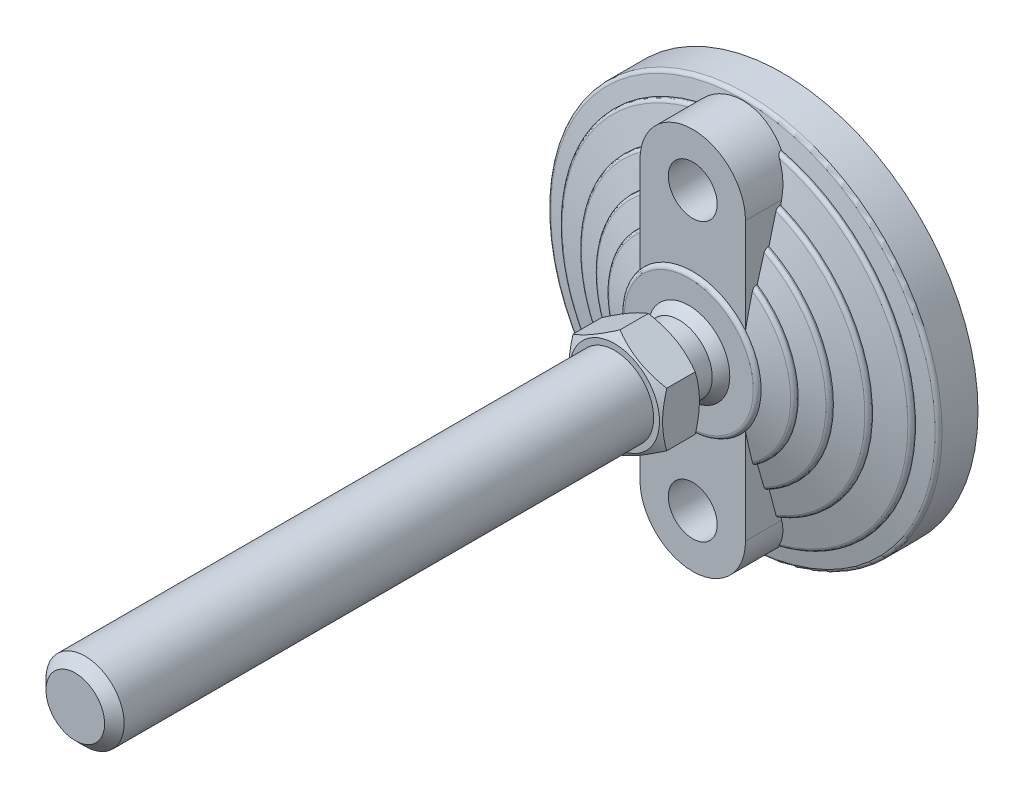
ISO-10303-21;
HEADER;
FILE_DESCRIPTION(('STEP AP214'),'2;1');
FILE_NAME('part.step','',(''),(''),'','','');
FILE_SCHEMA(('AUTOMOTIVE_DESIGN { 1 0 10303 214 1 1 1 1 }'));
ENDSEC;
DATA;
#1=APPLICATION_CONTEXT('core data for automotive mechanical design processes');
#2=APPLICATION_PROTOCOL_DEFINITION('international standard','automotive_design',2000,#1);
#3=PRODUCT_CONTEXT('',#1,'mechanical');
#4=PRODUCT('Part','Part','',(#3));
#5=PRODUCT_RELATED_PRODUCT_CATEGORY('part','',(#4));
#6=PRODUCT_DEFINITION_FORMATION('','',#4);
#7=PRODUCT_DEFINITION_CONTEXT('part definition',#1,'design');
#8=PRODUCT_DEFINITION('design','',#6,#7);
#9=PRODUCT_DEFINITION_SHAPE('','',#8);
#10=(LENGTH_UNIT() NAMED_UNIT(*) SI_UNIT(.MILLI.,.METRE.));
#11=(NAMED_UNIT(*) PLANE_ANGLE_UNIT() SI_UNIT($,.RADIAN.));
#12=(NAMED_UNIT(*) SI_UNIT($,.STERADIAN.) SOLID_ANGLE_UNIT());
#13=UNCERTAINTY_MEASURE_WITH_UNIT(LENGTH_MEASURE(1.E-05),#10,'distance_accuracy_value','');
#14=(GEOMETRIC_REPRESENTATION_CONTEXT(3) GLOBAL_UNCERTAINTY_ASSIGNED_CONTEXT((#13)) GLOBAL_UNIT_ASSIGNED_CONTEXT((#10,
#11,#12)) REPRESENTATION_CONTEXT('',''));
#15=CARTESIAN_POINT('',(0.,0.,0.));
#16=DIRECTION('',(0.,0.,1.));
#17=DIRECTION('',(1.,0.,0.));
#18=AXIS2_PLACEMENT_3D('',#15,#16,#17);
#19=CARTESIAN_POINT('',(-12.,14.022683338,33.));
#20=DIRECTION('',(0.,0.,1.));
#21=DIRECTION('',(0.,-1.,0.));
#22=AXIS2_PLACEMENT_3D('',#19,#20,#21);
#23=PLANE('',#22);
#24=CARTESIAN_POINT('',(0.,0.,33.));
#25=DIRECTION('',(0.,0.,-1.));
#26=DIRECTION('',(0.,1.,0.));
#27=AXIS2_PLACEMENT_3D('',#24,#25,#26);
#28=CIRCLE('',#27,11.5);
#29=CARTESIAN_POINT('',(0.,11.5,33.));
#30=VERTEX_POINT('',#29);
#31=EDGE_CURVE('E260',#30,#30,#28,.T.);
#32=ORIENTED_EDGE('',*,*,#31,.T.);
#33=EDGE_LOOP('',(#32));
#34=FACE_BOUND('',#33,.T.);
#35=CARTESIAN_POINT('',(0.,0.,33.));
#36=DIRECTION('',(0.,0.,-1.));
#37=DIRECTION('',(0.,1.,0.));
#38=AXIS2_PLACEMENT_3D('',#35,#36,#37);
#39=CIRCLE('',#38,8.5);
#40=CARTESIAN_POINT('',(0.,8.5,33.));
#41=VERTEX_POINT('',#40);
#42=EDGE_CURVE('E274',#41,#41,#39,.T.);
#43=ORIENTED_EDGE('',*,*,#42,.F.);
#44=EDGE_LOOP('',(#43));
#45=FACE_BOUND('',#44,.T.);
#46=ADVANCED_FACE('F14',(#34,#45),#23,.F.);
#47=CARTESIAN_POINT('',(0.,0.,33.));
#48=DIRECTION('',(0.,0.,-1.));
#49=DIRECTION('',(0.,1.,0.));
#50=AXIS2_PLACEMENT_3D('',#47,#48,#49);
#51=CYLINDRICAL_SURFACE('',#50,8.5);
#52=CARTESIAN_POINT('',(0.,0.,26.5));
#53=DIRECTION('',(0.,0.,-1.));
#54=DIRECTION('',(0.,1.,0.));
#55=AXIS2_PLACEMENT_3D('',#52,#53,#54);
#56=CIRCLE('',#55,8.5);
#57=CARTESIAN_POINT('',(0.,8.5,26.5));
#58=VERTEX_POINT('',#57);
#59=EDGE_CURVE('E1493',#58,#58,#56,.F.);
#60=ORIENTED_EDGE('',*,*,#59,.T.);
#61=EDGE_LOOP('',(#60));
#62=FACE_BOUND('',#61,.T.);
#63=ORIENTED_EDGE('',*,*,#42,.T.);
#64=EDGE_LOOP('',(#63));
#65=FACE_BOUND('',#64,.T.);
#66=ADVANCED_FACE('F928',(#62,#65),#51,.T.);
#67=CARTESIAN_POINT('',(-8.631599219,8.622532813,26.5));
#68=DIRECTION('',(0.,0.,1.));
#69=DIRECTION('',(0.,-1.,0.));
#70=AXIS2_PLACEMENT_3D('',#67,#68,#69);
#71=PLANE('',#70);
#72=CARTESIAN_POINT('',(0.,0.,26.5));
#73=DIRECTION('',(0.,0.,-1.));
#74=DIRECTION('',(0.,1.,0.));
#75=AXIS2_PLACEMENT_3D('',#72,#73,#74);
#76=CIRCLE('',#75,8.49107182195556);
#77=CARTESIAN_POINT('',(0.,8.49107182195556,26.5));
#78=VERTEX_POINT('',#77);
#79=EDGE_CURVE('E1489',#78,#78,#76,.T.);
#80=ORIENTED_EDGE('',*,*,#79,.F.);
#81=EDGE_LOOP('',(#80));
#82=FACE_BOUND('',#81,.T.);
#83=ORIENTED_EDGE('',*,*,#59,.F.);
#84=EDGE_LOOP('',(#83));
#85=FACE_BOUND('',#84,.T.);
#86=ADVANCED_FACE('F938',(#82,#85),#71,.F.);
#87=CARTESIAN_POINT('',(0.,0.,17.670266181));
#88=DIRECTION('',(0.,0.,-1.));
#89=DIRECTION('',(1.,0.,0.));
#90=AXIS2_PLACEMENT_3D('',#87,#88,#89);
#91=SPHERICAL_SURFACE('',#90,12.25);
#92=CARTESIAN_POINT('',(0.,0.,24.));
#93=DIRECTION('',(0.,0.,-1.));
#94=DIRECTION('',(0.,1.,0.));
#95=AXIS2_PLACEMENT_3D('',#92,#93,#94);
#96=CIRCLE('',#95,10.4879440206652);
#97=CARTESIAN_POINT('',(0.,10.4879440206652,24.));
#98=VERTEX_POINT('',#97);
#99=EDGE_CURVE('E1484',#98,#98,#96,.F.);
#100=ORIENTED_EDGE('',*,*,#99,.T.);
#101=EDGE_LOOP('',(#100));
#102=FACE_BOUND('',#101,.T.);
#103=ORIENTED_EDGE('',*,*,#79,.T.);
#104=EDGE_LOOP('',(#103));
#105=FACE_BOUND('',#104,.T.);
#106=ADVANCED_FACE('F948',(#102,#105),#91,.T.);
#107=CARTESIAN_POINT('',(0.,-35.5,0.));
#108=DIRECTION('',(0.,0.,1.));
#109=DIRECTION('',(0.,-1.,0.));
#110=AXIS2_PLACEMENT_3D('',#107,#108,#109);
#111=CYLINDRICAL_SURFACE('',#110,6.25);
#112=CARTESIAN_POINT('',(0.,-35.5,23.));
#113=DIRECTION('',(0.,0.,1.));
#114=DIRECTION('',(0.,-1.,0.));
#115=AXIS2_PLACEMENT_3D('',#112,#113,#114);
#116=CIRCLE('',#115,6.25);
#117=CARTESIAN_POINT('',(0.,-41.75,23.));
#118=VERTEX_POINT('',#117);
#119=EDGE_CURVE('E1153',#118,#118,#116,.F.);
#120=ORIENTED_EDGE('',*,*,#119,.F.);
#121=EDGE_LOOP('',(#120));
#122=FACE_BOUND('',#121,.T.);
#123=CARTESIAN_POINT('',(0.,-35.5,0.));
#124=DIRECTION('',(0.,0.,1.));
#125=DIRECTION('',(0.,-1.,0.));
#126=AXIS2_PLACEMENT_3D('',#123,#124,#125);
#127=CIRCLE('',#126,6.25);
#128=CARTESIAN_POINT('',(0.,-41.75,0.));
#129=VERTEX_POINT('',#128);
#130=EDGE_CURVE('E1482',#129,#129,#127,.F.);
#131=ORIENTED_EDGE('',*,*,#130,.T.);
#132=EDGE_LOOP('',(#131));
#133=FACE_BOUND('',#132,.T.);
#134=ADVANCED_FACE('F962',(#122,#133),#111,.F.);
#135=CARTESIAN_POINT('',(-16.755457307,-16.698,24.));
#136=DIRECTION('',(0.,0.,-1.));
#137=DIRECTION('',(0.,1.,0.));
#138=AXIS2_PLACEMENT_3D('',#135,#136,#137);
#139=PLANE('',#138);
#140=ORIENTED_EDGE('',*,*,#99,.F.);
#141=EDGE_LOOP('',(#140));
#142=FACE_BOUND('',#141,.T.);
#143=CARTESIAN_POINT('',(0.,0.,24.));
#144=DIRECTION('',(0.,0.,-1.));
#145=DIRECTION('',(0.,1.,0.));
#146=AXIS2_PLACEMENT_3D('',#143,#144,#145);
#147=CIRCLE('',#146,16.5);
#148=CARTESIAN_POINT('',(0.,16.5,24.));
#149=VERTEX_POINT('',#148);
#150=EDGE_CURVE('E1150',#149,#149,#147,.T.);
#151=ORIENTED_EDGE('',*,*,#150,.F.);
#152=EDGE_LOOP('',(#151));
#153=FACE_BOUND('',#152,.T.);
#154=ADVANCED_FACE('F956',(#142,#153),#139,.F.);
#155=CARTESIAN_POINT('',(-50.774113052,50.6,0.));
#156=DIRECTION('',(0.,0.,1.));
#157=DIRECTION('',(0.,-1.,0.));
#158=AXIS2_PLACEMENT_3D('',#155,#156,#157);
#159=PLANE('',#158);
#160=CARTESIAN_POINT('',(0.,35.5,0.));
#161=DIRECTION('',(0.,0.,1.));
#162=DIRECTION('',(0.,-1.,0.));
#163=AXIS2_PLACEMENT_3D('',#160,#161,#162);
#164=CIRCLE('',#163,6.25);
#165=CARTESIAN_POINT('',(0.,29.25,0.));
#166=VERTEX_POINT('',#165);
#167=EDGE_CURVE('E520',#166,#166,#164,.T.);
#168=ORIENTED_EDGE('',*,*,#167,.T.);
#169=EDGE_LOOP('',(#168));
#170=FACE_BOUND('',#169,.T.);
#171=ORIENTED_EDGE('',*,*,#130,.F.);
#172=EDGE_LOOP('',(#171));
#173=FACE_BOUND('',#172,.T.);
#174=CARTESIAN_POINT('',(0.,0.,0.));
#175=DIRECTION('',(0.,0.,-1.));
#176=DIRECTION('',(1.,0.,0.));
#177=AXIS2_PLACEMENT_3D('',#174,#175,#176);
#178=CIRCLE('',#177,50.);
#179=CARTESIAN_POINT('',(50.,0.,0.));
#180=VERTEX_POINT('',#179);
#181=EDGE_CURVE('E538',#180,#180,#178,.F.);
#182=ORIENTED_EDGE('',*,*,#181,.F.);
#183=EDGE_LOOP('',(#182));
#184=FACE_BOUND('',#183,.T.);
#185=ADVANCED_FACE('F961',(#170,#173,#184),#159,.F.);
#186=CARTESIAN_POINT('',(0.,0.,23.));
#187=DIRECTION('',(0.,0.,-1.));
#188=DIRECTION('',(0.,1.,0.));
#189=AXIS2_PLACEMENT_3D('',#186,#187,#188);
#190=CONICAL_SURFACE('',#189,17.5,1.27229739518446);
#191=CARTESIAN_POINT('',(0.,0.,23.));
#192=DIRECTION('',(0.,0.,1.));
#193=DIRECTION('',(0.,-1.,0.));
#194=AXIS2_PLACEMENT_3D('',#191,#192,#193);
#195=CIRCLE('',#194,17.5);
#196=CARTESIAN_POINT('',(13.5000000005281,-11.1355287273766,22.9999999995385));
#197=VERTEX_POINT('',#196);
#198=CARTESIAN_POINT('',(13.5000000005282,11.1355287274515,22.9999999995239));
#199=VERTEX_POINT('',#198);
#200=EDGE_CURVE('E517',#197,#199,#195,.T.);
#201=ORIENTED_EDGE('',*,*,#200,.F.);
#202=CARTESIAN_POINT('',(13.5,-18.9832672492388,21.2172043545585));
#203=CARTESIAN_POINT('',(13.5,-18.6579649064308,21.2987714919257));
#204=CARTESIAN_POINT('',(13.5,-18.3324976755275,21.3796813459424));
#205=CARTESIAN_POINT('',(13.5,-17.681197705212,21.5400241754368));
#206=CARTESIAN_POINT('',(13.5,-17.3553649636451,21.6194571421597));
#207=CARTESIAN_POINT('',(13.5,-16.3773825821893,21.8552688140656));
#208=CARTESIAN_POINT('',(13.5,-15.724637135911,22.0091884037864));
#209=CARTESIAN_POINT('',(13.5,-14.4172126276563,22.3088363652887));
#210=CARTESIAN_POINT('',(13.5,-13.7625334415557,22.454564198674));
#211=CARTESIAN_POINT('',(13.5,-12.7787974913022,22.6654071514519));
#212=CARTESIAN_POINT('',(13.5,-12.4505717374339,22.7344021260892));
#213=CARTESIAN_POINT('',(13.5,-11.793514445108,22.8694734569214));
#214=CARTESIAN_POINT('',(13.5,-11.4646828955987,22.9355497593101));
#215=CARTESIAN_POINT('',(13.5,-11.1355287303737,22.9999999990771));
#216=B_SPLINE_CURVE_WITH_KNOTS('',3,(#202,#203,#204,#205,#206,#207,#208,#209,#210,#211,#212,
#213,#214,#215),.UNSPECIFIED.,.F.,.F.,(4,2,2,2,2,2,4),(0.,1.00611699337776,2.01223994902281,
4.02414047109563,6.03617306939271,7.04235800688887,8.0485614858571),.UNSPECIFIED.);
#217=CARTESIAN_POINT('',(13.5,-18.9832672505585,21.2172043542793));
#218=VERTEX_POINT('',#217);
#219=EDGE_CURVE('E1207',#218,#197,#216,.T.);
#220=ORIENTED_EDGE('',*,*,#219,.F.);
#221=CARTESIAN_POINT('',(3.16437848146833E-10,0.,21.217204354));
#222=DIRECTION('',(0.,0.,-1.));
#223=DIRECTION('',(0.,1.,0.));
#224=AXIS2_PLACEMENT_3D('',#221,#222,#223);
#225=CIRCLE('',#224,23.2940858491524);
#226=CARTESIAN_POINT('',(13.5,18.9832672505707,21.2172043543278));
#227=VERTEX_POINT('',#226);
#228=EDGE_CURVE('E549',#227,#218,#225,.T.);
#229=ORIENTED_EDGE('',*,*,#228,.F.);
#230=CARTESIAN_POINT('',(13.5,11.1355287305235,22.9999999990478));
#231=CARTESIAN_POINT('',(13.5,11.4646828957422,22.9355497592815));
#232=CARTESIAN_POINT('',(13.5,11.7935144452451,22.8694734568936));
#233=CARTESIAN_POINT('',(13.5,12.4505717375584,22.7344021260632));
#234=CARTESIAN_POINT('',(13.5,12.7787974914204,22.6654071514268));
#235=CARTESIAN_POINT('',(13.5,13.7625334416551,22.4545641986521));
#236=CARTESIAN_POINT('',(13.5,14.4172126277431,22.3088363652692));
#237=CARTESIAN_POINT('',(13.5,15.724637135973,22.0091884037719));
#238=CARTESIAN_POINT('',(13.5,16.3773825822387,21.8552688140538));
#239=CARTESIAN_POINT('',(13.5,17.355364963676,21.6194571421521));
#240=CARTESIAN_POINT('',(13.5,17.6811977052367,21.5400241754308));
#241=CARTESIAN_POINT('',(13.5,18.3324976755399,21.3796813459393));
#242=CARTESIAN_POINT('',(13.5,18.657964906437,21.2987714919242));
#243=CARTESIAN_POINT('',(13.5,18.9832672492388,21.2172043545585));
#244=B_SPLINE_CURVE_WITH_KNOTS('',3,(#230,#231,#232,#233,#234,#235,#236,#237,#238,#239,#240,
#241,#242,#243),.UNSPECIFIED.,.F.,.F.,(4,2,2,2,2,2,4),(0.,1.00620347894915,2.01238841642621,
4.02442101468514,6.03632153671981,7.04244449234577,8.04856148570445),.UNSPECIFIED.);
#245=EDGE_CURVE('E1137',#199,#227,#244,.T.);
#246=ORIENTED_EDGE('',*,*,#245,.F.);
#247=EDGE_LOOP('',(#201,#220,#229,#246));
#248=FACE_BOUND('',#247,.T.);
#249=ADVANCED_FACE('F974',(#248),#190,.T.);
#250=CARTESIAN_POINT('',(13.267303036,19.999466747,20.261425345));
#251=CARTESIAN_POINT('',(29.097194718,9.49818825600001,20.261425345));
#252=CARTESIAN_POINT('',(29.097194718,-9.49818825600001,20.261425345));
#253=CARTESIAN_POINT('',(13.267303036,-19.999466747,20.261425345));
#254=CARTESIAN_POINT('',(13.267303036,19.999466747,20.716888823));
#255=CARTESIAN_POINT('',(29.097194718,9.498188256,20.716888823));
#256=CARTESIAN_POINT('',(29.097194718,-9.498188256,20.716888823));
#257=CARTESIAN_POINT('',(13.267303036,-19.999466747,20.716888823));
#258=CARTESIAN_POINT('',(13.117718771,19.773979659,21.083258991));
#259=CARTESIAN_POINT('',(28.769133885,9.39109945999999,21.083258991));
#260=CARTESIAN_POINT('',(28.769133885,-9.39109945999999,21.083258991));
#261=CARTESIAN_POINT('',(13.117718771,-19.773979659,21.083258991));
#262=CARTESIAN_POINT('',(12.877070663,19.411220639,21.217204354));
#263=CARTESIAN_POINT('',(28.241356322,9.218817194,21.217204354));
#264=CARTESIAN_POINT('',(28.241356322,-9.218817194,21.217204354));
#265=CARTESIAN_POINT('',(12.877070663,-19.411220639,21.217204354));
#266=(BOUNDED_SURFACE() B_SPLINE_SURFACE(3,3,((#250,#251,#252,#253),(#254,#255,#256,#257),(#258,
#259,#260,#261),(#262,#263,#264,#265)),.UNSPECIFIED.,.F.,.F.,
.F.) B_SPLINE_SURFACE_WITH_KNOTS((4,4),(4,4),(0.,1.),(0.,1.),
.UNSPECIFIED.) GEOMETRIC_REPRESENTATION_ITEM() RATIONAL_B_SPLINE_SURFACE(((1.,0.701869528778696,
0.701869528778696,1.),(0.86959318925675,0.610340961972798,0.610340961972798,0.86959318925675),
(0.86959318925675,0.610340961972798,0.610340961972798,0.86959318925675),(1.,0.701869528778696,
0.701869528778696,1.))) REPRESENTATION_ITEM('') SURFACE());
#267=CARTESIAN_POINT('',(13.5,-19.8431348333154,20.2614253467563));
#268=CARTESIAN_POINT('',(13.5,-19.8431370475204,20.286055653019));
#269=CARTESIAN_POINT('',(13.5,-19.8420333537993,20.310672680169));
#270=CARTESIAN_POINT('',(13.5,-19.8376465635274,20.3597018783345));
#271=CARTESIAN_POINT('',(13.5,-19.834364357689,20.3841141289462));
#272=CARTESIAN_POINT('',(13.5,-19.8213486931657,20.4565201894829));
#273=CARTESIAN_POINT('',(13.5,-19.8084453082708,20.503978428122));
#274=CARTESIAN_POINT('',(13.5,-19.7748969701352,20.5959548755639));
#275=CARTESIAN_POINT('',(13.5,-19.7542611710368,20.6404764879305));
#276=CARTESIAN_POINT('',(13.5,-19.7062220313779,20.7257350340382));
#277=CARTESIAN_POINT('',(13.5,-19.678812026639,20.7664681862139));
#278=CARTESIAN_POINT('',(13.5,-19.6164784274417,20.8458096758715));
#279=CARTESIAN_POINT('',(13.5,-19.5811980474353,20.8841360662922));
#280=CARTESIAN_POINT('',(13.5,-19.5055204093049,20.9553392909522));
#281=CARTESIAN_POINT('',(13.5,-19.4651202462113,20.9882130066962));
#282=CARTESIAN_POINT('',(13.5,-19.3733614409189,21.0532792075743));
#283=CARTESIAN_POINT('',(13.5,-19.3212935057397,21.084469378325));
#284=CARTESIAN_POINT('',(13.5,-19.2133323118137,21.1391750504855));
#285=CARTESIAN_POINT('',(13.5,-19.1574401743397,21.1626927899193));
#286=CARTESIAN_POINT('',(13.5,-19.06178190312,21.1957297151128));
#287=CARTESIAN_POINT('',(13.5,-19.0227191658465,21.207311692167));
#288=CARTESIAN_POINT('',(13.5,-18.9832672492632,21.2172043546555));
#289=B_SPLINE_CURVE_WITH_KNOTS('',3,(#267,#268,#269,#270,#271,#272,#273,#274,#275,#276,#277,
#278,#279,#280,#281,#282,#283,#284,#285,#286,#287,#288),.UNSPECIFIED.,.F.,.F.,(4,2,2,2,2,2,2,2,
2,2,4),(0.,0.0738405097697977,0.147650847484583,0.294398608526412,0.440973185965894,
0.58769253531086,0.743377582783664,0.899151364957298,1.08055915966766,1.26191399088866,
1.38396482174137),.UNSPECIFIED.);
#290=CARTESIAN_POINT('',(13.5,-19.8431348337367,20.2614253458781));
#291=VERTEX_POINT('',#290);
#292=EDGE_CURVE('E1157',#291,#218,#289,.T.);
#293=CARTESIAN_POINT('',(0.,0.,20.261425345));
#294=DIRECTION('',(0.,0.,-1.));
#295=DIRECTION('',(0.,1.,0.));
#296=AXIS2_PLACEMENT_3D('',#293,#294,#295);
#297=CIRCLE('',#296,24.);
#298=CARTESIAN_POINT('',(13.5,19.8431348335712,20.2614253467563));
#299=VERTEX_POINT('',#298);
#300=EDGE_CURVE('E547',#299,#291,#297,.T.);
#301=CARTESIAN_POINT('',(13.5,18.9832672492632,21.2172043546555));
#302=CARTESIAN_POINT('',(13.5,19.0245269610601,21.2068474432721));
#303=CARTESIAN_POINT('',(13.5,19.0653049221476,21.1946763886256));
#304=CARTESIAN_POINT('',(13.5,19.1456358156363,21.1665827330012));
#305=CARTESIAN_POINT('',(13.5,19.1851861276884,21.1506526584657));
#306=CARTESIAN_POINT('',(13.5,19.3016874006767,21.0969581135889));
#307=CARTESIAN_POINT('',(13.5,19.3761277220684,21.0533765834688));
#308=CARTESIAN_POINT('',(13.5,19.4913457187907,20.9675664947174));
#309=CARTESIAN_POINT('',(13.5,19.5352290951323,20.9294496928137));
#310=CARTESIAN_POINT('',(13.5,19.6161219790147,20.8466003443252));
#311=CARTESIAN_POINT('',(13.5,19.6531483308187,20.8018845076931));
#312=CARTESIAN_POINT('',(13.5,19.7189344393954,20.7060840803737));
#313=CARTESIAN_POINT('',(13.5,19.7476154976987,20.6549449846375));
#314=CARTESIAN_POINT('',(13.5,19.7944064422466,20.5480322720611));
#315=CARTESIAN_POINT('',(13.5,19.812533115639,20.4922661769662));
#316=CARTESIAN_POINT('',(13.5,19.8308153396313,20.4067306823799));
#317=CARTESIAN_POINT('',(13.5,19.8354249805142,20.3778585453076));
#318=CARTESIAN_POINT('',(13.5,19.8415861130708,20.3198066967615));
#319=CARTESIAN_POINT('',(13.5,19.8431393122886,20.2906271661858));
#320=CARTESIAN_POINT('',(13.5,19.8431348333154,20.2614253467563));
#321=B_SPLINE_CURVE_WITH_KNOTS('',3,(#301,#302,#303,#304,#305,#306,#307,#308,#309,#310,#311,
#312,#313,#314,#315,#316,#317,#318,#319,#320),.UNSPECIFIED.,.F.,.F.,(4,2,2,2,2,2,2,2,2,4),(0.,
0.127516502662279,0.255288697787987,0.511930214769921,0.685657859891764,0.858952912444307,
1.03383282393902,1.20843381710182,1.29600438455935,1.38352601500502),.UNSPECIFIED.);
#322=EDGE_CURVE('E1140',#227,#299,#321,.T.);
#323=ORIENTED_EDGE('',*,*,#228,.T.);
#324=ORIENTED_EDGE('',*,*,#292,.F.);
#325=ORIENTED_EDGE('',*,*,#300,.F.);
#326=ORIENTED_EDGE('',*,*,#322,.F.);
#327=EDGE_LOOP('',(#323,#324,#325,#326));
#328=FACE_BOUND('',#327,.T.);
#329=ADVANCED_FACE('F1060',(#328),#266,.T.);
#330=CARTESIAN_POINT('',(0.,0.,20.261425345));
#331=DIRECTION('',(0.,0.,-1.));
#332=DIRECTION('',(0.,1.,0.));
#333=AXIS2_PLACEMENT_3D('',#330,#331,#332);
#334=CYLINDRICAL_SURFACE('',#333,24.);
#335=CARTESIAN_POINT('',(0.,0.,20.));
#336=DIRECTION('',(0.,0.,-1.));
#337=DIRECTION('',(0.,1.,0.));
#338=AXIS2_PLACEMENT_3D('',#335,#336,#337);
#339=CIRCLE('',#338,24.);
#340=CARTESIAN_POINT('',(13.5,19.8431348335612,20.0000000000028));
#341=VERTEX_POINT('',#340);
#342=CARTESIAN_POINT('',(13.5,-19.8431348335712,19.9999999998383));
#343=VERTEX_POINT('',#342);
#344=EDGE_CURVE('E545',#341,#343,#339,.T.);
#345=ORIENTED_EDGE('',*,*,#344,.F.);
#346=DIRECTION('',(0.,0.,-1.));
#347=VECTOR('',#346,1.);
#348=CARTESIAN_POINT('',(13.5,19.8431348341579,18.349732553));
#349=LINE('',#348,#347);
#350=EDGE_CURVE('E1260',#299,#341,#349,.T.);
#351=ORIENTED_EDGE('',*,*,#350,.F.);
#352=ORIENTED_EDGE('',*,*,#300,.T.);
#353=DIRECTION('',(0.,0.,1.));
#354=VECTOR('',#353,1.);
#355=CARTESIAN_POINT('',(13.5,-19.8431348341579,18.349732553));
#356=LINE('',#355,#354);
#357=EDGE_CURVE('E1164',#343,#291,#356,.T.);
#358=ORIENTED_EDGE('',*,*,#357,.F.);
#359=EDGE_LOOP('',(#345,#351,#352,#358));
#360=FACE_BOUND('',#359,.T.);
#361=ADVANCED_FACE('F1024',(#360),#334,.T.);
#362=CARTESIAN_POINT('',(0.,0.,20.));
#363=DIRECTION('',(0.,0.,-1.));
#364=DIRECTION('',(1.,0.,0.));
#365=AXIS2_PLACEMENT_3D('',#362,#363,#364);
#366=CONICAL_SURFACE('',#365,24.,1.24904577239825);
#367=ORIENTED_EDGE('',*,*,#344,.T.);
#368=CARTESIAN_POINT('',(13.4999999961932,-26.0228978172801,18.2279240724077));
#369=CARTESIAN_POINT('',(13.4999999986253,-25.5091656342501,18.379921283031));
#370=CARTESIAN_POINT('',(13.4999999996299,-24.9951778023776,18.531058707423));
#371=CARTESIAN_POINT('',(13.5000000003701,-23.9666187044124,18.8312926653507));
#372=CARTESIAN_POINT('',(13.5000000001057,-23.4520474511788,18.9803892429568));
#373=CARTESIAN_POINT('',(13.4999999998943,-22.4222240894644,19.2762276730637));
#374=CARTESIAN_POINT('',(13.4999999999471,-21.9069719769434,19.4229695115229));
#375=CARTESIAN_POINT('',(13.5000000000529,-20.8756730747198,19.7136753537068));
#376=CARTESIAN_POINT('',(13.5000000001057,-20.3596262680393,19.8576392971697));
#377=CARTESIAN_POINT('',(13.5,-19.8431348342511,19.9999999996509));
#378=B_SPLINE_CURVE_WITH_KNOTS('',3,(#368,#369,#370,#371,#372,#373,#374,#375,#376,#377),
.UNSPECIFIED.,.F.,.F.,(4,2,2,2,4),(0.,1.60723934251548,3.21444392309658,4.82165808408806,
6.4289070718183),.UNSPECIFIED.);
#379=CARTESIAN_POINT('',(13.5,-26.0228978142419,18.2279240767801));
#380=VERTEX_POINT('',#379);
#381=EDGE_CURVE('E1165',#380,#343,#378,.T.);
#382=ORIENTED_EDGE('',*,*,#381,.F.);
#383=CARTESIAN_POINT('',(-5.51340223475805E-10,0.,18.227924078));
#384=DIRECTION('',(0.,0.,-1.));
#385=DIRECTION('',(0.,1.,0.));
#386=AXIS2_PLACEMENT_3D('',#383,#384,#385);
#387=CIRCLE('',#386,29.3162277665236);
#388=CARTESIAN_POINT('',(13.5,26.0228978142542,18.2279240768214));
#389=VERTEX_POINT('',#388);
#390=EDGE_CURVE('E544',#389,#380,#387,.T.);
#391=ORIENTED_EDGE('',*,*,#390,.F.);
#392=CARTESIAN_POINT('',(13.500000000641,19.8431348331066,20.0000000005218));
#393=CARTESIAN_POINT('',(13.5000000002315,20.3596262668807,19.8576392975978));
#394=CARTESIAN_POINT('',(13.5000000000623,20.8756730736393,19.7136753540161));
#395=CARTESIAN_POINT('',(13.4999999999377,21.9069719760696,19.4229695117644));
#396=CARTESIAN_POINT('',(13.4999999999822,22.4222240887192,19.2762276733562));
#397=CARTESIAN_POINT('',(13.5000000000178,23.4520474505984,18.9803892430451));
#398=CARTESIAN_POINT('',(13.5000000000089,23.9666187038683,18.8312926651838));
#399=CARTESIAN_POINT('',(13.4999999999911,24.9951778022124,18.5310587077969));
#400=CARTESIAN_POINT('',(13.4999999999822,25.5091656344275,18.3799212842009));
#401=CARTESIAN_POINT('',(13.5,26.0228978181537,18.2279240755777));
#402=B_SPLINE_CURVE_WITH_KNOTS('',3,(#392,#393,#394,#395,#396,#397,#398,#399,#400,#401),
.UNSPECIFIED.,.F.,.F.,(4,2,2,2,4),(0.,1.60724898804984,3.2144631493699,4.82166773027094,
6.42890707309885),.UNSPECIFIED.);
#403=EDGE_CURVE('E1254',#341,#389,#402,.T.);
#404=ORIENTED_EDGE('',*,*,#403,.F.);
#405=EDGE_LOOP('',(#367,#382,#391,#404));
#406=FACE_BOUND('',#405,.T.);
#407=ADVANCED_FACE('F1018',(#406),#366,.T.);
#408=CARTESIAN_POINT('',(13.143890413,26.967353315,17.27924078));
#409=CARTESIAN_POINT('',(38.983891,14.372934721,17.27924078));
#410=CARTESIAN_POINT('',(38.983891,-14.372934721,17.27924078));
#411=CARTESIAN_POINT('',(13.143890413,-26.967353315,17.27924078));
#412=CARTESIAN_POINT('',(13.143890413,26.967353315,17.725161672));
#413=CARTESIAN_POINT('',(38.983891,14.372934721,17.725161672));
#414=CARTESIAN_POINT('',(38.983891,-14.372934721,17.725161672));
#415=CARTESIAN_POINT('',(13.143890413,-26.967353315,17.725161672));
#416=CARTESIAN_POINT('',(13.029654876,26.732975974,18.086911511));
#417=CARTESIAN_POINT('',(38.645076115,14.248017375,18.086911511));
#418=CARTESIAN_POINT('',(38.645076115,-14.248017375,18.086911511));
#419=CARTESIAN_POINT('',(13.029654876,-26.732975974,18.086911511));
#420=CARTESIAN_POINT('',(12.844309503,26.352702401,18.227924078));
#421=CARTESIAN_POINT('',(38.095354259,14.045340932,18.227924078));
#422=CARTESIAN_POINT('',(38.095354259,-14.045340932,18.227924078));
#423=CARTESIAN_POINT('',(12.844309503,-26.352702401,18.227924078));
#424=(BOUNDED_SURFACE() B_SPLINE_SURFACE(3,3,((#408,#409,#410,#411),(#412,#413,#414,#415),(#416,
#417,#418,#419),(#420,#421,#422,#423)),.UNSPECIFIED.,.F.,.F.,
.F.) B_SPLINE_SURFACE_WITH_KNOTS((4,4),(4,4),(0.,1.),(0.,1.),
.UNSPECIFIED.) GEOMETRIC_REPRESENTATION_ITEM() RATIONAL_B_SPLINE_SURFACE(((1.,0.625419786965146,
0.625419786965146,1.),(0.874161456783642,0.546717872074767,0.546717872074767,0.874161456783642),
(0.874161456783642,0.546717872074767,0.546717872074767,0.874161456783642),(1.,0.625419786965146,
0.625419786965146,1.))) REPRESENTATION_ITEM('') SURFACE());
#425=CARTESIAN_POINT('',(13.5,-26.7908566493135,17.2792407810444));
#426=CARTESIAN_POINT('',(13.5,-26.7908579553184,17.3051907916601));
#427=CARTESIAN_POINT('',(13.5,-26.7897247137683,17.3311275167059));
#428=CARTESIAN_POINT('',(13.5,-26.7852140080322,17.3827974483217));
#429=CARTESIAN_POINT('',(13.5,-26.7818372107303,17.4085307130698));
#430=CARTESIAN_POINT('',(13.5,-26.7684139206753,17.4849772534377));
#431=CARTESIAN_POINT('',(13.5,-26.7550740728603,17.5351491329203));
#432=CARTESIAN_POINT('',(13.5,-26.720210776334,17.6324862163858));
#433=CARTESIAN_POINT('',(13.5,-26.6986916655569,17.6796529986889));
#434=CARTESIAN_POINT('',(13.5,-26.6483480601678,17.7699105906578));
#435=CARTESIAN_POINT('',(13.5,-26.6195218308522,17.8130004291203));
#436=CARTESIAN_POINT('',(13.5,-26.5542840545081,17.8959059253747));
#437=CARTESIAN_POINT('',(13.5,-26.5176080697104,17.9355124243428));
#438=CARTESIAN_POINT('',(13.5,-26.4386436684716,18.0087234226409));
#439=CARTESIAN_POINT('',(13.5,-26.3963509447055,18.0423232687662));
#440=CARTESIAN_POINT('',(13.5,-26.3267001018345,18.0898793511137));
#441=CARTESIAN_POINT('',(13.5,-26.3008113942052,18.1060387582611));
#442=CARTESIAN_POINT('',(13.5,-26.2478537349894,18.1362297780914));
#443=CARTESIAN_POINT('',(13.5,-26.2207861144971,18.1502637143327));
#444=CARTESIAN_POINT('',(13.5,-26.1657188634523,18.1761515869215));
#445=CARTESIAN_POINT('',(13.5,-26.1377218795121,18.1880111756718));
#446=CARTESIAN_POINT('',(13.5,-26.0808891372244,18.2095853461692));
#447=CARTESIAN_POINT('',(13.5,-26.0520527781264,18.2192983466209));
#448=CARTESIAN_POINT('',(13.5,-26.0228978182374,18.2279240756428));
#449=B_SPLINE_CURVE_WITH_KNOTS('',3,(#425,#426,#427,#428,#429,#430,#431,#432,#433,#434,#435,
#436,#437,#438,#439,#440,#441,#442,#443,#444,#445,#446,#447,#448),.UNSPECIFIED.,.F.,.F.,(4,2,2,
2,2,2,2,2,2,2,2,4),(0.,0.0777993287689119,0.155575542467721,0.310500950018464,0.465344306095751,
0.620224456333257,0.781511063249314,0.942922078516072,1.0343924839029,1.12576216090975,
1.21689083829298,1.30808642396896),.UNSPECIFIED.);
#450=CARTESIAN_POINT('',(13.5,-26.7908566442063,17.2792407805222));
#451=VERTEX_POINT('',#450);
#452=EDGE_CURVE('E1188',#451,#380,#449,.T.);
#453=CARTESIAN_POINT('',(0.,0.,17.27924078));
#454=DIRECTION('',(0.,0.,-1.));
#455=DIRECTION('',(0.,1.,0.));
#456=AXIS2_PLACEMENT_3D('',#453,#454,#455);
#457=CIRCLE('',#456,30.);
#458=CARTESIAN_POINT('',(13.5,26.7908566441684,17.2792407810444));
#459=VERTEX_POINT('',#458);
#460=EDGE_CURVE('E542',#459,#451,#457,.T.);
#461=CARTESIAN_POINT('',(13.5,26.0228978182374,18.2279240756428));
#462=CARTESIAN_POINT('',(13.5,26.0845570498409,18.2097134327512));
#463=CARTESIAN_POINT('',(13.5,26.1448460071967,18.1865640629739));
#464=CARTESIAN_POINT('',(13.5,26.2611194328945,18.1305926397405));
#465=CARTESIAN_POINT('',(13.5,26.317080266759,18.0977216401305));
#466=CARTESIAN_POINT('',(13.5,26.4226214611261,18.0225926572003));
#467=CARTESIAN_POINT('',(13.5,26.4721821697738,17.9803067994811));
#468=CARTESIAN_POINT('',(13.5,26.562515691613,17.8873079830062));
#469=CARTESIAN_POINT('',(13.5,26.6033065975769,17.836612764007));
#470=CARTESIAN_POINT('',(13.5,26.6708532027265,17.7331354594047));
#471=CARTESIAN_POINT('',(13.5,26.6985518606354,17.6809691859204));
#472=CARTESIAN_POINT('',(13.5,26.7436193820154,17.5723560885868));
#473=CARTESIAN_POINT('',(13.5,26.7610021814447,17.5159151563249));
#474=CARTESIAN_POINT('',(13.5,26.7787549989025,17.4289072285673));
#475=CARTESIAN_POINT('',(13.5,26.783287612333,17.3991381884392));
#476=CARTESIAN_POINT('',(13.5,26.7893378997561,17.339332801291));
#477=CARTESIAN_POINT('',(13.5,26.7908592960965,17.3092968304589));
#478=CARTESIAN_POINT('',(13.5,26.7908566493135,17.2792407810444));
#479=B_SPLINE_CURVE_WITH_KNOTS('',3,(#461,#462,#463,#464,#465,#466,#467,#468,#469,#470,#471,
#472,#473,#474,#475,#476,#477,#478),.UNSPECIFIED.,.F.,.F.,(4,2,2,2,2,2,2,2,4),(0.,
0.192810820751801,0.38660942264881,0.580989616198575,0.774964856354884,0.951184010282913,
1.12716456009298,1.21736691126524,1.30745768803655),.UNSPECIFIED.);
#480=EDGE_CURVE('E1249',#389,#459,#479,.T.);
#481=ORIENTED_EDGE('',*,*,#390,.T.);
#482=ORIENTED_EDGE('',*,*,#452,.F.);
#483=ORIENTED_EDGE('',*,*,#460,.F.);
#484=ORIENTED_EDGE('',*,*,#480,.F.);
#485=EDGE_LOOP('',(#481,#482,#483,#484));
#486=FACE_BOUND('',#485,.T.);
#487=ADVANCED_FACE('F1023',(#486),#424,.T.);
#488=CARTESIAN_POINT('',(0.,0.,17.27924078));
#489=DIRECTION('',(0.,0.,-1.));
#490=DIRECTION('',(0.,1.,0.));
#491=AXIS2_PLACEMENT_3D('',#488,#489,#490);
#492=CYLINDRICAL_SURFACE('',#491,30.);
#493=CARTESIAN_POINT('',(0.,0.,17.));
#494=DIRECTION('',(0.,0.,-1.));
#495=DIRECTION('',(0.,1.,0.));
#496=AXIS2_PLACEMENT_3D('',#493,#494,#495);
#497=CIRCLE('',#496,30.);
#498=CARTESIAN_POINT('',(13.5,26.7908566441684,17.));
#499=VERTEX_POINT('',#498);
#500=CARTESIAN_POINT('',(13.5,-26.7908566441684,17.0000000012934));
#501=VERTEX_POINT('',#500);
#502=EDGE_CURVE('E540',#499,#501,#497,.T.);
#503=ORIENTED_EDGE('',*,*,#502,.F.);
#504=DIRECTION('',(0.,0.,-1.));
#505=VECTOR('',#504,1.);
#506=CARTESIAN_POINT('',(13.5,26.7908566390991,18.349732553));
#507=LINE('',#506,#505);
#508=EDGE_CURVE('E1275',#459,#499,#507,.T.);
#509=ORIENTED_EDGE('',*,*,#508,.F.);
#510=ORIENTED_EDGE('',*,*,#460,.T.);
#511=DIRECTION('',(0.,0.,1.));
#512=VECTOR('',#511,1.);
#513=CARTESIAN_POINT('',(13.5,-26.7908566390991,18.349732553));
#514=LINE('',#513,#512);
#515=EDGE_CURVE('E1470',#501,#451,#514,.T.);
#516=ORIENTED_EDGE('',*,*,#515,.F.);
#517=EDGE_LOOP('',(#503,#509,#510,#516));
#518=FACE_BOUND('',#517,.T.);
#519=ADVANCED_FACE('F1036',(#518),#492,.T.);
#520=CARTESIAN_POINT('',(0.,0.,17.));
#521=DIRECTION('',(0.,0.,-1.));
#522=DIRECTION('',(0.,1.,0.));
#523=AXIS2_PLACEMENT_3D('',#520,#521,#522);
#524=CONICAL_SURFACE('',#523,30.,1.29249666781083);
#525=ORIENTED_EDGE('',*,*,#502,.T.);
#526=CARTESIAN_POINT('',(13.5,-33.6690569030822,15.2072225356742));
#527=CARTESIAN_POINT('',(13.5,-33.0965095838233,15.3590521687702));
#528=CARTESIAN_POINT('',(13.5,-32.5238314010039,15.5103895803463));
#529=CARTESIAN_POINT('',(13.5,-31.3781752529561,15.8119124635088));
#530=CARTESIAN_POINT('',(13.5,-30.8051972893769,15.9620979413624));
#531=CARTESIAN_POINT('',(13.5,-29.6588964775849,16.261151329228));
#532=CARTESIAN_POINT('',(13.5,-29.0855736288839,16.4100192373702));
#533=CARTESIAN_POINT('',(13.5,-27.9385277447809,16.7062178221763));
#534=CARTESIAN_POINT('',(13.5,-27.3648047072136,16.8535484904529));
#535=CARTESIAN_POINT('',(13.5,-26.7908566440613,17.0000000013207));
#536=B_SPLINE_CURVE_WITH_KNOTS('',3,(#526,#527,#528,#529,#530,#531,#532,#533,#534,#535),
.UNSPECIFIED.,.F.,.F.,(4,2,2,2,4),(0.,1.77701009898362,3.55401052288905,5.33101346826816,
7.10802610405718),.UNSPECIFIED.);
#537=CARTESIAN_POINT('',(13.5,-33.6690569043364,15.2072225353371));
#538=VERTEX_POINT('',#537);
#539=EDGE_CURVE('E1194',#538,#501,#536,.T.);
#540=ORIENTED_EDGE('',*,*,#539,.F.);
#541=CARTESIAN_POINT('',(3.08438170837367E-10,0.,15.207222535));
#542=DIRECTION('',(0.,0.,-1.));
#543=DIRECTION('',(1.,0.,0.));
#544=AXIS2_PLACEMENT_3D('',#541,#542,#543);
#545=CIRCLE('',#544,36.2747211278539);
#546=CARTESIAN_POINT('',(13.5,33.6690569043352,15.2072225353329));
#547=VERTEX_POINT('',#546);
#548=EDGE_CURVE('E539',#547,#538,#545,.T.);
#549=ORIENTED_EDGE('',*,*,#548,.F.);
#550=CARTESIAN_POINT('',(13.5,26.7908566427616,17.0000000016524));
#551=CARTESIAN_POINT('',(13.5,27.3648047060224,16.8535484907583));
#552=CARTESIAN_POINT('',(13.5,27.9385277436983,16.7062178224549));
#553=CARTESIAN_POINT('',(13.5,29.0855736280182,16.4100192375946));
#554=CARTESIAN_POINT('',(13.5,29.6588964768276,16.2611513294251));
#555=CARTESIAN_POINT('',(13.5,30.8051972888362,15.962097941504));
#556=CARTESIAN_POINT('',(13.5,31.3781752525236,15.8119124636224));
#557=CARTESIAN_POINT('',(13.5,32.5238314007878,15.5103895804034));
#558=CARTESIAN_POINT('',(13.5,33.0965095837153,15.3590521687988));
#559=CARTESIAN_POINT('',(13.5,33.6690569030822,15.2072225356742));
#560=B_SPLINE_CURVE_WITH_KNOTS('',3,(#550,#551,#552,#553,#554,#555,#556,#557,#558,#559),
.UNSPECIFIED.,.F.,.F.,(4,2,2,2,4),(0.,1.77701263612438,3.55401558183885,5.33101600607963,
7.10802610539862),.UNSPECIFIED.);
#561=EDGE_CURVE('E1231',#499,#547,#560,.T.);
#562=ORIENTED_EDGE('',*,*,#561,.F.);
#563=EDGE_LOOP('',(#525,#540,#549,#562));
#564=FACE_BOUND('',#563,.T.);
#565=ADVANCED_FACE('F1003',(#564),#524,.T.);
#566=CARTESIAN_POINT('',(13.003667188,34.639639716,14.245698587));
#567=CARTESIAN_POINT('',(51.0914438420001,20.341547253,14.245698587));
#568=CARTESIAN_POINT('',(51.0914438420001,-20.341547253,14.245698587));
#569=CARTESIAN_POINT('',(13.003667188,-34.639639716,14.245698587));
#570=CARTESIAN_POINT('',(13.003667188,34.639639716,14.709515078));
#571=CARTESIAN_POINT('',(51.091443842,20.341547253,14.709515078));
#572=CARTESIAN_POINT('',(51.091443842,-20.341547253,14.709515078));
#573=CARTESIAN_POINT('',(13.003667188,-34.639639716,14.709515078));
#574=CARTESIAN_POINT('',(12.905504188,34.378149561,15.079802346));
#575=CARTESIAN_POINT('',(50.705761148,20.187991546,15.079802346));
#576=CARTESIAN_POINT('',(50.705761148,-20.187991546,15.079802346));
#577=CARTESIAN_POINT('',(12.905504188,-34.378149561,15.079802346));
#578=CARTESIAN_POINT('',(12.748767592,33.960628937,15.207222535));
#579=CARTESIAN_POINT('',(50.089942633,19.942809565,15.207222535));
#580=CARTESIAN_POINT('',(50.089942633,-19.942809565,15.207222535));
#581=CARTESIAN_POINT('',(12.748767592,-33.960628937,15.207222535));
#582=(BOUNDED_SURFACE() B_SPLINE_SURFACE(3,3,((#566,#567,#568,#569),(#570,#571,#572,#573),(#574,
#575,#576,#577),(#578,#579,#580,#581)),.UNSPECIFIED.,.F.,.F.,
.F.) B_SPLINE_SURFACE_WITH_KNOTS((4,4),(4,4),(0.,1.),(0.,1.),
.UNSPECIFIED.) GEOMETRIC_REPRESENTATION_ITEM() RATIONAL_B_SPLINE_SURFACE(((1.,0.56763364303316,
0.56763364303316,1.),(0.865565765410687,0.491324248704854,0.491324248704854,0.865565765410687),
(0.865565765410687,0.491324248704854,0.491324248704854,0.865565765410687),(1.,0.56763364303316,
0.56763364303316,1.))) REPRESENTATION_ITEM('') SURFACE());
#583=CARTESIAN_POINT('',(13.5,-34.4492380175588,14.2456985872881));
#584=CARTESIAN_POINT('',(13.5,-34.4492388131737,14.2724185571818));
#585=CARTESIAN_POINT('',(13.5,-34.4480869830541,14.2991252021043));
#586=CARTESIAN_POINT('',(13.5,-34.4434985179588,14.3523366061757));
#587=CARTESIAN_POINT('',(13.5,-34.4400623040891,14.3788414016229));
#588=CARTESIAN_POINT('',(13.5,-34.4263854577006,14.4576417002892));
#589=CARTESIAN_POINT('',(13.5,-34.4127763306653,14.5093910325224));
#590=CARTESIAN_POINT('',(13.5,-34.3771048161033,14.6098360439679));
#591=CARTESIAN_POINT('',(13.5,-34.3550440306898,14.6585322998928));
#592=CARTESIAN_POINT('',(13.5,-34.3032810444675,14.7516688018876));
#593=CARTESIAN_POINT('',(13.5,-34.2735788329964,14.7961090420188));
#594=CARTESIAN_POINT('',(13.5,-34.2066078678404,14.8808807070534));
#595=CARTESIAN_POINT('',(13.5,-34.1691521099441,14.9210639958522));
#596=CARTESIAN_POINT('',(13.5,-34.0883643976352,14.9950807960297));
#597=CARTESIAN_POINT('',(13.5,-34.0450257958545,15.0289070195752));
#598=CARTESIAN_POINT('',(13.5,-33.9488589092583,15.0927883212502));
#599=CARTESIAN_POINT('',(13.5,-33.8955116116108,15.1220613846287));
#600=CARTESIAN_POINT('',(13.5,-33.7848588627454,15.1715344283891));
#601=CARTESIAN_POINT('',(13.5,-33.727559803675,15.1917486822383));
#602=CARTESIAN_POINT('',(13.5,-33.66905690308,15.2072225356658));
#603=B_SPLINE_CURVE_WITH_KNOTS('',3,(#583,#584,#585,#586,#587,#588,#589,#590,#591,#592,#593,
#594,#595,#596,#597,#598,#599,#600,#601,#602),.UNSPECIFIED.,.F.,.F.,(4,2,2,2,2,2,2,2,2,4),(0.,
0.0801088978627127,0.160203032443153,0.319894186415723,0.479555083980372,0.639216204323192,
0.803305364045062,0.967581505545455,1.1493039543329,1.33073905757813),.UNSPECIFIED.);
#604=CARTESIAN_POINT('',(13.5,-34.4492380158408,14.245698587));
#605=VERTEX_POINT('',#604);
#606=EDGE_CURVE('E1200',#605,#538,#603,.T.);
#607=CARTESIAN_POINT('',(0.,0.,14.245698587));
#608=DIRECTION('',(0.,0.,-1.));
#609=DIRECTION('',(0.,1.,0.));
#610=AXIS2_PLACEMENT_3D('',#607,#608,#609);
#611=CIRCLE('',#610,37.);
#612=CARTESIAN_POINT('',(13.5,34.4492380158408,14.2456985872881));
#613=VERTEX_POINT('',#612);
#614=EDGE_CURVE('E536',#613,#605,#611,.T.);
#615=CARTESIAN_POINT('',(13.5,33.66905690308,15.2072225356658));
#616=CARTESIAN_POINT('',(13.5,33.7285004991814,15.191498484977));
#617=CARTESIAN_POINT('',(13.5,33.786693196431,15.1708859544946));
#618=CARTESIAN_POINT('',(13.5,33.899043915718,15.1203027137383));
#619=CARTESIAN_POINT('',(13.5,33.953190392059,15.0903064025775));
#620=CARTESIAN_POINT('',(13.5,34.0556677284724,15.0214004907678));
#621=CARTESIAN_POINT('',(13.5,34.10398727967,14.9824739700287));
#622=CARTESIAN_POINT('',(13.5,34.1928797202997,14.8966704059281));
#623=CARTESIAN_POINT('',(13.5,34.233462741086,14.8498039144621));
#624=CARTESIAN_POINT('',(13.5,34.3033335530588,14.7520897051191));
#625=CARTESIAN_POINT('',(13.5,34.33311308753,14.7015938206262));
#626=CARTESIAN_POINT('',(13.5,34.3830581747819,14.5960457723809));
#627=CARTESIAN_POINT('',(13.5,34.4032299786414,14.5409965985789));
#628=CARTESIAN_POINT('',(13.5,34.4284319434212,14.4456451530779));
#629=CARTESIAN_POINT('',(13.5,34.4362159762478,14.4060504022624));
#630=CARTESIAN_POINT('',(13.5,34.4466250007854,14.3262117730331));
#631=CARTESIAN_POINT('',(13.5,34.4492528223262,14.2859682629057));
#632=CARTESIAN_POINT('',(13.5,34.4492380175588,14.2456985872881));
#633=B_SPLINE_CURVE_WITH_KNOTS('',3,(#615,#616,#617,#618,#619,#620,#621,#622,#623,#624,#625,
#626,#627,#628,#629,#630,#631,#632),.UNSPECIFIED.,.F.,.F.,(4,2,2,2,2,2,2,2,4),(0.,
0.184329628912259,0.369166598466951,0.554356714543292,0.739302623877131,0.914257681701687,
1.08909875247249,1.20983996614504,1.33051489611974),.UNSPECIFIED.);
#634=EDGE_CURVE('E1223',#547,#613,#633,.T.);
#635=ORIENTED_EDGE('',*,*,#548,.T.);
#636=ORIENTED_EDGE('',*,*,#606,.F.);
#637=ORIENTED_EDGE('',*,*,#614,.F.);
#638=ORIENTED_EDGE('',*,*,#634,.F.);
#639=EDGE_LOOP('',(#635,#636,#637,#638));
#640=FACE_BOUND('',#639,.T.);
#641=ADVANCED_FACE('F998',(#640),#582,.T.);
#642=CARTESIAN_POINT('',(0.,0.,14.245698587));
#643=DIRECTION('',(0.,0.,-1.));
#644=DIRECTION('',(1.,0.,0.));
#645=AXIS2_PLACEMENT_3D('',#642,#643,#644);
#646=CYLINDRICAL_SURFACE('',#645,37.);
#647=CARTESIAN_POINT('',(0.,0.,14.));
#648=DIRECTION('',(0.,0.,-1.));
#649=DIRECTION('',(0.,1.,0.));
#650=AXIS2_PLACEMENT_3D('',#647,#648,#649);
#651=CIRCLE('',#650,37.);
#652=CARTESIAN_POINT('',(13.5,34.4492380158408,14.0000000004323));
#653=VERTEX_POINT('',#652);
#654=CARTESIAN_POINT('',(13.5,-34.449238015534,14.0000000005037));
#655=VERTEX_POINT('',#654);
#656=EDGE_CURVE('E533',#653,#655,#651,.T.);
#657=ORIENTED_EDGE('',*,*,#656,.F.);
#658=DIRECTION('',(0.,0.,-1.));
#659=VECTOR('',#658,1.);
#660=CARTESIAN_POINT('',(13.5,34.4492380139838,18.349732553));
#661=LINE('',#660,#659);
#662=EDGE_CURVE('E1230',#613,#653,#661,.T.);
#663=ORIENTED_EDGE('',*,*,#662,.F.);
#664=ORIENTED_EDGE('',*,*,#614,.T.);
#665=DIRECTION('',(0.,0.,1.));
#666=VECTOR('',#665,1.);
#667=CARTESIAN_POINT('',(13.5,-34.4492380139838,18.349732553));
#668=LINE('',#667,#666);
#669=EDGE_CURVE('E1206',#655,#605,#668,.T.);
#670=ORIENTED_EDGE('',*,*,#669,.F.);
#671=EDGE_LOOP('',(#657,#663,#664,#670));
#672=FACE_BOUND('',#671,.T.);
#673=ADVANCED_FACE('F1002',(#672),#646,.T.);
#674=CARTESIAN_POINT('',(0.,0.,9.180196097));
#675=DIRECTION('',(0.,0.,-1.));
#676=DIRECTION('',(1.,0.,0.));
#677=AXIS2_PLACEMENT_3D('',#674,#675,#676);
#678=CYLINDRICAL_SURFACE('',#677,50.);
#679=CARTESIAN_POINT('',(0.,0.,9.180196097));
#680=DIRECTION('',(0.,0.,1.));
#681=DIRECTION('',(0.,-1.,0.));
#682=AXIS2_PLACEMENT_3D('',#679,#680,#681);
#683=CIRCLE('',#682,50.);
#684=CARTESIAN_POINT('',(0.,-50.,9.180196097));
#685=VERTEX_POINT('',#684);
#686=EDGE_CURVE('E371',#685,#685,#683,.T.);
#687=ORIENTED_EDGE('',*,*,#686,.F.);
#688=EDGE_LOOP('',(#687));
#689=FACE_BOUND('',#688,.T.);
#690=ORIENTED_EDGE('',*,*,#181,.T.);
#691=EDGE_LOOP('',(#690));
#692=FACE_BOUND('',#691,.T.);
#693=ADVANCED_FACE('F988',(#689,#692),#678,.T.);
#694=CARTESIAN_POINT('',(13.5,-35.5,13.699465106));
#695=DIRECTION('',(1.,0.,0.));
#696=DIRECTION('',(0.,1.,0.));
#697=AXIS2_PLACEMENT_3D('',#694,#695,#696);
#698=PLANE('',#697);
#699=ORIENTED_EDGE('',*,*,#357,.T.);
#700=ORIENTED_EDGE('',*,*,#292,.T.);
#701=ORIENTED_EDGE('',*,*,#219,.T.);
#702=DIRECTION('',(0.,1.,0.));
#703=VECTOR('',#702,1.);
#704=CARTESIAN_POINT('',(13.5,-30.090990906,23.));
#705=LINE('',#704,#703);
#706=CARTESIAN_POINT('',(13.5,-35.5000000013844,23.));
#707=VERTEX_POINT('',#706);
#708=EDGE_CURVE('E1156',#707,#197,#705,.T.);
#709=ORIENTED_EDGE('',*,*,#708,.F.);
#710=DIRECTION('',(0.,0.,1.));
#711=VECTOR('',#710,1.);
#712=CARTESIAN_POINT('',(13.5,-35.5000000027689,16.5616));
#713=LINE('',#712,#711);
#714=CARTESIAN_POINT('',(13.5,-35.4999999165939,13.7549355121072));
#715=VERTEX_POINT('',#714);
#716=EDGE_CURVE('E370',#715,#707,#713,.T.);
#717=ORIENTED_EDGE('',*,*,#716,.F.);
#718=CARTESIAN_POINT('',(13.4999999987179,-34.4492380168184,13.9999999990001));
#719=CARTESIAN_POINT('',(13.4999999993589,-34.6243825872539,13.9592313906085));
#720=CARTESIAN_POINT('',(13.4999999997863,-34.7995183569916,13.918425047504));
#721=CARTESIAN_POINT('',(13.5000000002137,-35.1497722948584,13.8367368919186));
#722=CARTESIAN_POINT('',(13.5000000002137,-35.3248904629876,13.7958550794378));
#723=CARTESIAN_POINT('',(13.5,-35.4999998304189,13.7549355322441));
#724=B_SPLINE_CURVE_WITH_KNOTS('',3,(#718,#719,#720,#721,#722,#723),.UNSPECIFIED.,.F.,.F.,(4,2,
4),(0.,0.539480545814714,1.07896109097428),.UNSPECIFIED.);
#725=EDGE_CURVE('E1177',#655,#715,#724,.T.);
#726=ORIENTED_EDGE('',*,*,#725,.F.);
#727=ORIENTED_EDGE('',*,*,#669,.T.);
#728=ORIENTED_EDGE('',*,*,#606,.T.);
#729=ORIENTED_EDGE('',*,*,#539,.T.);
#730=ORIENTED_EDGE('',*,*,#515,.T.);
#731=ORIENTED_EDGE('',*,*,#452,.T.);
#732=ORIENTED_EDGE('',*,*,#381,.T.);
#733=EDGE_LOOP('',(#699,#700,#701,#709,#717,#726,#727,#728,#729,#730,#731,#732));
#734=FACE_BOUND('',#733,.T.);
#735=ADVANCED_FACE('F982',(#734),#698,.T.);
#736=CARTESIAN_POINT('',(-13.5,-10.908063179,23.));
#737=DIRECTION('',(0.,0.,1.));
#738=DIRECTION('',(0.,-1.,0.));
#739=AXIS2_PLACEMENT_3D('',#736,#737,#738);
#740=PLANE('',#739);
#741=ORIENTED_EDGE('',*,*,#119,.T.);
#742=EDGE_LOOP('',(#741));
#743=FACE_BOUND('',#742,.T.);
#744=CARTESIAN_POINT('',(0.,-35.5,23.));
#745=DIRECTION('',(0.,0.,-1.));
#746=DIRECTION('',(0.,1.,0.));
#747=AXIS2_PLACEMENT_3D('',#744,#745,#746);
#748=CIRCLE('',#747,13.5);
#749=CARTESIAN_POINT('',(-13.5,-35.5,23.));
#750=VERTEX_POINT('',#749);
#751=EDGE_CURVE('E372',#707,#750,#748,.T.);
#752=ORIENTED_EDGE('',*,*,#751,.F.);
#753=ORIENTED_EDGE('',*,*,#708,.T.);
#754=CARTESIAN_POINT('',(0.,0.,23.));
#755=DIRECTION('',(0.,0.,-1.));
#756=DIRECTION('',(0.,1.,0.));
#757=AXIS2_PLACEMENT_3D('',#754,#755,#756);
#758=CIRCLE('',#757,17.5);
#759=CARTESIAN_POINT('',(-13.4999999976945,-11.1355287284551,23.));
#760=VERTEX_POINT('',#759);
#761=EDGE_CURVE('E521',#760,#197,#758,.F.);
#762=ORIENTED_EDGE('',*,*,#761,.F.);
#763=DIRECTION('',(0.,1.,0.));
#764=VECTOR('',#763,1.);
#765=CARTESIAN_POINT('',(-13.5,-23.244670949,23.));
#766=LINE('',#765,#764);
#767=EDGE_CURVE('E501',#750,#760,#766,.T.);
#768=ORIENTED_EDGE('',*,*,#767,.F.);
#769=EDGE_LOOP('',(#752,#753,#762,#768));
#770=FACE_BOUND('',#769,.T.);
#771=ADVANCED_FACE('F987',(#743,#770),#740,.T.);
#772=CARTESIAN_POINT('',(0.,0.,23.));
#773=DIRECTION('',(0.,0.,-1.));
#774=DIRECTION('',(0.,1.,0.));
#775=AXIS2_PLACEMENT_3D('',#772,#773,#774);
#776=TOROIDAL_SURFACE('',#775,16.5,1.);
#777=CARTESIAN_POINT('',(0.,0.,23.));
#778=DIRECTION('',(0.,0.,-1.));
#779=DIRECTION('',(0.,1.,0.));
#780=AXIS2_PLACEMENT_3D('',#777,#778,#779);
#781=CIRCLE('',#780,17.5);
#782=CARTESIAN_POINT('',(-13.4999999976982,11.1355287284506,23.));
#783=VERTEX_POINT('',#782);
#784=EDGE_CURVE('E491',#760,#783,#781,.T.);
#785=ORIENTED_EDGE('',*,*,#784,.F.);
#786=ORIENTED_EDGE('',*,*,#761,.T.);
#787=ORIENTED_EDGE('',*,*,#200,.T.);
#788=CARTESIAN_POINT('',(0.,0.,23.));
#789=DIRECTION('',(0.,0.,-1.));
#790=DIRECTION('',(0.,1.,0.));
#791=AXIS2_PLACEMENT_3D('',#788,#789,#790);
#792=CIRCLE('',#791,17.5);
#793=EDGE_CURVE('E1297',#783,#199,#792,.T.);
#794=ORIENTED_EDGE('',*,*,#793,.F.);
#795=EDGE_LOOP('',(#785,#786,#787,#794));
#796=FACE_BOUND('',#795,.T.);
#797=ORIENTED_EDGE('',*,*,#150,.T.);
#798=EDGE_LOOP('',(#797));
#799=FACE_BOUND('',#798,.T.);
#800=ADVANCED_FACE('F1111',(#796,#799),#776,.T.);
#801=CARTESIAN_POINT('',(0.,35.5,0.));
#802=DIRECTION('',(0.,0.,1.));
#803=DIRECTION('',(0.,-1.,0.));
#804=AXIS2_PLACEMENT_3D('',#801,#802,#803);
#805=CYLINDRICAL_SURFACE('',#804,6.25);
#806=CARTESIAN_POINT('',(0.,35.5,23.));
#807=DIRECTION('',(0.,0.,1.));
#808=DIRECTION('',(0.,-1.,0.));
#809=AXIS2_PLACEMENT_3D('',#806,#807,#808);
#810=CIRCLE('',#809,6.25);
#811=CARTESIAN_POINT('',(0.,29.25,23.));
#812=VERTEX_POINT('',#811);
#813=EDGE_CURVE('E335',#812,#812,#810,.F.);
#814=ORIENTED_EDGE('',*,*,#813,.F.);
#815=EDGE_LOOP('',(#814));
#816=FACE_BOUND('',#815,.T.);
#817=ORIENTED_EDGE('',*,*,#167,.F.);
#818=EDGE_LOOP('',(#817));
#819=FACE_BOUND('',#818,.T.);
#820=ADVANCED_FACE('F344',(#816,#819),#805,.F.);
#821=CARTESIAN_POINT('',(13.5,10.989341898,13.699465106));
#822=DIRECTION('',(1.,0.,0.));
#823=DIRECTION('',(0.,1.,0.));
#824=AXIS2_PLACEMENT_3D('',#821,#822,#823);
#825=PLANE('',#824);
#826=DIRECTION('',(0.,0.,-1.));
#827=VECTOR('',#826,1.);
#828=CARTESIAN_POINT('',(13.5,35.4999999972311,16.5616));
#829=LINE('',#828,#827);
#830=CARTESIAN_POINT('',(13.5,35.4999999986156,23.));
#831=VERTEX_POINT('',#830);
#832=CARTESIAN_POINT('',(13.5,35.4999999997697,13.7549354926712));
#833=VERTEX_POINT('',#832);
#834=EDGE_CURVE('E334',#831,#833,#829,.T.);
#835=ORIENTED_EDGE('',*,*,#834,.F.);
#836=DIRECTION('',(0.,1.,0.));
#837=VECTOR('',#836,1.);
#838=CARTESIAN_POINT('',(13.5,30.067764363,23.));
#839=LINE('',#838,#837);
#840=EDGE_CURVE('E1294',#199,#831,#839,.T.);
#841=ORIENTED_EDGE('',*,*,#840,.F.);
#842=ORIENTED_EDGE('',*,*,#245,.T.);
#843=ORIENTED_EDGE('',*,*,#322,.T.);
#844=ORIENTED_EDGE('',*,*,#350,.T.);
#845=ORIENTED_EDGE('',*,*,#403,.T.);
#846=ORIENTED_EDGE('',*,*,#480,.T.);
#847=ORIENTED_EDGE('',*,*,#508,.T.);
#848=ORIENTED_EDGE('',*,*,#561,.T.);
#849=ORIENTED_EDGE('',*,*,#634,.T.);
#850=ORIENTED_EDGE('',*,*,#662,.T.);
#851=CARTESIAN_POINT('',(13.4999999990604,35.4999999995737,13.7549354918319));
#852=CARTESIAN_POINT('',(13.4999999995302,35.3248906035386,13.7958550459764));
#853=CARTESIAN_POINT('',(13.4999999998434,35.1497724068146,13.8367368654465));
#854=CARTESIAN_POINT('',(13.5000000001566,34.799518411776,13.9184250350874));
#855=CARTESIAN_POINT('',(13.5000000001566,34.6243826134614,13.9592313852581));
#856=CARTESIAN_POINT('',(13.5,34.4492380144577,14.0000000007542));
#857=B_SPLINE_CURVE_WITH_KNOTS('',3,(#851,#852,#853,#854,#855,#856),.UNSPECIFIED.,.F.,.F.,(4,2,
4),(0.,0.539480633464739,1.0789612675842),.UNSPECIFIED.);
#858=EDGE_CURVE('E353',#833,#653,#857,.T.);
#859=ORIENTED_EDGE('',*,*,#858,.F.);
#860=EDGE_LOOP('',(#835,#841,#842,#843,#844,#845,#846,#847,#848,#849,#850,#859));
#861=FACE_BOUND('',#860,.T.);
#862=ADVANCED_FACE('F342',(#861),#825,.T.);
#863=CARTESIAN_POINT('',(0.,0.,14.));
#864=DIRECTION('',(0.,0.,-1.));
#865=DIRECTION('',(1.,0.,0.));
#866=AXIS2_PLACEMENT_3D('',#863,#864,#865);
#867=CONICAL_SURFACE('',#866,37.,1.32581766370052);
#868=ORIENTED_EDGE('',*,*,#858,.T.);
#869=ORIENTED_EDGE('',*,*,#656,.T.);
#870=ORIENTED_EDGE('',*,*,#725,.T.);
#871=CARTESIAN_POINT('',(11.386679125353,-42.7521402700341,12.1893660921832));
#872=CARTESIAN_POINT('',(11.4919800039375,-42.5868054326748,12.2225321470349));
#873=CARTESIAN_POINT('',(11.593611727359,-42.4192839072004,12.2562858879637));
#874=CARTESIAN_POINT('',(11.7893968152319,-42.0801572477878,12.3249426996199));
#875=CARTESIAN_POINT('',(11.8835502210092,-41.9085521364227,12.3598457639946));
#876=CARTESIAN_POINT('',(12.1545587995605,-41.3880927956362,12.4662303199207));
#877=CARTESIAN_POINT('',(12.3199924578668,-41.0335472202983,12.5393966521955));
#878=CARTESIAN_POINT('',(12.6157894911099,-40.3205270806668,12.6881466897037));
#879=CARTESIAN_POINT('',(12.7468685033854,-39.9623278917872,12.7636368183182));
#880=CARTESIAN_POINT('',(12.9780708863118,-39.2369094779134,12.9182645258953));
#881=CARTESIAN_POINT('',(13.0782030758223,-38.8696928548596,12.9974010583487));
#882=CARTESIAN_POINT('',(13.2183006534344,-38.2548909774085,13.131505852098));
#883=CARTESIAN_POINT('',(13.267147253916,-38.0090848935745,13.1855423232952));
#884=CARTESIAN_POINT('',(13.3510634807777,-37.5153882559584,13.2949746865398));
#885=CARTESIAN_POINT('',(13.3861316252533,-37.2674974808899,13.3503707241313));
#886=CARTESIAN_POINT('',(13.4428512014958,-36.7665913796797,13.4632751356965));
#887=CARTESIAN_POINT('',(13.4642869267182,-36.5135560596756,13.5208029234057));
#888=CARTESIAN_POINT('',(13.4928641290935,-36.0069724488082,13.6370231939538));
#889=CARTESIAN_POINT('',(13.5000070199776,-35.7534242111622,13.6957155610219));
#890=CARTESIAN_POINT('',(13.5,-35.4999998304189,13.7549355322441));
#891=B_SPLINE_CURVE_WITH_KNOTS('',3,(#871,#872,#873,#874,#875,#876,#877,#878,#879,#880,#881,
#882,#883,#884,#885,#886,#887,#888,#889,#890),.UNSPECIFIED.,.F.,.F.,(4,2,2,2,2,2,2,2,2,4),(0.,
0.596318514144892,1.19263373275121,2.38509402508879,3.55027807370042,4.71512977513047,
5.48389971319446,6.25275231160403,7.03348620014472,7.81414286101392),.UNSPECIFIED.);
#892=CARTESIAN_POINT('',(11.3866791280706,-42.7521402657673,12.1893660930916));
#893=VERTEX_POINT('',#892);
#894=EDGE_CURVE('E362',#893,#715,#891,.T.);
#895=ORIENTED_EDGE('',*,*,#894,.F.);
#896=CARTESIAN_POINT('',(-5.89127704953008E-10,0.,12.189366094));
#897=DIRECTION('',(0.,0.,-1.));
#898=DIRECTION('',(0.,1.,0.));
#899=AXIS2_PLACEMENT_3D('',#896,#897,#898);
#900=CIRCLE('',#899,44.2425356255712);
#901=CARTESIAN_POINT('',(11.3866791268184,42.7521402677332,12.1893660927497));
#902=VERTEX_POINT('',#901);
#903=EDGE_CURVE('E514',#902,#893,#900,.T.);
#904=ORIENTED_EDGE('',*,*,#903,.F.);
#905=CARTESIAN_POINT('',(13.4999999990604,35.4999999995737,13.7549354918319));
#906=CARTESIAN_POINT('',(13.5000426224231,35.8871832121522,13.6644541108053));
#907=CARTESIAN_POINT('',(13.4833450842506,36.2746717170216,13.5752079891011));
#908=CARTESIAN_POINT('',(13.4166057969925,37.0475346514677,13.3995626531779));
#909=CARTESIAN_POINT('',(13.3665543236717,37.4329084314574,13.3131642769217));
#910=CARTESIAN_POINT('',(13.234777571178,38.1897765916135,13.1455949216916));
#911=CARTESIAN_POINT('',(13.1538078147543,38.5613862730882,13.0643493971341));
#912=CARTESIAN_POINT('',(12.9605922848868,39.297047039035,12.9053414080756));
#913=CARTESIAN_POINT('',(12.8483572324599,39.6611006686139,12.8275777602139));
#914=CARTESIAN_POINT('',(12.6366830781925,40.2568297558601,12.701673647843));
#915=CARTESIAN_POINT('',(12.5458894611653,40.4913897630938,12.6524587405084));
#916=CARTESIAN_POINT('',(12.3511865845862,40.9554089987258,12.5557508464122));
#917=CARTESIAN_POINT('',(12.2472761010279,41.1848677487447,12.5082580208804));
#918=CARTESIAN_POINT('',(12.0249091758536,41.6414180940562,12.414362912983));
#919=CARTESIAN_POINT('',(11.9062521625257,41.868417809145,12.3679889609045));
#920=CARTESIAN_POINT('',(11.6560483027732,42.3155875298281,12.2771935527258));
#921=CARTESIAN_POINT('',(11.5245020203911,42.5357578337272,12.23277201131));
#922=CARTESIAN_POINT('',(11.386679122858,42.7521402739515,12.1893660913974));
#923=B_SPLINE_CURVE_WITH_KNOTS('',3,(#905,#906,#907,#908,#909,#910,#911,#912,#913,#914,#915,
#916,#917,#918,#919,#920,#921,#922),.UNSPECIFIED.,.F.,.F.,(4,2,2,2,2,2,2,2,4),(0.,
1.19252168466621,2.38539119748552,3.55080547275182,4.71582061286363,5.48433221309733,
6.25291558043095,7.03341700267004,7.8138842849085),.UNSPECIFIED.);
#924=EDGE_CURVE('E326',#833,#902,#923,.T.);
#925=ORIENTED_EDGE('',*,*,#924,.F.);
#926=EDGE_LOOP('',(#868,#869,#870,#895,#904,#925));
#927=FACE_BOUND('',#926,.T.);
#928=ADVANCED_FACE('F337',(#927),#867,.T.);
#929=CARTESIAN_POINT('',(10.022059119,43.869788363,11.219223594));
#930=CARTESIAN_POINT('',(69.1990726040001,30.350791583,11.219223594));
#931=CARTESIAN_POINT('',(69.1990726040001,-30.350791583,11.219223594));
#932=CARTESIAN_POINT('',(10.022059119,-43.869788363,11.219223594));
#933=CARTESIAN_POINT('',(10.022059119,43.869788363,11.696951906));
#934=CARTESIAN_POINT('',(69.199072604,30.350791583,11.696951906));
#935=CARTESIAN_POINT('',(69.199072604,-30.350791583,11.696951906));
#936=CARTESIAN_POINT('',(10.022059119,-43.869788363,11.696951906));
#937=CARTESIAN_POINT('',(9.956581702,43.583172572,12.073499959));
#938=CARTESIAN_POINT('',(68.746972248,30.152499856,12.073499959));
#939=CARTESIAN_POINT('',(68.746972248,-30.152499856,12.073499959));
#940=CARTESIAN_POINT('',(9.956581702,-43.583172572,12.073499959));
#941=CARTESIAN_POINT('',(9.853362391,43.131348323,12.189366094));
#942=CARTESIAN_POINT('',(68.034276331,29.839910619,12.189366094));
#943=CARTESIAN_POINT('',(68.034276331,-29.839910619,12.189366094));
#944=CARTESIAN_POINT('',(9.853362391,-43.131348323,12.189366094));
#945=(BOUNDED_SURFACE() B_SPLINE_SURFACE(3,3,((#929,#930,#931,#932),(#933,#934,#935,#936),(#937,
#938,#939,#940),(#941,#942,#943,#944)),.UNSPECIFIED.,.F.,.F.,
.F.) B_SPLINE_SURFACE_WITH_KNOTS((4,4),(4,4),(0.,1.),(0.,1.),
.UNSPECIFIED.) GEOMETRIC_REPRESENTATION_ITEM() RATIONAL_B_SPLINE_SURFACE(((1.,0.481808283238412,
0.481808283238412,1.),(0.858803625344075,0.413778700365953,0.413778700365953,0.858803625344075),
(0.858803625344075,0.413778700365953,0.413778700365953,0.858803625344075),(1.,0.481808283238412,
0.481808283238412,1.))) REPRESENTATION_ITEM('') SURFACE());
#946=CARTESIAN_POINT('',(0.,0.,11.219223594));
#947=DIRECTION('',(0.,0.,-1.));
#948=DIRECTION('',(0.,1.,0.));
#949=AXIS2_PLACEMENT_3D('',#946,#947,#948);
#950=CIRCLE('',#949,45.);
#951=CARTESIAN_POINT('',(10.7210394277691,43.7042253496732,11.2192235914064));
#952=VERTEX_POINT('',#951);
#953=CARTESIAN_POINT('',(10.7210394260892,-43.7042253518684,11.2192235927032));
#954=VERTEX_POINT('',#953);
#955=EDGE_CURVE('E510',#952,#954,#950,.T.);
#956=CARTESIAN_POINT('',(11.3866791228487,42.752140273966,12.1893660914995));
#957=CARTESIAN_POINT('',(11.3575398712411,42.7978981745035,12.1801708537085));
#958=CARTESIAN_POINT('',(11.3283005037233,42.8431926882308,12.1688960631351));
#959=CARTESIAN_POINT('',(11.2698159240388,42.9326366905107,12.1420420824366));
#960=CARTESIAN_POINT('',(11.2405708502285,42.9767833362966,12.1264531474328));
#961=CARTESIAN_POINT('',(11.1820394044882,43.064046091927,12.0906431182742));
#962=CARTESIAN_POINT('',(11.1527571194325,43.1071423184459,12.0703663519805));
#963=CARTESIAN_POINT('',(11.0949335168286,43.1912321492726,12.0250858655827));
#964=CARTESIAN_POINT('',(11.0663915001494,43.232227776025,12.0000868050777));
#965=CARTESIAN_POINT('',(11.0070518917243,43.3165062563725,11.941599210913));
#966=CARTESIAN_POINT('',(10.9764098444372,43.3594483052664,11.9074441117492));
#967=CARTESIAN_POINT('',(10.9324651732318,43.4203430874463,11.8510632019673));
#968=CARTESIAN_POINT('',(10.9181763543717,43.4400239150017,11.8314499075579));
#969=CARTESIAN_POINT('',(10.8904058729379,43.4780708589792,11.7903806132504));
#970=CARTESIAN_POINT('',(10.876925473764,43.4964349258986,11.7689218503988));
#971=CARTESIAN_POINT('',(10.8440269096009,43.5410325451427,11.7120401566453));
#972=CARTESIAN_POINT('',(10.8253213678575,43.5661771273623,11.675321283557));
#973=CARTESIAN_POINT('',(10.7914869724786,43.6113874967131,11.5974334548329));
#974=CARTESIAN_POINT('',(10.7763487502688,43.6314665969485,11.5562765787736));
#975=CARTESIAN_POINT('',(10.7536232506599,43.6614866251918,11.4791841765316));
#976=CARTESIAN_POINT('',(10.7451137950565,43.6726769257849,11.4440108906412));
#977=CARTESIAN_POINT('',(10.7317361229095,43.6902359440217,11.3718416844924));
#978=CARTESIAN_POINT('',(10.7268591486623,43.6966162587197,11.3348503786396));
#979=CARTESIAN_POINT('',(10.7230247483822,43.7016304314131,11.284503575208));
#980=CARTESIAN_POINT('',(10.7222812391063,43.7026023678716,11.2714760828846));
#981=CARTESIAN_POINT('',(10.7212887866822,43.7038995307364,11.2453755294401));
#982=CARTESIAN_POINT('',(10.7210396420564,43.704225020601,11.2323024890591));
#983=CARTESIAN_POINT('',(10.7210394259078,43.7042253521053,11.2192235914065));
#984=B_SPLINE_CURVE_WITH_KNOTS('',3,(#956,#957,#958,#959,#960,#961,#962,#963,#964,#965,#966,
#967,#968,#969,#970,#971,#972,#973,#974,#975,#976,#977,#978,#979,#980,#981,#982,#983),
.UNSPECIFIED.,.F.,.F.,(4,2,2,2,2,2,2,2,2,2,2,2,2,4),(0.,0.16504680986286,0.330469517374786,
0.497968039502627,0.665302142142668,0.853259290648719,0.946914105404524,1.04071166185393,
1.18503049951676,1.32896599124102,1.44215989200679,1.55507999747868,1.59431473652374,
1.63353348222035),.UNSPECIFIED.);
#985=EDGE_CURVE('E318',#902,#952,#984,.T.);
#986=CARTESIAN_POINT('',(10.721039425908,-43.7042253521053,11.2192235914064));
#987=CARTESIAN_POINT('',(10.7210325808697,-43.7042334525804,11.240416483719));
#988=CARTESIAN_POINT('',(10.7216926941,-43.7033716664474,11.2616031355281));
#989=CARTESIAN_POINT('',(10.7242938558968,-43.6999713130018,11.3037370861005));
#990=CARTESIAN_POINT('',(10.7262333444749,-43.6974347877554,11.3246846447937));
#991=CARTESIAN_POINT('',(10.7313113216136,-43.6907858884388,11.3659290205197));
#992=CARTESIAN_POINT('',(10.7344358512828,-43.6866918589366,11.3862305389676));
#993=CARTESIAN_POINT('',(10.7417955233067,-43.677032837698,11.4262723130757));
#994=CARTESIAN_POINT('',(10.746030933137,-43.6714674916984,11.4460124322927));
#995=CARTESIAN_POINT('',(10.7602063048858,-43.6528033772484,11.5040078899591));
#996=CARTESIAN_POINT('',(10.7716459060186,-43.6376968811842,11.5412710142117));
#997=CARTESIAN_POINT('',(10.7976736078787,-43.6031299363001,11.6125945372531));
#998=CARTESIAN_POINT('',(10.8122714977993,-43.5836559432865,11.6466444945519));
#999=CARTESIAN_POINT('',(10.8523317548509,-43.5298525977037,11.728829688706));
#1000=CARTESIAN_POINT('',(10.8794046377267,-43.4931794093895,11.77464405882));
#1001=CARTESIAN_POINT('',(10.9369749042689,-43.4142271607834,11.8586391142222));
#1002=CARTESIAN_POINT('',(10.9674807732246,-43.3719341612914,11.8968002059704));
#1003=CARTESIAN_POINT('',(11.0462088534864,-43.2613052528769,11.9833930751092));
#1004=CARTESIAN_POINT('',(11.0956930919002,-43.1904826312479,12.0274862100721));
#1005=CARTESIAN_POINT('',(11.1963690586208,-43.0431631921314,12.1016849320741));
#1006=CARTESIAN_POINT('',(11.2475606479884,-42.9666668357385,12.1317916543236));
#1007=CARTESIAN_POINT('',(11.3134577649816,-42.8658943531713,12.1620897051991));
#1008=CARTESIAN_POINT('',(11.3281387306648,-42.8432967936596,12.1683000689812));
#1009=CARTESIAN_POINT('',(11.3574451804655,-42.7978876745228,12.1796361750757));
#1010=CARTESIAN_POINT('',(11.3720707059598,-42.7750768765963,12.1847648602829));
#1011=CARTESIAN_POINT('',(11.3866791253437,-42.7521402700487,12.1893660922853));
#1012=B_SPLINE_CURVE_WITH_KNOTS('',3,(#986,#987,#988,#989,#990,#991,#992,#993,#994,#995,#996,
#997,#998,#999,#1000,#1001,#1002,#1003,#1004,#1005,#1006,#1007,#1008,#1009,#1010,#1011),
.UNSPECIFIED.,.F.,.F.,(4,2,2,2,2,2,2,2,2,2,2,2,4),(0.,0.063540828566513,0.127004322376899,
0.189742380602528,0.252495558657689,0.377297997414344,0.502492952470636,0.695281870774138,
0.888558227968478,1.17801189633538,1.46744206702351,1.55039043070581,1.63311012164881),.UNSPECIFIED.);
#1013=EDGE_CURVE('E502',#954,#893,#1012,.T.);
#1014=ORIENTED_EDGE('',*,*,#955,.F.);
#1015=ORIENTED_EDGE('',*,*,#985,.F.);
#1016=ORIENTED_EDGE('',*,*,#903,.T.);
#1017=ORIENTED_EDGE('',*,*,#1013,.F.);
#1018=EDGE_LOOP('',(#1014,#1015,#1016,#1017));
#1019=FACE_BOUND('',#1018,.T.);
#1020=ADVANCED_FACE('F341',(#1019),#945,.T.);
#1021=CARTESIAN_POINT('',(0.,0.,11.219223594));
#1022=DIRECTION('',(0.,0.,-1.));
#1023=DIRECTION('',(0.,1.,0.));
#1024=AXIS2_PLACEMENT_3D('',#1021,#1022,#1023);
#1025=CYLINDRICAL_SURFACE('',#1024,45.);
#1026=CARTESIAN_POINT('',(0.,0.,11.));
#1027=DIRECTION('',(0.,0.,-1.));
#1028=DIRECTION('',(0.,1.,0.));
#1029=AXIS2_PLACEMENT_3D('',#1026,#1027,#1028);
#1030=CIRCLE('',#1029,45.);
#1031=CARTESIAN_POINT('',(10.7210394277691,43.7042253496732,11.));
#1032=VERTEX_POINT('',#1031);
#1033=CARTESIAN_POINT('',(10.7210394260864,-43.7042253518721,11.0000000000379));
#1034=VERTEX_POINT('',#1033);
#1035=EDGE_CURVE('E507',#1032,#1034,#1030,.T.);
#1036=ORIENTED_EDGE('',*,*,#1035,.F.);
#1037=DIRECTION('',(0.,0.,-1.));
#1038=VECTOR('',#1037,1.);
#1039=CARTESIAN_POINT('',(10.721039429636,43.7042253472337,16.5616));
#1040=LINE('',#1039,#1038);
#1041=EDGE_CURVE('E408',#952,#1032,#1040,.T.);
#1042=ORIENTED_EDGE('',*,*,#1041,.F.);
#1043=ORIENTED_EDGE('',*,*,#955,.T.);
#1044=DIRECTION('',(0.,0.,1.));
#1045=VECTOR('',#1044,1.);
#1046=CARTESIAN_POINT('',(10.7210394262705,-43.7042253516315,16.5616));
#1047=LINE('',#1046,#1045);
#1048=EDGE_CURVE('E526',#1034,#954,#1047,.T.);
#1049=ORIENTED_EDGE('',*,*,#1048,.F.);
#1050=EDGE_LOOP('',(#1036,#1042,#1043,#1049));
#1051=FACE_BOUND('',#1050,.T.);
#1052=ADVANCED_FACE('F381',(#1051),#1025,.T.);
#1053=CARTESIAN_POINT('',(0.,0.,9.180196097));
#1054=DIRECTION('',(0.,0.,-1.));
#1055=DIRECTION('',(0.,1.,0.));
#1056=AXIS2_PLACEMENT_3D('',#1053,#1054,#1055);
#1057=TOROIDAL_SURFACE('',#1056,48.9999999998,1.0000000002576);
#1058=CARTESIAN_POINT('',(0.,0.,10.1607767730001));
#1059=DIRECTION('',(0.,0.,-1.));
#1060=DIRECTION('',(0.,1.,0.));
#1061=AXIS2_PLACEMENT_3D('',#1058,#1059,#1060);
#1062=CIRCLE('',#1061,49.196116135);
#1063=CARTESIAN_POINT('',(0.,49.196116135,10.160776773));
#1064=VERTEX_POINT('',#1063);
#1065=EDGE_CURVE('E407',#1064,#1064,#1062,.F.);
#1066=ORIENTED_EDGE('',*,*,#1065,.F.);
#1067=EDGE_LOOP('',(#1066));
#1068=FACE_BOUND('',#1067,.T.);
#1069=ORIENTED_EDGE('',*,*,#686,.T.);
#1070=EDGE_LOOP('',(#1069));
#1071=FACE_BOUND('',#1070,.T.);
#1072=ADVANCED_FACE('F379',(#1068,#1071),#1057,.T.);
#1073=CARTESIAN_POINT('',(0.,-35.5,23.));
#1074=DIRECTION('',(0.,0.,-1.));
#1075=DIRECTION('',(0.,1.,0.));
#1076=AXIS2_PLACEMENT_3D('',#1073,#1074,#1075);
#1077=CYLINDRICAL_SURFACE('',#1076,13.5);
#1078=ORIENTED_EDGE('',*,*,#1048,.T.);
#1079=ORIENTED_EDGE('',*,*,#1013,.T.);
#1080=ORIENTED_EDGE('',*,*,#894,.T.);
#1081=ORIENTED_EDGE('',*,*,#716,.T.);
#1082=ORIENTED_EDGE('',*,*,#751,.T.);
#1083=DIRECTION('',(0.,0.,1.));
#1084=VECTOR('',#1083,1.);
#1085=CARTESIAN_POINT('',(-13.5,-35.5,18.349732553));
#1086=LINE('',#1085,#1084);
#1087=CARTESIAN_POINT('',(-13.5,-35.5000000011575,13.7549354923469));
#1088=VERTEX_POINT('',#1087);
#1089=EDGE_CURVE('E498',#1088,#750,#1086,.T.);
#1090=ORIENTED_EDGE('',*,*,#1089,.F.);
#1091=CARTESIAN_POINT('',(-11.3866791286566,-42.7521402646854,12.1893660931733));
#1092=CARTESIAN_POINT('',(-11.4919800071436,-42.5868054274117,12.2225321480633));
#1093=CARTESIAN_POINT('',(-11.5936117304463,-42.4192839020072,12.2562858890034));
#1094=CARTESIAN_POINT('',(-11.789396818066,-42.0801572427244,12.3249427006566));
#1095=CARTESIAN_POINT('',(-11.883550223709,-41.9085521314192,12.3598457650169));
#1096=CARTESIAN_POINT('',(-12.1545588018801,-41.3880927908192,12.4662303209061));
#1097=CARTESIAN_POINT('',(-12.3199924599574,-41.033547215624,12.5393966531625));
#1098=CARTESIAN_POINT('',(-12.6157894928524,-40.3205270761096,12.6881466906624));
#1099=CARTESIAN_POINT('',(-12.7468685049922,-39.9623278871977,12.7636368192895));
#1100=CARTESIAN_POINT('',(-12.9780708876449,-39.2369094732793,12.9182645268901));
#1101=CARTESIAN_POINT('',(-13.0782030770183,-38.8696928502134,12.997401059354));
#1102=CARTESIAN_POINT('',(-13.2183006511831,-38.2548909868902,13.1315058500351));
#1103=CARTESIAN_POINT('',(-13.2671472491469,-38.0090849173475,13.185542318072));
#1104=CARTESIAN_POINT('',(-13.3510634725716,-37.5153883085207,13.2949746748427));
#1105=CARTESIAN_POINT('',(-13.3861316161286,-37.2674975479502,13.3503707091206));
#1106=CARTESIAN_POINT('',(-13.4428511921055,-36.7665914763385,13.4632751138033));
#1107=CARTESIAN_POINT('',(-13.4642869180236,-36.5135561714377,13.5208028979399));
#1108=CARTESIAN_POINT('',(-13.4928641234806,-36.0069725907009,13.6370231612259));
#1109=CARTESIAN_POINT('',(-13.50000701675,-35.753424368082,13.6957155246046));
#1110=CARTESIAN_POINT('',(-13.5,-35.5000000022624,13.7549354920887));
#1111=B_SPLINE_CURVE_WITH_KNOTS('',3,(#1091,#1092,#1093,#1094,#1095,#1096,#1097,#1098,#1099,
#1100,#1101,#1102,#1103,#1104,#1105,#1106,#1107,#1108,#1109,#1110),.UNSPECIFIED.,.F.,.F.,(4,2,2,
2,2,2,2,2,2,4),(0.,0.596318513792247,1.19263373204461,2.38509402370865,3.55027807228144,
4.71512977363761,5.48389966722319,6.25275222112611,7.03348606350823,7.81414267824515),.UNSPECIFIED.);
#1112=CARTESIAN_POINT('',(-11.3866791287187,-42.7521402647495,12.1893660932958));
#1113=VERTEX_POINT('',#1112);
#1114=EDGE_CURVE('E390',#1113,#1088,#1111,.T.);
#1115=ORIENTED_EDGE('',*,*,#1114,.F.);
#1116=CARTESIAN_POINT('',(-10.721039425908,-43.7042253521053,11.219223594));
#1117=CARTESIAN_POINT('',(-10.7210325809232,-43.7042334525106,11.240416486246));
#1118=CARTESIAN_POINT('',(-10.7216926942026,-43.7033716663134,11.2616031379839));
#1119=CARTESIAN_POINT('',(-10.7242938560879,-43.6999713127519,11.3037370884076));
#1120=CARTESIAN_POINT('',(-10.7262333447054,-43.6974347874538,11.3246846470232));
#1121=CARTESIAN_POINT('',(-10.7313113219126,-43.6907858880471,11.3659290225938));
#1122=CARTESIAN_POINT('',(-10.7344358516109,-43.6866918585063,11.3862305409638));
#1123=CARTESIAN_POINT('',(-10.7417955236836,-43.6770328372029,11.426272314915));
#1124=CARTESIAN_POINT('',(-10.7460309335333,-43.6714674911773,11.4460124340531));
#1125=CARTESIAN_POINT('',(-10.7602063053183,-43.6528033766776,11.5040078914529));
#1126=CARTESIAN_POINT('',(-10.7716459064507,-43.6376968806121,11.5412710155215));
#1127=CARTESIAN_POINT('',(-10.7976736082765,-43.60312993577,11.6125945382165));
#1128=CARTESIAN_POINT('',(-10.8122714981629,-43.5836559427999,11.646644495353));
#1129=CARTESIAN_POINT('',(-10.8523317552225,-43.5298525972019,11.7288296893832));
#1130=CARTESIAN_POINT('',(-10.8794046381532,-43.4931794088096,11.7746440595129));
#1131=CARTESIAN_POINT('',(-10.9369749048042,-43.4142271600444,11.8586391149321));
#1132=CARTESIAN_POINT('',(-10.9674807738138,-43.3719341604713,11.8968002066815));
#1133=CARTESIAN_POINT('',(-11.0462088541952,-43.2613052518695,11.983393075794));
#1134=CARTESIAN_POINT('',(-11.095693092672,-43.1904826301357,12.0274862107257));
#1135=CARTESIAN_POINT('',(-11.1963690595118,-43.0431631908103,12.1016849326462));
#1136=CARTESIAN_POINT('',(-11.2475606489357,-42.9666668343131,12.1317916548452));
#1137=CARTESIAN_POINT('',(-11.313457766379,-42.8658943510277,12.1620897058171));
#1138=CARTESIAN_POINT('',(-11.3281387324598,-42.8432967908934,12.1683000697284));
#1139=CARTESIAN_POINT('',(-11.3574451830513,-42.7978876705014,12.1796361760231));
#1140=CARTESIAN_POINT('',(-11.3720707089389,-42.7750768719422,12.1847648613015));
#1141=CARTESIAN_POINT('',(-11.3866791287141,-42.7521402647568,12.1893660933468));
#1142=B_SPLINE_CURVE_WITH_KNOTS('',3,(#1116,#1117,#1118,#1119,#1120,#1121,#1122,#1123,#1124,
#1125,#1126,#1127,#1128,#1129,#1130,#1131,#1132,#1133,#1134,#1135,#1136,#1137,#1138,#1139,#1140,
#1141),.UNSPECIFIED.,.F.,.F.,(4,2,2,2,2,2,2,2,2,2,2,2,4),(0.,0.0635408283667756,
0.127004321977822,0.189742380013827,0.252495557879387,0.37729799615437,0.502492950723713,
0.69528186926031,0.888558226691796,1.1780118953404,1.46744206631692,1.55039043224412,
1.63311012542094),.UNSPECIFIED.);
#1143=CARTESIAN_POINT('',(-10.7210394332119,-43.7042253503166,11.219223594));
#1144=VERTEX_POINT('',#1143);
#1145=EDGE_CURVE('E397',#1144,#1113,#1142,.T.);
#1146=ORIENTED_EDGE('',*,*,#1145,.F.);
#1147=DIRECTION('',(0.,0.,1.));
#1148=VECTOR('',#1147,1.);
#1149=CARTESIAN_POINT('',(-10.7210394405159,-43.7042253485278,11.109611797));
#1150=LINE('',#1149,#1148);
#1151=CARTESIAN_POINT('',(-10.7210394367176,-43.7042253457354,11.0000000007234));
#1152=VERTEX_POINT('',#1151);
#1153=EDGE_CURVE('E468',#1152,#1144,#1150,.T.);
#1154=ORIENTED_EDGE('',*,*,#1153,.F.);
#1155=CARTESIAN_POINT('',(10.7210394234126,-43.7042253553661,10.9999999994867));
#1156=CARTESIAN_POINT('',(10.4921834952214,-44.003355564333,10.9528050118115));
#1157=CARTESIAN_POINT('',(10.2506029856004,-44.2930447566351,10.9074687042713));
#1158=CARTESIAN_POINT('',(9.74375251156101,-44.8515342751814,10.820661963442));
#1159=CARTESIAN_POINT('',(9.47848209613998,-45.1203342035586,10.7791916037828));
#1160=CARTESIAN_POINT('',(8.92589150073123,-45.6351468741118,10.7002486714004));
#1161=CARTESIAN_POINT('',(8.63856109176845,-45.8811489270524,10.6627779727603));
#1162=CARTESIAN_POINT('',(8.04396510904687,-46.348389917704,10.5919884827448));
#1163=CARTESIAN_POINT('',(7.73670035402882,-46.5696298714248,10.5586695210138));
#1164=CARTESIAN_POINT('',(7.10409019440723,-46.9858780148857,10.4962708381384));
#1165=CARTESIAN_POINT('',(6.77872923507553,-47.1808631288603,10.4671948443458));
#1166=CARTESIAN_POINT('',(6.11247546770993,-47.5428979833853,10.4134180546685));
#1167=CARTESIAN_POINT('',(5.7715826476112,-47.7099477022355,10.3887172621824));
#1168=CARTESIAN_POINT('',(5.07713941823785,-48.0146398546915,10.3438060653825));
#1169=CARTESIAN_POINT('',(4.72360632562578,-48.1523208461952,10.3235897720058));
#1170=CARTESIAN_POINT('',(4.0061171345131,-48.397472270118,10.2876809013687));
#1171=CARTESIAN_POINT('',(3.64216314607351,-48.5049487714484,10.271987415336));
#1172=CARTESIAN_POINT('',(2.73982750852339,-48.7305128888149,10.2391064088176));
#1173=CARTESIAN_POINT('',(2.19696761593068,-48.8314356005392,10.2244503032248));
#1174=CARTESIAN_POINT('',(1.10268040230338,-48.9661822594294,10.2048964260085));
#1175=CARTESIAN_POINT('',(0.551251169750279,-48.9999910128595,10.2000008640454));
#1176=CARTESIAN_POINT('',(-0.376333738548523,-49.0000061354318,10.1999994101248));
#1177=CARTESIAN_POINT('',(-0.752584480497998,-48.9842593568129,10.2022800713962));
#1178=CARTESIAN_POINT('',(-1.50251694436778,-48.9214002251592,10.2113944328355));
#1179=CARTESIAN_POINT('',(-1.87619816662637,-48.8742819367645,10.2182289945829));
#1180=CARTESIAN_POINT('',(-2.61845428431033,-48.7489804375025,10.2364357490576));
#1181=CARTESIAN_POINT('',(-2.98702551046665,-48.6707759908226,10.2478110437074));
#1182=CARTESIAN_POINT('',(-3.71617142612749,-48.4839014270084,10.2750596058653));
#1183=CARTESIAN_POINT('',(-4.07674657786,-48.3752330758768,10.2909326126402));
#1184=CARTESIAN_POINT('',(-4.78723229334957,-48.1282937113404,10.327116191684));
#1185=CARTESIAN_POINT('',(-5.13714673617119,-47.9900336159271,10.3474251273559));
#1186=CARTESIAN_POINT('',(-5.8240084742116,-47.6849147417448,10.3924163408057));
#1187=CARTESIAN_POINT('',(-6.16095504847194,-47.5180543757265,10.4170988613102));
#1188=CARTESIAN_POINT('',(-6.8193920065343,-47.1570504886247,10.4707428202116));
#1189=CARTESIAN_POINT('',(-7.14088735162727,-46.962915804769,10.499702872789));
#1190=CARTESIAN_POINT('',(-7.76628065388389,-46.5487776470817,10.5618067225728));
#1191=CARTESIAN_POINT('',(-8.07018168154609,-46.3287787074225,10.5949497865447));
#1192=CARTESIAN_POINT('',(-8.58499095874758,-45.9224310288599,10.656531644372));
#1193=CARTESIAN_POINT('',(-8.80019877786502,-45.7413610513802,10.6840841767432));
#1194=CARTESIAN_POINT('',(-9.21872980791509,-45.3663044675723,10.7414295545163));
#1195=CARTESIAN_POINT('',(-9.42205367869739,-45.1723185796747,10.7712222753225));
#1196=CARTESIAN_POINT('',(-9.81579128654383,-44.772478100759,10.8329508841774));
#1197=CARTESIAN_POINT('',(-10.0062210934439,-44.5666388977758,10.8648840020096));
#1198=CARTESIAN_POINT('',(-10.3737859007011,-44.1436777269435,10.9308692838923));
#1199=CARTESIAN_POINT('',(-10.550918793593,-43.9265539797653,10.9649217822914));
#1200=CARTESIAN_POINT('',(-10.7210394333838,-43.7042253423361,11.0000000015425));
#1201=B_SPLINE_CURVE_WITH_KNOTS('',3,(#1155,#1156,#1157,#1158,#1159,#1160,#1161,#1162,#1163,
#1164,#1165,#1166,#1167,#1168,#1169,#1170,#1171,#1172,#1173,#1174,#1175,#1176,#1177,#1178,#1179,
#1180,#1181,#1182,#1183,#1184,#1185,#1186,#1187,#1188,#1189,#1190,#1191,#1192,#1193,#1194,#1195,
#1196,#1197,#1198,#1199,#1200),.UNSPECIFIED.,.F.,.F.,(4,2,2,2,2,2,2,2,2,2,2,2,2,2,2,2,2,2,2,2,2,
2,4),(0.,1.13841166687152,2.27684501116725,3.41580946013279,4.55472715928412,5.6946394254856,
6.83455257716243,7.97295980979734,9.11113814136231,10.7638158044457,12.416867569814,
13.5453896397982,14.674125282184,15.8036333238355,16.9330759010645,18.0621024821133,
19.1911917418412,20.3199160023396,21.4484426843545,22.2957061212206,23.1429224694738,
23.9890627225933,24.8353368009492),.UNSPECIFIED.);
#1202=EDGE_CURVE('E402',#1034,#1152,#1201,.T.);
#1203=ORIENTED_EDGE('',*,*,#1202,.F.);
#1204=EDGE_LOOP('',(#1078,#1079,#1080,#1081,#1082,#1090,#1115,#1146,#1154,#1203));
#1205=FACE_BOUND('',#1204,.T.);
#1206=ADVANCED_FACE('F374',(#1205),#1077,.T.);
#1207=CARTESIAN_POINT('',(-13.5,-10.989341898,13.699465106));
#1208=DIRECTION('',(-1.,0.,0.));
#1209=DIRECTION('',(0.,-1.,0.));
#1210=AXIS2_PLACEMENT_3D('',#1207,#1208,#1209);
#1211=PLANE('',#1210);
#1212=ORIENTED_EDGE('',*,*,#1089,.T.);
#1213=ORIENTED_EDGE('',*,*,#767,.T.);
#1214=CARTESIAN_POINT('',(-13.4999999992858,-18.9832672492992,21.2172043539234));
#1215=CARTESIAN_POINT('',(-13.4999999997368,-18.6579649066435,21.2987714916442));
#1216=CARTESIAN_POINT('',(-13.4999999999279,-18.3324976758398,21.3796813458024));
#1217=CARTESIAN_POINT('',(-13.5000000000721,-17.6811977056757,21.5400241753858));
#1218=CARTESIAN_POINT('',(-13.5000000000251,-17.3553649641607,21.6194571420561));
#1219=CARTESIAN_POINT('',(-13.4999999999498,-16.3773825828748,21.8552688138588));
#1220=CARTESIAN_POINT('',(-13.4999999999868,-15.7246371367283,22.0091884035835));
#1221=CARTESIAN_POINT('',(-13.5000000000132,-14.4172126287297,22.3088363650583));
#1222=CARTESIAN_POINT('',(-13.5000000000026,-13.7625334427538,22.4545641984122));
#1223=CARTESIAN_POINT('',(-13.4999999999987,-12.7787974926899,22.665407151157));
#1224=CARTESIAN_POINT('',(-13.4999999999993,-12.450571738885,22.7344021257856));
#1225=CARTESIAN_POINT('',(-13.5000000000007,-11.793514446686,22.8694734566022));
#1226=CARTESIAN_POINT('',(-13.5000000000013,-11.4646828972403,22.9355497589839));
#1227=CARTESIAN_POINT('',(-13.5,-11.1355287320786,22.9999999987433));
#1228=B_SPLINE_CURVE_WITH_KNOTS('',3,(#1214,#1215,#1216,#1217,#1218,#1219,#1220,#1221,#1222,
#1223,#1224,#1225,#1226,#1227),.UNSPECIFIED.,.F.,.F.,(4,2,2,2,2,2,4),(0.,1.00611699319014,
2.01223994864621,4.02414047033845,6.03617306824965,7.04235800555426,8.04856148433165),.UNSPECIFIED.);
#1229=CARTESIAN_POINT('',(-13.5,-18.9832672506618,21.2172043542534));
#1230=VERTEX_POINT('',#1229);
#1231=EDGE_CURVE('E495',#1230,#760,#1228,.T.);
#1232=ORIENTED_EDGE('',*,*,#1231,.F.);
#1233=CARTESIAN_POINT('',(-13.5,-19.8431348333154,20.2614253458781));
#1234=CARTESIAN_POINT('',(-13.5,-19.8431370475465,20.2860556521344));
#1235=CARTESIAN_POINT('',(-13.5,-19.8420333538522,20.3106726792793));
#1236=CARTESIAN_POINT('',(-13.5,-19.8376465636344,20.3597018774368));
#1237=CARTESIAN_POINT('',(-13.5,-19.8343643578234,20.3841141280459));
#1238=CARTESIAN_POINT('',(-13.5,-19.8213486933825,20.4565201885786));
#1239=CARTESIAN_POINT('',(-13.5,-19.808445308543,20.5039784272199));
#1240=CARTESIAN_POINT('',(-13.5,-19.774896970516,20.5959548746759));
#1241=CARTESIAN_POINT('',(-13.5,-19.7542611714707,20.6404764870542));
#1242=CARTESIAN_POINT('',(-13.5,-19.7062220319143,20.7257350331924));
#1243=CARTESIAN_POINT('',(-13.5,-19.6788120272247,20.7664681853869));
#1244=CARTESIAN_POINT('',(-13.5,-19.6164784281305,20.8458096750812));
#1245=CARTESIAN_POINT('',(-13.5,-19.5811980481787,20.8841360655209));
#1246=CARTESIAN_POINT('',(-13.5,-19.5055204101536,20.9553392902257));
#1247=CARTESIAN_POINT('',(-13.5,-19.4651202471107,20.9882130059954));
#1248=CARTESIAN_POINT('',(-13.5,-19.3733614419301,21.0532792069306));
#1249=CARTESIAN_POINT('',(-13.5,-19.3212935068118,21.0844693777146));
#1250=CARTESIAN_POINT('',(-13.5,-19.2133323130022,21.1391750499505));
#1251=CARTESIAN_POINT('',(-13.5,-19.1574401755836,21.1626927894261));
#1252=CARTESIAN_POINT('',(-13.5,-19.0617819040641,21.1957297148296));
#1253=CARTESIAN_POINT('',(-13.5,-19.0227191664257,21.2073116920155));
#1254=CARTESIAN_POINT('',(-13.5,-18.9832672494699,21.2172043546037));
#1255=B_SPLINE_CURVE_WITH_KNOTS('',3,(#1233,#1234,#1235,#1236,#1237,#1238,#1239,#1240,#1241,
#1242,#1243,#1244,#1245,#1246,#1247,#1248,#1249,#1250,#1251,#1252,#1253,#1254),.UNSPECIFIED.,
.F.,.F.,(4,2,2,2,2,2,2,2,2,2,4),(0.,0.073840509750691,0.147650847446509,0.294398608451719,
0.440973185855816,0.587692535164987,0.743377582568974,0.899151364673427,1.0805591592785,
1.26191399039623,1.38396482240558),.UNSPECIFIED.);
#1256=CARTESIAN_POINT('',(-13.499999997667,-19.8431348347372,20.261425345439));
#1257=VERTEX_POINT('',#1256);
#1258=EDGE_CURVE('E1291',#1257,#1230,#1255,.T.);
#1259=ORIENTED_EDGE('',*,*,#1258,.F.);
#1260=DIRECTION('',(0.,0.,1.));
#1261=VECTOR('',#1260,1.);
#1262=CARTESIAN_POINT('',(-13.499999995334,-19.8431348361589,20.1307126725));
#1263=LINE('',#1262,#1261);
#1264=CARTESIAN_POINT('',(-13.499999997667,-19.8431348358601,19.9999999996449));
#1265=VERTEX_POINT('',#1264);
#1266=EDGE_CURVE('E472',#1265,#1257,#1263,.T.);
#1267=ORIENTED_EDGE('',*,*,#1266,.F.);
#1268=CARTESIAN_POINT('',(-13.5,-26.0228978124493,18.2279240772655));
#1269=CARTESIAN_POINT('',(-13.5,-25.5091656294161,18.3799212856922));
#1270=CARTESIAN_POINT('',(-13.5,-24.9951777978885,18.531058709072));
#1271=CARTESIAN_POINT('',(-13.5,-23.9666187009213,18.8312926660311));
#1272=CARTESIAN_POINT('',(-13.5,-23.4520474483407,18.9803892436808));
#1273=CARTESIAN_POINT('',(-13.5,-22.4222240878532,19.2762276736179));
#1274=CARTESIAN_POINT('',(-13.5,-21.906971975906,19.4229695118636));
#1275=CARTESIAN_POINT('',(-13.5,-20.8756730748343,19.7136753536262));
#1276=CARTESIAN_POINT('',(-13.5,-20.3596262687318,19.8576392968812));
#1277=CARTESIAN_POINT('',(-13.5,-19.8431348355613,19.9999999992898));
#1278=B_SPLINE_CURVE_WITH_KNOTS('',3,(#1268,#1269,#1270,#1271,#1272,#1273,#1274,#1275,#1276,
#1277),.UNSPECIFIED.,.F.,.F.,(4,2,2,2,4),(0.,1.60723934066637,3.21444391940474,4.82165807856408,
6.42890706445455),.UNSPECIFIED.);
#1279=CARTESIAN_POINT('',(-13.5,-26.0228978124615,18.2279240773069));
#1280=VERTEX_POINT('',#1279);
#1281=EDGE_CURVE('E473',#1280,#1265,#1278,.T.);
#1282=ORIENTED_EDGE('',*,*,#1281,.F.);
#1283=CARTESIAN_POINT('',(-13.5,-26.7908566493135,17.2792407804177));
#1284=CARTESIAN_POINT('',(-13.5,-26.7908579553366,17.3051907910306));
#1285=CARTESIAN_POINT('',(-13.5,-26.789724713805,17.3311275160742));
#1286=CARTESIAN_POINT('',(-13.5,-26.785214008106,17.3827974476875));
#1287=CARTESIAN_POINT('',(-13.5,-26.7818372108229,17.4085307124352));
#1288=CARTESIAN_POINT('',(-13.5,-26.7684139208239,17.4849772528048));
#1289=CARTESIAN_POINT('',(-13.5,-26.7550740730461,17.535149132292));
#1290=CARTESIAN_POINT('',(-13.5,-26.7202107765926,17.6324862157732));
#1291=CARTESIAN_POINT('',(-13.5,-26.698691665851,17.6796529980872));
#1292=CARTESIAN_POINT('',(-13.5,-26.6483480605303,17.7699105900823));
#1293=CARTESIAN_POINT('',(-13.5,-26.6195218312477,17.8130004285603));
#1294=CARTESIAN_POINT('',(-13.5,-26.5542840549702,17.8959059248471));
#1295=CARTESIAN_POINT('',(-13.5,-26.5176080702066,17.9355124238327));
#1296=CARTESIAN_POINT('',(-13.5,-26.4386436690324,18.0087234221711));
#1297=CARTESIAN_POINT('',(-13.5,-26.3963509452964,18.0423232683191));
#1298=CARTESIAN_POINT('',(-13.5,-26.326700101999,18.0898793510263));
#1299=CARTESIAN_POINT('',(-13.5,-26.3008113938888,18.1060387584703));
#1300=CARTESIAN_POINT('',(-13.5,-26.2478537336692,18.1362297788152));
#1301=CARTESIAN_POINT('',(-13.5,-26.220786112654,18.1502637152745));
#1302=CARTESIAN_POINT('',(-13.5,-26.1657188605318,18.1761515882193));
#1303=CARTESIAN_POINT('',(-13.5,-26.137721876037,18.1880111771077));
#1304=CARTESIAN_POINT('',(-13.5,-26.0808891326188,18.2095853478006));
#1305=CARTESIAN_POINT('',(-13.5,-26.0520527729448,18.2192983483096));
#1306=CARTESIAN_POINT('',(-13.5,-26.0228978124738,18.2279240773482));
#1307=B_SPLINE_CURVE_WITH_KNOTS('',3,(#1283,#1284,#1285,#1286,#1287,#1288,#1289,#1290,#1291,
#1292,#1293,#1294,#1295,#1296,#1297,#1298,#1299,#1300,#1301,#1302,#1303,#1304,#1305,#1306),
.UNSPECIFIED.,.F.,.F.,(4,2,2,2,2,2,2,2,2,2,2,4),(0.,0.0777993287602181,0.155575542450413,
0.310500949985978,0.465344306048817,0.620224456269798,0.78151106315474,0.942922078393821,
1.03439248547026,1.12576216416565,1.21689084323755,1.30808643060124),.UNSPECIFIED.);
#1308=CARTESIAN_POINT('',(-13.5000000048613,-26.7908566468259,17.2792407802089));
#1309=VERTEX_POINT('',#1308);
#1310=EDGE_CURVE('E477',#1309,#1280,#1307,.T.);
#1311=ORIENTED_EDGE('',*,*,#1310,.F.);
#1312=DIRECTION('',(0.,0.,1.));
#1313=VECTOR('',#1312,1.);
#1314=CARTESIAN_POINT('',(-13.5000000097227,-26.7908566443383,17.13962039));
#1315=LINE('',#1314,#1313);
#1316=CARTESIAN_POINT('',(-13.5000000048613,-26.7908566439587,17.0000000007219));
#1317=VERTEX_POINT('',#1316);
#1318=EDGE_CURVE('E481',#1317,#1309,#1315,.T.);
#1319=ORIENTED_EDGE('',*,*,#1318,.F.);
#1320=CARTESIAN_POINT('',(-13.5,-33.669056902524,15.2072225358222));
#1321=CARTESIAN_POINT('',(-13.5,-33.0965095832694,15.3590521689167));
#1322=CARTESIAN_POINT('',(-13.5,-32.5238314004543,15.5103895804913));
#1323=CARTESIAN_POINT('',(-13.5,-31.3781752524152,15.8119124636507));
#1324=CARTESIAN_POINT('',(-13.5,-30.8051972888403,15.9620979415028));
#1325=CARTESIAN_POINT('',(-13.5,-29.6588964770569,16.2611513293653));
#1326=CARTESIAN_POINT('',(-13.5,-29.0855736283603,16.4100192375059));
#1327=CARTESIAN_POINT('',(-13.5,-27.9385277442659,16.7062178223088));
#1328=CARTESIAN_POINT('',(-13.5,-27.3648047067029,16.8535484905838));
#1329=CARTESIAN_POINT('',(-13.5,-26.790856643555,17.00000000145));
#1330=B_SPLINE_CURVE_WITH_KNOTS('',3,(#1320,#1321,#1322,#1323,#1324,#1325,#1326,#1327,#1328,
#1329),.UNSPECIFIED.,.F.,.F.,(4,2,2,2,4),(0.,1.77701009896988,3.55401052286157,5.33101346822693,
7.1080261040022),.UNSPECIFIED.);
#1331=CARTESIAN_POINT('',(-13.5,-33.6690569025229,15.207222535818));
#1332=VERTEX_POINT('',#1331);
#1333=EDGE_CURVE('E482',#1332,#1317,#1330,.T.);
#1334=ORIENTED_EDGE('',*,*,#1333,.F.);
#1335=CARTESIAN_POINT('',(-13.5,-34.4492380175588,14.245698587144));
#1336=CARTESIAN_POINT('',(-13.5,-34.4492388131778,14.2724185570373));
#1337=CARTESIAN_POINT('',(-13.5,-34.4480869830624,14.2991252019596));
#1338=CARTESIAN_POINT('',(-13.5,-34.4434985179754,14.3523366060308));
#1339=CARTESIAN_POINT('',(-13.5,-34.44006230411,14.3788414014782));
#1340=CARTESIAN_POINT('',(-13.5,-34.426385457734,14.4576417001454));
#1341=CARTESIAN_POINT('',(-13.5,-34.412776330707,14.5093910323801));
#1342=CARTESIAN_POINT('',(-13.5,-34.3771048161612,14.6098360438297));
#1343=CARTESIAN_POINT('',(-13.5,-34.3550440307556,14.6585322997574));
#1344=CARTESIAN_POINT('',(-13.5,-34.3032810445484,14.7516688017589));
#1345=CARTESIAN_POINT('',(-13.5,-34.2735788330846,14.7961090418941));
#1346=CARTESIAN_POINT('',(-13.5,-34.206607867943,14.880880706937));
#1347=CARTESIAN_POINT('',(-13.5,-34.1691521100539,14.9210639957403));
#1348=CARTESIAN_POINT('',(-13.5,-34.0883643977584,14.9950807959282));
#1349=CARTESIAN_POINT('',(-13.5,-34.0450257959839,15.0289070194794));
#1350=CARTESIAN_POINT('',(-13.5,-33.9488589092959,15.0927883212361));
#1351=CARTESIAN_POINT('',(-13.5,-33.8955116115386,15.1220613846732));
#1352=CARTESIAN_POINT('',(-13.5,-33.7848588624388,15.1715344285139));
#1353=CARTESIAN_POINT('',(-13.5,-33.7275598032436,15.1917486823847));
#1354=CARTESIAN_POINT('',(-13.5,-33.6690569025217,15.2072225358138));
#1355=B_SPLINE_CURVE_WITH_KNOTS('',3,(#1335,#1336,#1337,#1338,#1339,#1340,#1341,#1342,#1343,
#1344,#1345,#1346,#1347,#1348,#1349,#1350,#1351,#1352,#1353,#1354),.UNSPECIFIED.,.F.,.F.,(4,2,2,
2,2,2,2,2,2,4),(0.,0.0801088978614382,0.160203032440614,0.319894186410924,0.479555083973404,
0.639216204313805,0.803305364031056,0.96758150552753,1.14930395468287,1.3307390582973),.UNSPECIFIED.);
#1356=CARTESIAN_POINT('',(-13.4999999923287,-34.4492380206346,14.245698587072));
#1357=VERTEX_POINT('',#1356);
#1358=EDGE_CURVE('E486',#1357,#1332,#1355,.T.);
#1359=ORIENTED_EDGE('',*,*,#1358,.F.);
#1360=DIRECTION('',(0.,0.,1.));
#1361=VECTOR('',#1360,1.);
#1362=CARTESIAN_POINT('',(-13.4999999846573,-34.4492380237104,14.1228492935));
#1363=LINE('',#1362,#1361);
#1364=CARTESIAN_POINT('',(-13.4999999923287,-34.4492380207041,14.));
#1365=VERTEX_POINT('',#1364);
#1366=EDGE_CURVE('E494',#1365,#1357,#1363,.T.);
#1367=ORIENTED_EDGE('',*,*,#1366,.F.);
#1368=CARTESIAN_POINT('',(-13.5000000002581,-35.5000000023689,13.754935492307));
#1369=CARTESIAN_POINT('',(-13.5000000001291,-35.3248906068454,13.7958550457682));
#1370=CARTESIAN_POINT('',(-13.500000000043,-35.1497724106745,13.8367368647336));
#1371=CARTESIAN_POINT('',(-13.499999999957,-34.7995184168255,13.9184250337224));
#1372=CARTESIAN_POINT('',(-13.499999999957,-34.6243826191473,13.9592313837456));
#1373=CARTESIAN_POINT('',(-13.5,-34.4492380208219,13.9999999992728));
#1374=B_SPLINE_CURVE_WITH_KNOTS('',3,(#1368,#1369,#1370,#1371,#1372,#1373),.UNSPECIFIED.,.F.,
.F.,(4,2,4),(0.,0.539480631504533,1.07896126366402),.UNSPECIFIED.);
#1375=EDGE_CURVE('E490',#1088,#1365,#1374,.T.);
#1376=ORIENTED_EDGE('',*,*,#1375,.F.);
#1377=EDGE_LOOP('',(#1212,#1213,#1232,#1259,#1267,#1282,#1311,#1319,#1334,#1359,#1367,#1376));
#1378=FACE_BOUND('',#1377,.T.);
#1379=ADVANCED_FACE('F378',(#1378),#1211,.T.);
#1380=CARTESIAN_POINT('',(0.,0.,23.));
#1381=DIRECTION('',(0.,0.,-1.));
#1382=DIRECTION('',(0.,1.,0.));
#1383=AXIS2_PLACEMENT_3D('',#1380,#1381,#1382);
#1384=CONICAL_SURFACE('',#1383,17.5,1.27229739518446);
#1385=ORIENTED_EDGE('',*,*,#784,.T.);
#1386=CARTESIAN_POINT('',(-13.5,18.9832672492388,21.2172043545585));
#1387=CARTESIAN_POINT('',(-13.5,18.6579649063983,21.2987714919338));
#1388=CARTESIAN_POINT('',(-13.5,18.3324976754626,21.3796813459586));
#1389=CARTESIAN_POINT('',(-13.5,17.681197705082,21.5400241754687));
#1390=CARTESIAN_POINT('',(-13.5,17.3553649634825,21.6194571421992));
#1391=CARTESIAN_POINT('',(-13.5,16.3773825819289,21.8552688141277));
#1392=CARTESIAN_POINT('',(-13.5,15.7246371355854,22.0091884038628));
#1393=CARTESIAN_POINT('',(-13.5,14.4172126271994,22.3088363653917));
#1394=CARTESIAN_POINT('',(-13.5,13.7625334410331,22.4545641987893));
#1395=CARTESIAN_POINT('',(-13.5,12.7787974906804,22.6654071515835));
#1396=CARTESIAN_POINT('',(-13.5,12.4505717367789,22.7344021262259));
#1397=CARTESIAN_POINT('',(-13.5,11.7935144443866,22.8694734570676));
#1398=CARTESIAN_POINT('',(-13.5,11.4646828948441,22.9355497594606));
#1399=CARTESIAN_POINT('',(-13.5,11.1355287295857,22.9999999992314));
#1400=B_SPLINE_CURVE_WITH_KNOTS('',3,(#1386,#1387,#1388,#1389,#1390,#1391,#1392,#1393,#1394,
#1395,#1396,#1397,#1398,#1399),.UNSPECIFIED.,.F.,.F.,(4,2,2,2,2,2,4),(0.,1.00611699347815,
2.01223994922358,4.02414047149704,6.03617306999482,7.04235800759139,8.04856148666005),.UNSPECIFIED.);
#1401=CARTESIAN_POINT('',(-13.5,18.9832672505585,21.2172043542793));
#1402=VERTEX_POINT('',#1401);
#1403=EDGE_CURVE('E489',#1402,#783,#1400,.T.);
#1404=ORIENTED_EDGE('',*,*,#1403,.F.);
#1405=CARTESIAN_POINT('',(-3.16437848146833E-10,0.,21.217204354));
#1406=DIRECTION('',(0.,0.,-1.));
#1407=DIRECTION('',(0.,1.,0.));
#1408=AXIS2_PLACEMENT_3D('',#1405,#1406,#1407);
#1409=CIRCLE('',#1408,23.2940858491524);
#1410=EDGE_CURVE('E523',#1230,#1402,#1409,.T.);
#1411=ORIENTED_EDGE('',*,*,#1410,.F.);
#1412=ORIENTED_EDGE('',*,*,#1231,.T.);
#1413=EDGE_LOOP('',(#1385,#1404,#1411,#1412));
#1414=FACE_BOUND('',#1413,.T.);
#1415=ADVANCED_FACE('F382',(#1414),#1384,.T.);
#1416=CARTESIAN_POINT('',(0.,0.,14.245698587));
#1417=DIRECTION('',(0.,0.,-1.));
#1418=DIRECTION('',(1.,0.,0.));
#1419=AXIS2_PLACEMENT_3D('',#1416,#1417,#1418);
#1420=CYLINDRICAL_SURFACE('',#1419,37.);
#1421=CARTESIAN_POINT('',(0.,0.,14.));
#1422=DIRECTION('',(0.,0.,-1.));
#1423=DIRECTION('',(0.,1.,0.));
#1424=AXIS2_PLACEMENT_3D('',#1421,#1422,#1423);
#1425=CIRCLE('',#1424,37.);
#1426=CARTESIAN_POINT('',(-13.5,34.4492380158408,14.0000000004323));
#1427=VERTEX_POINT('',#1426);
#1428=EDGE_CURVE('E487',#1365,#1427,#1425,.T.);
#1429=ORIENTED_EDGE('',*,*,#1428,.F.);
#1430=ORIENTED_EDGE('',*,*,#1366,.T.);
#1431=CARTESIAN_POINT('',(1.28203871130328E-10,0.,14.245698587));
#1432=DIRECTION('',(0.,0.,1.));
#1433=DIRECTION('',(0.,-1.,0.));
#1434=AXIS2_PLACEMENT_3D('',#1431,#1432,#1433);
#1435=CIRCLE('',#1434,36.9999999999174);
#1436=CARTESIAN_POINT('',(-13.5,34.4492380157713,14.245698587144));
#1437=VERTEX_POINT('',#1436);
#1438=EDGE_CURVE('E497',#1437,#1357,#1435,.T.);
#1439=ORIENTED_EDGE('',*,*,#1438,.F.);
#1440=DIRECTION('',(0.,0.,1.));
#1441=VECTOR('',#1440,1.);
#1442=CARTESIAN_POINT('',(-13.5,34.4492380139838,18.349732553));
#1443=LINE('',#1442,#1441);
#1444=EDGE_CURVE('E1309',#1427,#1437,#1443,.T.);
#1445=ORIENTED_EDGE('',*,*,#1444,.F.);
#1446=EDGE_LOOP('',(#1429,#1430,#1439,#1445));
#1447=FACE_BOUND('',#1446,.T.);
#1448=ADVANCED_FACE('F838',(#1447),#1420,.T.);
#1449=CARTESIAN_POINT('',(-13.003667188,-34.639639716,14.245698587));
#1450=CARTESIAN_POINT('',(-51.0914438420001,-20.341547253,14.245698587));
#1451=CARTESIAN_POINT('',(-51.0914438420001,20.341547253,14.245698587));
#1452=CARTESIAN_POINT('',(-13.003667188,34.639639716,14.245698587));
#1453=CARTESIAN_POINT('',(-13.003667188,-34.639639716,14.709515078));
#1454=CARTESIAN_POINT('',(-51.091443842,-20.341547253,14.709515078));
#1455=CARTESIAN_POINT('',(-51.091443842,20.341547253,14.709515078));
#1456=CARTESIAN_POINT('',(-13.003667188,34.639639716,14.709515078));
#1457=CARTESIAN_POINT('',(-12.905504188,-34.378149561,15.079802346));
#1458=CARTESIAN_POINT('',(-50.705761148,-20.187991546,15.079802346));
#1459=CARTESIAN_POINT('',(-50.705761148,20.187991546,15.079802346));
#1460=CARTESIAN_POINT('',(-12.905504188,34.378149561,15.079802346));
#1461=CARTESIAN_POINT('',(-12.748767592,-33.960628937,15.207222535));
#1462=CARTESIAN_POINT('',(-50.089942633,-19.942809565,15.207222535));
#1463=CARTESIAN_POINT('',(-50.089942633,19.942809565,15.207222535));
#1464=CARTESIAN_POINT('',(-12.748767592,33.960628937,15.207222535));
#1465=(BOUNDED_SURFACE() B_SPLINE_SURFACE(3,3,((#1449,#1450,#1451,#1452),(#1453,#1454,#1455,
#1456),(#1457,#1458,#1459,#1460),(#1461,#1462,#1463,#1464)),.UNSPECIFIED.,.F.,.F.,
.F.) B_SPLINE_SURFACE_WITH_KNOTS((4,4),(4,4),(0.,1.),(0.,1.),
.UNSPECIFIED.) GEOMETRIC_REPRESENTATION_ITEM() RATIONAL_B_SPLINE_SURFACE(((1.,0.56763364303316,
0.56763364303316,1.),(0.865565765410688,0.491324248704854,0.491324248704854,0.865565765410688),
(0.865565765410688,0.491324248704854,0.491324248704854,0.865565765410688),(1.,0.56763364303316,
0.56763364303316,1.))) REPRESENTATION_ITEM('') SURFACE());
#1466=CARTESIAN_POINT('',(0.,0.,15.2072225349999));
#1467=DIRECTION('',(0.,0.,-1.));
#1468=DIRECTION('',(0.,1.,0.));
#1469=AXIS2_PLACEMENT_3D('',#1466,#1467,#1468);
#1470=CIRCLE('',#1469,36.274721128);
#1471=CARTESIAN_POINT('',(-13.5,33.6690569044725,15.2072225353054));
#1472=VERTEX_POINT('',#1471);
#1473=EDGE_CURVE('E483',#1472,#1332,#1470,.F.);
#1474=CARTESIAN_POINT('',(-13.5,34.4492380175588,14.2456985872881));
#1475=CARTESIAN_POINT('',(-13.5,34.4492388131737,14.2724185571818));
#1476=CARTESIAN_POINT('',(-13.5,34.4480869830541,14.2991252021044));
#1477=CARTESIAN_POINT('',(-13.5,34.4434985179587,14.3523366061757));
#1478=CARTESIAN_POINT('',(-13.5,34.4400623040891,14.378841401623));
#1479=CARTESIAN_POINT('',(-13.5,34.4263854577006,14.4576417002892));
#1480=CARTESIAN_POINT('',(-13.5,34.4127763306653,14.5093910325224));
#1481=CARTESIAN_POINT('',(-13.5,34.3771048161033,14.6098360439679));
#1482=CARTESIAN_POINT('',(-13.5,34.3550440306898,14.6585322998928));
#1483=CARTESIAN_POINT('',(-13.5,34.3032810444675,14.7516688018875));
#1484=CARTESIAN_POINT('',(-13.5,34.2735788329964,14.7961090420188));
#1485=CARTESIAN_POINT('',(-13.5,34.2066078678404,14.8808807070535));
#1486=CARTESIAN_POINT('',(-13.5,34.1691521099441,14.9210639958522));
#1487=CARTESIAN_POINT('',(-13.5,34.0883643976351,14.9950807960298));
#1488=CARTESIAN_POINT('',(-13.5,34.0450257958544,15.0289070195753));
#1489=CARTESIAN_POINT('',(-13.5,33.9488589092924,15.0927883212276));
#1490=CARTESIAN_POINT('',(-13.5,33.8955116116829,15.1220613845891));
#1491=CARTESIAN_POINT('',(-13.5,33.7848588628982,15.1715344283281));
#1492=CARTESIAN_POINT('',(-13.5,33.7275598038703,15.1917486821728));
#1493=CARTESIAN_POINT('',(-13.5,33.6690569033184,15.2072225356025));
#1494=B_SPLINE_CURVE_WITH_KNOTS('',3,(#1474,#1475,#1476,#1477,#1478,#1479,#1480,#1481,#1482,
#1483,#1484,#1485,#1486,#1487,#1488,#1489,#1490,#1491,#1492,#1493),.UNSPECIFIED.,.F.,.F.,(4,2,2,
2,2,2,2,2,2,4),(0.,0.0801088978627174,0.160203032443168,0.319894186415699,0.479555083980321,
0.639216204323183,0.803305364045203,0.967581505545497,1.14930395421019,1.33073905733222),.UNSPECIFIED.);
#1495=EDGE_CURVE('E1312',#1437,#1472,#1494,.T.);
#1496=ORIENTED_EDGE('',*,*,#1438,.T.);
#1497=ORIENTED_EDGE('',*,*,#1358,.T.);
#1498=ORIENTED_EDGE('',*,*,#1473,.F.);
#1499=ORIENTED_EDGE('',*,*,#1495,.F.);
#1500=EDGE_LOOP('',(#1496,#1497,#1498,#1499));
#1501=FACE_BOUND('',#1500,.T.);
#1502=ADVANCED_FACE('F847',(#1501),#1465,.T.);
#1503=CARTESIAN_POINT('',(0.,0.,17.));
#1504=DIRECTION('',(0.,0.,-1.));
#1505=DIRECTION('',(0.,1.,0.));
#1506=AXIS2_PLACEMENT_3D('',#1503,#1504,#1505);
#1507=CONICAL_SURFACE('',#1506,30.,1.29249666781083);
#1508=CARTESIAN_POINT('',(0.,0.,17.));
#1509=DIRECTION('',(0.,0.,-1.));
#1510=DIRECTION('',(0.,1.,0.));
#1511=AXIS2_PLACEMENT_3D('',#1508,#1509,#1510);
#1512=CIRCLE('',#1511,30.);
#1513=CARTESIAN_POINT('',(-13.5,26.7908566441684,17.0000000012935));
#1514=VERTEX_POINT('',#1513);
#1515=EDGE_CURVE('E478',#1514,#1317,#1512,.F.);
#1516=ORIENTED_EDGE('',*,*,#1515,.F.);
#1517=CARTESIAN_POINT('',(-13.5,33.6690569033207,15.2072225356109));
#1518=CARTESIAN_POINT('',(-13.5,33.0965095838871,15.3590521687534));
#1519=CARTESIAN_POINT('',(-13.5,32.523831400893,15.5103895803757));
#1520=CARTESIAN_POINT('',(-13.5,31.3781752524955,15.8119124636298));
#1521=CARTESIAN_POINT('',(-13.5,30.8051972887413,15.9620979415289));
#1522=CARTESIAN_POINT('',(-13.5,29.6588964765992,16.2611513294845));
#1523=CARTESIAN_POINT('',(-13.5,29.0855736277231,16.4100192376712));
#1524=CARTESIAN_POINT('',(-13.5,27.9385277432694,16.7062178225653));
#1525=CARTESIAN_POINT('',(-13.5,27.3648047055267,16.8535484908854));
#1526=CARTESIAN_POINT('',(-13.5,26.7908566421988,17.000000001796));
#1527=B_SPLINE_CURVE_WITH_KNOTS('',3,(#1517,#1518,#1519,#1520,#1521,#1522,#1523,#1524,#1525,
#1526),.UNSPECIFIED.,.F.,.F.,(4,2,2,2,4),(0.,1.77701009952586,3.55401052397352,5.33101346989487,
7.10802610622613),.UNSPECIFIED.);
#1528=EDGE_CURVE('E1308',#1472,#1514,#1527,.T.);
#1529=ORIENTED_EDGE('',*,*,#1528,.F.);
#1530=ORIENTED_EDGE('',*,*,#1473,.T.);
#1531=ORIENTED_EDGE('',*,*,#1333,.T.);
#1532=EDGE_LOOP('',(#1516,#1529,#1530,#1531));
#1533=FACE_BOUND('',#1532,.T.);
#1534=ADVANCED_FACE('F856',(#1533),#1507,.T.);
#1535=CARTESIAN_POINT('',(0.,0.,17.27924078));
#1536=DIRECTION('',(0.,0.,-1.));
#1537=DIRECTION('',(0.,1.,0.));
#1538=AXIS2_PLACEMENT_3D('',#1535,#1536,#1537);
#1539=CYLINDRICAL_SURFACE('',#1538,30.);
#1540=ORIENTED_EDGE('',*,*,#1515,.T.);
#1541=ORIENTED_EDGE('',*,*,#1318,.T.);
#1542=CARTESIAN_POINT('',(0.,0.,17.27924078));
#1543=DIRECTION('',(0.,0.,-1.));
#1544=DIRECTION('',(0.,1.,0.));
#1545=AXIS2_PLACEMENT_3D('',#1542,#1543,#1544);
#1546=CIRCLE('',#1545,30.);
#1547=CARTESIAN_POINT('',(-13.5,26.7908566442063,17.2792407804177));
#1548=VERTEX_POINT('',#1547);
#1549=EDGE_CURVE('E525',#1548,#1309,#1546,.F.);
#1550=ORIENTED_EDGE('',*,*,#1549,.F.);
#1551=DIRECTION('',(0.,0.,1.));
#1552=VECTOR('',#1551,1.);
#1553=CARTESIAN_POINT('',(-13.5,26.7908566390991,18.349732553));
#1554=LINE('',#1553,#1552);
#1555=EDGE_CURVE('E1304',#1514,#1548,#1554,.T.);
#1556=ORIENTED_EDGE('',*,*,#1555,.F.);
#1557=EDGE_LOOP('',(#1540,#1541,#1550,#1556));
#1558=FACE_BOUND('',#1557,.T.);
#1559=ADVANCED_FACE('F866',(#1558),#1539,.T.);
#1560=CARTESIAN_POINT('',(-13.143890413,-26.967353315,17.27924078));
#1561=CARTESIAN_POINT('',(-38.983891,-14.372934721,17.27924078));
#1562=CARTESIAN_POINT('',(-38.983891,14.372934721,17.27924078));
#1563=CARTESIAN_POINT('',(-13.143890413,26.967353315,17.27924078));
#1564=CARTESIAN_POINT('',(-13.143890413,-26.967353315,17.725161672));
#1565=CARTESIAN_POINT('',(-38.983891,-14.372934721,17.725161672));
#1566=CARTESIAN_POINT('',(-38.983891,14.372934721,17.725161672));
#1567=CARTESIAN_POINT('',(-13.143890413,26.967353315,17.725161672));
#1568=CARTESIAN_POINT('',(-13.029654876,-26.732975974,18.086911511));
#1569=CARTESIAN_POINT('',(-38.645076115,-14.248017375,18.086911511));
#1570=CARTESIAN_POINT('',(-38.645076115,14.248017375,18.086911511));
#1571=CARTESIAN_POINT('',(-13.029654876,26.732975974,18.086911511));
#1572=CARTESIAN_POINT('',(-12.844309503,-26.352702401,18.227924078));
#1573=CARTESIAN_POINT('',(-38.095354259,-14.045340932,18.227924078));
#1574=CARTESIAN_POINT('',(-38.095354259,14.045340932,18.227924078));
#1575=CARTESIAN_POINT('',(-12.844309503,26.352702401,18.227924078));
#1576=(BOUNDED_SURFACE() B_SPLINE_SURFACE(3,3,((#1560,#1561,#1562,#1563),(#1564,#1565,#1566,
#1567),(#1568,#1569,#1570,#1571),(#1572,#1573,#1574,#1575)),.UNSPECIFIED.,.F.,.F.,
.F.) B_SPLINE_SURFACE_WITH_KNOTS((4,4),(4,4),(0.,1.),(0.,1.),
.UNSPECIFIED.) GEOMETRIC_REPRESENTATION_ITEM() RATIONAL_B_SPLINE_SURFACE(((1.,0.625419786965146,
0.625419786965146,1.),(0.874161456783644,0.546717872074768,0.546717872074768,0.874161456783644),
(0.874161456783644,0.546717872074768,0.546717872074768,0.874161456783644),(1.,0.625419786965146,
0.625419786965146,1.))) REPRESENTATION_ITEM('') SURFACE());
#1577=CARTESIAN_POINT('',(0.,0.,18.2279240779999));
#1578=DIRECTION('',(0.,0.,-1.));
#1579=DIRECTION('',(0.,1.,0.));
#1580=AXIS2_PLACEMENT_3D('',#1577,#1578,#1579);
#1581=CIRCLE('',#1580,29.316227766);
#1582=CARTESIAN_POINT('',(-13.5,26.0228978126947,18.2279240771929));
#1583=VERTEX_POINT('',#1582);
#1584=EDGE_CURVE('E474',#1583,#1280,#1581,.F.);
#1585=CARTESIAN_POINT('',(-13.5,26.7908566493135,17.2792407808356));
#1586=CARTESIAN_POINT('',(-13.5,26.7908579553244,17.3051907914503));
#1587=CARTESIAN_POINT('',(-13.5,26.7897247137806,17.3311275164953));
#1588=CARTESIAN_POINT('',(-13.5,26.7852140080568,17.3827974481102));
#1589=CARTESIAN_POINT('',(-13.5,26.7818372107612,17.4085307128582));
#1590=CARTESIAN_POINT('',(-13.5,26.7684139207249,17.4849772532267));
#1591=CARTESIAN_POINT('',(-13.5,26.7550740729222,17.5351491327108));
#1592=CARTESIAN_POINT('',(-13.5,26.7202107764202,17.6324862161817));
#1593=CARTESIAN_POINT('',(-13.5,26.6986916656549,17.6796529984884));
#1594=CARTESIAN_POINT('',(-13.5,26.6483480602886,17.769910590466));
#1595=CARTESIAN_POINT('',(-13.5,26.619521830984,17.8130004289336));
#1596=CARTESIAN_POINT('',(-13.5,26.5542840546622,17.8959059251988));
#1597=CARTESIAN_POINT('',(-13.5,26.5176080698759,17.9355124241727));
#1598=CARTESIAN_POINT('',(-13.5,26.4386436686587,18.0087234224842));
#1599=CARTESIAN_POINT('',(-13.5,26.3963509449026,18.0423232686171));
#1600=CARTESIAN_POINT('',(-13.5,26.3267001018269,18.0898793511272));
#1601=CARTESIAN_POINT('',(-13.5,26.3008113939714,18.106038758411));
#1602=CARTESIAN_POINT('',(-13.5,26.2478537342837,18.1362297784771));
#1603=CARTESIAN_POINT('',(-13.5,26.2207861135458,18.1502637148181));
#1604=CARTESIAN_POINT('',(-13.5,26.1657188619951,18.1761515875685));
#1605=CARTESIAN_POINT('',(-13.5,26.1377218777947,18.188011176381));
#1606=CARTESIAN_POINT('',(-13.5,26.0808891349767,18.2095853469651));
#1607=CARTESIAN_POINT('',(-13.5,26.0520527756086,18.2192983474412));
#1608=CARTESIAN_POINT('',(-13.5,26.0228978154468,18.2279240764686));
#1609=B_SPLINE_CURVE_WITH_KNOTS('',3,(#1585,#1586,#1587,#1588,#1589,#1590,#1591,#1592,#1593,
#1594,#1595,#1596,#1597,#1598,#1599,#1600,#1601,#1602,#1603,#1604,#1605,#1606,#1607,#1608),
.UNSPECIFIED.,.F.,.F.,(4,2,2,2,2,2,2,2,2,2,2,4),(0.,0.077799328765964,0.155575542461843,
0.310500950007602,0.465344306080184,0.620224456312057,0.781511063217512,0.942922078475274,
1.03439248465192,1.12576216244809,1.2168908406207,1.30808642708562),.UNSPECIFIED.);
#1610=EDGE_CURVE('E1307',#1548,#1583,#1609,.T.);
#1611=ORIENTED_EDGE('',*,*,#1549,.T.);
#1612=ORIENTED_EDGE('',*,*,#1310,.T.);
#1613=ORIENTED_EDGE('',*,*,#1584,.F.);
#1614=ORIENTED_EDGE('',*,*,#1610,.F.);
#1615=EDGE_LOOP('',(#1611,#1612,#1613,#1614));
#1616=FACE_BOUND('',#1615,.T.);
#1617=ADVANCED_FACE('F876',(#1616),#1576,.T.);
#1618=CARTESIAN_POINT('',(0.,0.,20.));
#1619=DIRECTION('',(0.,0.,-1.));
#1620=DIRECTION('',(1.,0.,0.));
#1621=AXIS2_PLACEMENT_3D('',#1618,#1619,#1620);
#1622=CONICAL_SURFACE('',#1621,24.,1.24904577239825);
#1623=CARTESIAN_POINT('',(0.,0.,20.));
#1624=DIRECTION('',(0.,0.,-1.));
#1625=DIRECTION('',(0.,1.,0.));
#1626=AXIS2_PLACEMENT_3D('',#1623,#1624,#1625);
#1627=CIRCLE('',#1626,24.);
#1628=CARTESIAN_POINT('',(-13.5,19.8431348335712,19.9999999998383));
#1629=VERTEX_POINT('',#1628);
#1630=EDGE_CURVE('E469',#1629,#1265,#1627,.F.);
#1631=ORIENTED_EDGE('',*,*,#1630,.F.);
#1632=CARTESIAN_POINT('',(-13.4999999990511,26.0228978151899,18.2279240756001));
#1633=CARTESIAN_POINT('',(-13.4999999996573,25.509165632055,18.3799212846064));
#1634=CARTESIAN_POINT('',(-13.4999999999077,24.995177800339,18.5310587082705));
#1635=CARTESIAN_POINT('',(-13.5000000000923,23.9666187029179,18.8312926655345));
#1636=CARTESIAN_POINT('',(-13.5000000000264,23.452047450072,18.9803892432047));
#1637=CARTESIAN_POINT('',(-13.4999999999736,22.4222240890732,19.2762276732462));
#1638=CARTESIAN_POINT('',(-13.4999999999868,21.9069719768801,19.4229695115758));
#1639=CARTESIAN_POINT('',(-13.5000000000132,20.8756730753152,19.7136753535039));
#1640=CARTESIAN_POINT('',(-13.5000000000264,20.3596262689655,19.8576392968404));
#1641=CARTESIAN_POINT('',(-13.5,19.8431348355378,19.9999999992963));
#1642=B_SPLINE_CURVE_WITH_KNOTS('',3,(#1632,#1633,#1634,#1635,#1636,#1637,#1638,#1639,#1640,
#1641),.UNSPECIFIED.,.F.,.F.,(4,2,2,2,4),(0.,1.60723934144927,3.21444392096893,4.82165808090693,
6.42890706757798),.UNSPECIFIED.);
#1643=EDGE_CURVE('E1303',#1583,#1629,#1642,.T.);
#1644=ORIENTED_EDGE('',*,*,#1643,.F.);
#1645=ORIENTED_EDGE('',*,*,#1584,.T.);
#1646=ORIENTED_EDGE('',*,*,#1281,.T.);
#1647=EDGE_LOOP('',(#1631,#1644,#1645,#1646));
#1648=FACE_BOUND('',#1647,.T.);
#1649=ADVANCED_FACE('F886',(#1648),#1622,.T.);
#1650=CARTESIAN_POINT('',(0.,0.,20.261425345));
#1651=DIRECTION('',(0.,0.,-1.));
#1652=DIRECTION('',(0.,1.,0.));
#1653=AXIS2_PLACEMENT_3D('',#1650,#1651,#1652);
#1654=CYLINDRICAL_SURFACE('',#1653,24.);
#1655=ORIENTED_EDGE('',*,*,#1630,.T.);
#1656=ORIENTED_EDGE('',*,*,#1266,.T.);
#1657=CARTESIAN_POINT('',(6.05875592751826E-10,0.,20.261425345));
#1658=DIRECTION('',(0.,0.,1.));
#1659=DIRECTION('',(-1.,0.,0.));
#1660=AXIS2_PLACEMENT_3D('',#1657,#1658,#1659);
#1661=CIRCLE('',#1660,24.0000000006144);
#1662=CARTESIAN_POINT('',(-13.5,19.8431348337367,20.2614253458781));
#1663=VERTEX_POINT('',#1662);
#1664=EDGE_CURVE('E1288',#1663,#1257,#1661,.T.);
#1665=ORIENTED_EDGE('',*,*,#1664,.F.);
#1666=DIRECTION('',(0.,0.,1.));
#1667=VECTOR('',#1666,1.);
#1668=CARTESIAN_POINT('',(-13.5,19.8431348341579,18.349732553));
#1669=LINE('',#1668,#1667);
#1670=EDGE_CURVE('E1299',#1629,#1663,#1669,.T.);
#1671=ORIENTED_EDGE('',*,*,#1670,.F.);
#1672=EDGE_LOOP('',(#1655,#1656,#1665,#1671));
#1673=FACE_BOUND('',#1672,.T.);
#1674=ADVANCED_FACE('F896',(#1673),#1654,.T.);
#1675=CARTESIAN_POINT('',(-13.267303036,-19.999466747,20.261425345));
#1676=CARTESIAN_POINT('',(-29.097194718,-9.49818825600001,20.261425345));
#1677=CARTESIAN_POINT('',(-29.097194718,9.49818825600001,20.261425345));
#1678=CARTESIAN_POINT('',(-13.267303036,19.999466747,20.261425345));
#1679=CARTESIAN_POINT('',(-13.267303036,-19.999466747,20.716888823));
#1680=CARTESIAN_POINT('',(-29.097194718,-9.498188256,20.716888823));
#1681=CARTESIAN_POINT('',(-29.097194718,9.498188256,20.716888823));
#1682=CARTESIAN_POINT('',(-13.267303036,19.999466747,20.716888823));
#1683=CARTESIAN_POINT('',(-13.117718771,-19.773979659,21.083258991));
#1684=CARTESIAN_POINT('',(-28.769133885,-9.39109946,21.083258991));
#1685=CARTESIAN_POINT('',(-28.769133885,9.39109946,21.083258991));
#1686=CARTESIAN_POINT('',(-13.117718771,19.773979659,21.083258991));
#1687=CARTESIAN_POINT('',(-12.877070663,-19.411220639,21.217204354));
#1688=CARTESIAN_POINT('',(-28.241356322,-9.218817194,21.217204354));
#1689=CARTESIAN_POINT('',(-28.241356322,9.218817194,21.217204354));
#1690=CARTESIAN_POINT('',(-12.877070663,19.411220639,21.217204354));
#1691=(BOUNDED_SURFACE() B_SPLINE_SURFACE(3,3,((#1675,#1676,#1677,#1678),(#1679,#1680,#1681,
#1682),(#1683,#1684,#1685,#1686),(#1687,#1688,#1689,#1690)),.UNSPECIFIED.,.F.,.F.,
.F.) B_SPLINE_SURFACE_WITH_KNOTS((4,4),(4,4),(0.,1.),(0.,1.),
.UNSPECIFIED.) GEOMETRIC_REPRESENTATION_ITEM() RATIONAL_B_SPLINE_SURFACE(((1.,0.701869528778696,
0.701869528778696,1.),(0.86959318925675,0.610340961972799,0.610340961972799,0.86959318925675),
(0.86959318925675,0.610340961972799,0.610340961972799,0.86959318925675),(1.,0.701869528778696,
0.701869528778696,1.))) REPRESENTATION_ITEM('') SURFACE());
#1692=CARTESIAN_POINT('',(-13.5,19.8431348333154,20.2614253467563));
#1693=CARTESIAN_POINT('',(-13.5,19.8431370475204,20.286055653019));
#1694=CARTESIAN_POINT('',(-13.5,19.8420333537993,20.310672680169));
#1695=CARTESIAN_POINT('',(-13.5,19.8376465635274,20.3597018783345));
#1696=CARTESIAN_POINT('',(-13.5,19.834364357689,20.3841141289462));
#1697=CARTESIAN_POINT('',(-13.5,19.8213486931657,20.4565201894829));
#1698=CARTESIAN_POINT('',(-13.5,19.8084453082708,20.503978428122));
#1699=CARTESIAN_POINT('',(-13.5,19.7748969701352,20.5959548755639));
#1700=CARTESIAN_POINT('',(-13.5,19.7542611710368,20.6404764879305));
#1701=CARTESIAN_POINT('',(-13.5,19.7062220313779,20.7257350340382));
#1702=CARTESIAN_POINT('',(-13.5,19.678812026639,20.7664681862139));
#1703=CARTESIAN_POINT('',(-13.5,19.6164784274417,20.8458096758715));
#1704=CARTESIAN_POINT('',(-13.5,19.5811980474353,20.8841360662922));
#1705=CARTESIAN_POINT('',(-13.5,19.5055204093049,20.9553392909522));
#1706=CARTESIAN_POINT('',(-13.5,19.4651202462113,20.9882130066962));
#1707=CARTESIAN_POINT('',(-13.5,19.3733614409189,21.0532792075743));
#1708=CARTESIAN_POINT('',(-13.5,19.3212935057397,21.084469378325));
#1709=CARTESIAN_POINT('',(-13.5,19.2133323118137,21.1391750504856));
#1710=CARTESIAN_POINT('',(-13.5,19.1574401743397,21.1626927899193));
#1711=CARTESIAN_POINT('',(-13.5,19.06178190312,21.1957297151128));
#1712=CARTESIAN_POINT('',(-13.5,19.0227191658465,21.207311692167));
#1713=CARTESIAN_POINT('',(-13.5,18.9832672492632,21.2172043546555));
#1714=B_SPLINE_CURVE_WITH_KNOTS('',3,(#1692,#1693,#1694,#1695,#1696,#1697,#1698,#1699,#1700,
#1701,#1702,#1703,#1704,#1705,#1706,#1707,#1708,#1709,#1710,#1711,#1712,#1713),.UNSPECIFIED.,
.F.,.F.,(4,2,2,2,2,2,2,2,2,2,4),(0.,0.0738405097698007,0.147650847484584,0.294398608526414,
0.440973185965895,0.587692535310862,0.743377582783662,0.899151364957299,1.08055915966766,
1.26191399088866,1.38396482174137),.UNSPECIFIED.);
#1715=EDGE_CURVE('E1302',#1663,#1402,#1714,.T.);
#1716=ORIENTED_EDGE('',*,*,#1664,.T.);
#1717=ORIENTED_EDGE('',*,*,#1258,.T.);
#1718=ORIENTED_EDGE('',*,*,#1410,.T.);
#1719=ORIENTED_EDGE('',*,*,#1715,.F.);
#1720=EDGE_LOOP('',(#1716,#1717,#1718,#1719));
#1721=FACE_BOUND('',#1720,.T.);
#1722=ADVANCED_FACE('F417',(#1721),#1691,.T.);
#1723=CARTESIAN_POINT('',(-13.5,49.227186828,23.));
#1724=DIRECTION('',(0.,0.,1.));
#1725=DIRECTION('',(0.,-1.,0.));
#1726=AXIS2_PLACEMENT_3D('',#1723,#1724,#1725);
#1727=PLANE('',#1726);
#1728=ORIENTED_EDGE('',*,*,#813,.T.);
#1729=EDGE_LOOP('',(#1728));
#1730=FACE_BOUND('',#1729,.T.);
#1731=CARTESIAN_POINT('',(0.,35.5,23.));
#1732=DIRECTION('',(0.,0.,-1.));
#1733=DIRECTION('',(0.,1.,0.));
#1734=AXIS2_PLACEMENT_3D('',#1731,#1732,#1733);
#1735=CIRCLE('',#1734,13.5);
#1736=CARTESIAN_POINT('',(-13.5,35.4999999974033,23.));
#1737=VERTEX_POINT('',#1736);
#1738=EDGE_CURVE('E462',#1737,#831,#1735,.T.);
#1739=ORIENTED_EDGE('',*,*,#1738,.F.);
#1740=DIRECTION('',(0.,1.,0.));
#1741=VECTOR('',#1740,1.);
#1742=CARTESIAN_POINT('',(-13.5,23.244670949,23.));
#1743=LINE('',#1742,#1741);
#1744=EDGE_CURVE('E1313',#783,#1737,#1743,.T.);
#1745=ORIENTED_EDGE('',*,*,#1744,.F.);
#1746=ORIENTED_EDGE('',*,*,#793,.T.);
#1747=ORIENTED_EDGE('',*,*,#840,.T.);
#1748=EDGE_LOOP('',(#1739,#1745,#1746,#1747));
#1749=FACE_BOUND('',#1748,.T.);
#1750=ADVANCED_FACE('F415',(#1730,#1749),#1727,.T.);
#1751=CARTESIAN_POINT('',(0.,0.,11.));
#1752=DIRECTION('',(0.,0.,-1.));
#1753=DIRECTION('',(0.,1.,0.));
#1754=AXIS2_PLACEMENT_3D('',#1751,#1752,#1753);
#1755=CONICAL_SURFACE('',#1754,45.,1.37340076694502);
#1756=ORIENTED_EDGE('',*,*,#1035,.T.);
#1757=ORIENTED_EDGE('',*,*,#1202,.T.);
#1758=CARTESIAN_POINT('',(0.,0.,11.));
#1759=DIRECTION('',(0.,0.,-1.));
#1760=DIRECTION('',(0.,1.,0.));
#1761=AXIS2_PLACEMENT_3D('',#1758,#1759,#1760);
#1762=CIRCLE('',#1761,45.);
#1763=CARTESIAN_POINT('',(-10.7210394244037,43.704225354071,10.999999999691));
#1764=VERTEX_POINT('',#1763);
#1765=EDGE_CURVE('E465',#1764,#1152,#1762,.F.);
#1766=ORIENTED_EDGE('',*,*,#1765,.F.);
#1767=CARTESIAN_POINT('',(10.7210394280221,43.704225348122,10.9999999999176));
#1768=CARTESIAN_POINT('',(10.4921835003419,44.0033555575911,10.9528050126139));
#1769=CARTESIAN_POINT('',(10.2506029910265,44.2930447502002,10.9074687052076));
#1770=CARTESIAN_POINT('',(9.74375251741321,44.8515342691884,10.8206619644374));
#1771=CARTESIAN_POINT('',(9.47848210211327,45.120334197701,10.779191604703));
#1772=CARTESIAN_POINT('',(8.9258915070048,45.6351468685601,10.7002486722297));
#1773=CARTESIAN_POINT('',(8.63856109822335,45.8811489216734,10.6627779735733));
#1774=CARTESIAN_POINT('',(8.04396511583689,46.3483899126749,10.5919884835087));
#1775=CARTESIAN_POINT('',(7.7367003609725,46.5696298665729,10.5586695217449));
#1776=CARTESIAN_POINT('',(7.10409020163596,46.9858780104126,10.4962708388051));
#1777=CARTESIAN_POINT('',(6.77872924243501,47.1808631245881,10.4671948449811));
#1778=CARTESIAN_POINT('',(6.11247547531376,47.5428979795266,10.4134180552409));
#1779=CARTESIAN_POINT('',(5.77158265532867,47.7099476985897,10.3887172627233));
#1780=CARTESIAN_POINT('',(5.07713942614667,48.0146398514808,10.3438060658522));
#1781=CARTESIAN_POINT('',(4.72360633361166,48.1523208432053,10.323589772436));
#1782=CARTESIAN_POINT('',(4.00611714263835,48.3974722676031,10.2876809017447));
#1783=CARTESIAN_POINT('',(3.6421631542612,48.5049487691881,10.2719874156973));
#1784=CARTESIAN_POINT('',(2.73982751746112,48.7305128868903,10.2391064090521));
#1785=CARTESIAN_POINT('',(2.19696762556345,48.8314355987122,10.2244503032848));
#1786=CARTESIAN_POINT('',(1.10268041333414,48.9661822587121,10.2048964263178));
#1787=CARTESIAN_POINT('',(0.551251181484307,48.9999910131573,10.2000008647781));
#1788=CARTESIAN_POINT('',(-0.376333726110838,49.0000061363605,10.1999994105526));
#1789=CARTESIAN_POINT('',(-0.75258446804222,48.9842593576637,10.2022800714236));
#1790=CARTESIAN_POINT('',(-1.50251693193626,48.9214002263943,10.2113944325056));
#1791=CARTESIAN_POINT('',(-1.87619815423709,48.8742819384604,10.2182289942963));
#1792=CARTESIAN_POINT('',(-2.61845427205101,48.7489804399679,10.2364357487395));
#1793=CARTESIAN_POINT('',(-2.98702549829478,48.6707759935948,10.2478110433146));
#1794=CARTESIAN_POINT('',(-3.71617141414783,48.483901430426,10.2750596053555));
#1795=CARTESIAN_POINT('',(-4.07674656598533,48.3752330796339,10.2909326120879));
#1796=CARTESIAN_POINT('',(-4.78723228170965,48.1282937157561,10.3271161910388));
#1797=CARTESIAN_POINT('',(-5.13714672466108,47.9900336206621,10.3474251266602));
#1798=CARTESIAN_POINT('',(-5.82400846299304,47.6849147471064,10.3924163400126));
#1799=CARTESIAN_POINT('',(-6.16095503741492,47.5180543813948,10.4170988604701));
#1800=CARTESIAN_POINT('',(-6.81939199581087,47.1570504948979,10.4707428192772));
#1801=CARTESIAN_POINT('',(-7.14088734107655,46.9629158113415,10.4997028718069));
#1802=CARTESIAN_POINT('',(-7.76628064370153,46.5487776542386,10.5618067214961));
#1803=CARTESIAN_POINT('',(-8.07018167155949,46.3287787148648,10.5949497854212));
#1804=CARTESIAN_POINT('',(-8.58499094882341,45.9224310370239,10.6565316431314));
#1805=CARTESIAN_POINT('',(-8.80019876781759,45.7413610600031,10.6840841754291));
#1806=CARTESIAN_POINT('',(-9.21872979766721,45.3663044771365,10.7414295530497));
#1807=CARTESIAN_POINT('',(-9.42205366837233,45.1723185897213,10.7712222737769));
#1808=CARTESIAN_POINT('',(-9.81579127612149,44.7724781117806,10.8329508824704));
#1809=CARTESIAN_POINT('',(-10.0062210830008,44.5666389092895,10.8648840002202));
#1810=CARTESIAN_POINT('',(-10.3737858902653,44.1436777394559,10.9308692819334));
#1811=CARTESIAN_POINT('',(-10.5509187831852,43.9265539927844,10.9649217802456));
#1812=CARTESIAN_POINT('',(-10.7210394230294,43.7042253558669,10.9999999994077));
#1813=B_SPLINE_CURVE_WITH_KNOTS('',3,(#1767,#1768,#1769,#1770,#1771,#1772,#1773,#1774,#1775,
#1776,#1777,#1778,#1779,#1780,#1781,#1782,#1783,#1784,#1785,#1786,#1787,#1788,#1789,#1790,#1791,
#1792,#1793,#1794,#1795,#1796,#1797,#1798,#1799,#1800,#1801,#1802,#1803,#1804,#1805,#1806,#1807,
#1808,#1809,#1810,#1811,#1812),.UNSPECIFIED.,.F.,.F.,(4,2,2,2,2,2,2,2,2,2,2,2,2,2,2,2,2,2,2,2,2,
2,4),(0.,1.13841166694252,2.27684501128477,3.41580946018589,4.55472715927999,5.69463942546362,
6.83455257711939,7.97295980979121,9.11113814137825,10.7638158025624,12.416867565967,
13.5453896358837,14.6741252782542,15.8036333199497,16.9330758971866,18.0621024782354,
19.1911917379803,20.3199159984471,21.4484426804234,22.2957061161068,23.1429224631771,
23.9890627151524,24.8353367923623),.UNSPECIFIED.);
#1814=EDGE_CURVE('E308',#1032,#1764,#1813,.T.);
#1815=ORIENTED_EDGE('',*,*,#1814,.F.);
#1816=EDGE_LOOP('',(#1756,#1757,#1766,#1815));
#1817=FACE_BOUND('',#1816,.T.);
#1818=ORIENTED_EDGE('',*,*,#1065,.T.);
#1819=EDGE_LOOP('',(#1818));
#1820=FACE_BOUND('',#1819,.T.);
#1821=ADVANCED_FACE('F409',(#1817,#1820),#1755,.T.);
#1822=CARTESIAN_POINT('',(0.,0.,11.219223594));
#1823=DIRECTION('',(0.,0.,-1.));
#1824=DIRECTION('',(0.,1.,0.));
#1825=AXIS2_PLACEMENT_3D('',#1822,#1823,#1824);
#1826=CYLINDRICAL_SURFACE('',#1825,45.);
#1827=CARTESIAN_POINT('',(-2.34074912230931E-10,-1.83880688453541E-13,11.219223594));
#1828=DIRECTION('',(0.,0.,1.));
#1829=DIRECTION('',(0.,-1.,0.));
#1830=AXIS2_PLACEMENT_3D('',#1827,#1828,#1829);
#1831=CIRCLE('',#1830,44.9999999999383);
#1832=CARTESIAN_POINT('',(-10.7210394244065,43.7042253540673,11.2192235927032));
#1833=VERTEX_POINT('',#1832);
#1834=EDGE_CURVE('E504',#1833,#1144,#1831,.T.);
#1835=ORIENTED_EDGE('',*,*,#1834,.F.);
#1836=DIRECTION('',(0.,0.,1.));
#1837=VECTOR('',#1836,1.);
#1838=CARTESIAN_POINT('',(-10.7210394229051,43.7042253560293,16.5616));
#1839=LINE('',#1838,#1837);
#1840=EDGE_CURVE('E460',#1764,#1833,#1839,.T.);
#1841=ORIENTED_EDGE('',*,*,#1840,.F.);
#1842=ORIENTED_EDGE('',*,*,#1765,.T.);
#1843=ORIENTED_EDGE('',*,*,#1153,.T.);
#1844=EDGE_LOOP('',(#1835,#1841,#1842,#1843));
#1845=FACE_BOUND('',#1844,.T.);
#1846=ADVANCED_FACE('F414',(#1845),#1826,.T.);
#1847=CARTESIAN_POINT('',(-10.022059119,-43.869788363,11.219223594));
#1848=CARTESIAN_POINT('',(-69.1990726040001,-30.350791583,11.219223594));
#1849=CARTESIAN_POINT('',(-69.1990726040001,30.350791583,11.219223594));
#1850=CARTESIAN_POINT('',(-10.022059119,43.869788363,11.219223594));
#1851=CARTESIAN_POINT('',(-10.022059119,-43.869788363,11.696951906));
#1852=CARTESIAN_POINT('',(-69.199072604,-30.350791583,11.696951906));
#1853=CARTESIAN_POINT('',(-69.199072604,30.350791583,11.696951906));
#1854=CARTESIAN_POINT('',(-10.022059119,43.869788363,11.696951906));
#1855=CARTESIAN_POINT('',(-9.956581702,-43.583172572,12.073499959));
#1856=CARTESIAN_POINT('',(-68.746972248,-30.152499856,12.073499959));
#1857=CARTESIAN_POINT('',(-68.746972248,30.152499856,12.073499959));
#1858=CARTESIAN_POINT('',(-9.956581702,43.583172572,12.073499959));
#1859=CARTESIAN_POINT('',(-9.853362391,-43.131348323,12.189366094));
#1860=CARTESIAN_POINT('',(-68.034276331,-29.839910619,12.189366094));
#1861=CARTESIAN_POINT('',(-68.034276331,29.839910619,12.189366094));
#1862=CARTESIAN_POINT('',(-9.853362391,43.131348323,12.189366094));
#1863=(BOUNDED_SURFACE() B_SPLINE_SURFACE(3,3,((#1847,#1848,#1849,#1850),(#1851,#1852,#1853,
#1854),(#1855,#1856,#1857,#1858),(#1859,#1860,#1861,#1862)),.UNSPECIFIED.,.F.,.F.,
.F.) B_SPLINE_SURFACE_WITH_KNOTS((4,4),(4,4),(0.,1.),(0.,1.),
.UNSPECIFIED.) GEOMETRIC_REPRESENTATION_ITEM() RATIONAL_B_SPLINE_SURFACE(((1.,0.481808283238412,
0.481808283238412,1.),(0.858803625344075,0.413778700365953,0.413778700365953,0.858803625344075),
(0.858803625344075,0.413778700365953,0.413778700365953,0.858803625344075),(1.,0.481808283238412,
0.481808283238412,1.))) REPRESENTATION_ITEM('') SURFACE());
#1864=CARTESIAN_POINT('',(0.,0.,12.189366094));
#1865=DIRECTION('',(0.,0.,-1.));
#1866=DIRECTION('',(0.,1.,0.));
#1867=AXIS2_PLACEMENT_3D('',#1864,#1865,#1866);
#1868=CIRCLE('',#1867,44.242535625);
#1869=CARTESIAN_POINT('',(-11.3866791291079,42.7521402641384,12.1893660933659));
#1870=VERTEX_POINT('',#1869);
#1871=EDGE_CURVE('E445',#1870,#1113,#1868,.F.);
#1872=CARTESIAN_POINT('',(-10.721039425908,43.7042253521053,11.2192235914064));
#1873=CARTESIAN_POINT('',(-10.7210325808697,43.7042334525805,11.240416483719));
#1874=CARTESIAN_POINT('',(-10.7216926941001,43.7033716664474,11.2616031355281));
#1875=CARTESIAN_POINT('',(-10.7242938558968,43.6999713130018,11.3037370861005));
#1876=CARTESIAN_POINT('',(-10.7262333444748,43.6974347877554,11.3246846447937));
#1877=CARTESIAN_POINT('',(-10.7313113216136,43.6907858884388,11.3659290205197));
#1878=CARTESIAN_POINT('',(-10.7344358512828,43.6866918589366,11.3862305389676));
#1879=CARTESIAN_POINT('',(-10.7417955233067,43.677032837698,11.4262723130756));
#1880=CARTESIAN_POINT('',(-10.7460309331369,43.6714674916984,11.4460124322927));
#1881=CARTESIAN_POINT('',(-10.7602063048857,43.6528033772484,11.5040078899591));
#1882=CARTESIAN_POINT('',(-10.7716459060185,43.6376968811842,11.5412710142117));
#1883=CARTESIAN_POINT('',(-10.7976736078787,43.6031299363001,11.612594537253));
#1884=CARTESIAN_POINT('',(-10.8122714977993,43.5836559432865,11.6466444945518));
#1885=CARTESIAN_POINT('',(-10.8523317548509,43.5298525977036,11.7288296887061));
#1886=CARTESIAN_POINT('',(-10.8794046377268,43.4931794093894,11.7746440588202));
#1887=CARTESIAN_POINT('',(-10.936974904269,43.4142271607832,11.8586391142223));
#1888=CARTESIAN_POINT('',(-10.9674807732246,43.3719341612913,11.8968002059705));
#1889=CARTESIAN_POINT('',(-11.0462088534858,43.2613052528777,11.9833930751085));
#1890=CARTESIAN_POINT('',(-11.095693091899,43.1904826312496,12.027486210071));
#1891=CARTESIAN_POINT('',(-11.1963690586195,43.0431631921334,12.1016849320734));
#1892=CARTESIAN_POINT('',(-11.2475606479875,42.9666668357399,12.1317916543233));
#1893=CARTESIAN_POINT('',(-11.3134577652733,42.8658943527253,12.1620897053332));
#1894=CARTESIAN_POINT('',(-11.3281387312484,42.8432967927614,12.1683000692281));
#1895=CARTESIAN_POINT('',(-11.3574451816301,42.7978876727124,12.1796361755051));
#1896=CARTESIAN_POINT('',(-11.3720707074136,42.7750768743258,12.1847648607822));
#1897=CARTESIAN_POINT('',(-11.3866791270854,42.7521402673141,12.1893660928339));
#1898=B_SPLINE_CURVE_WITH_KNOTS('',3,(#1872,#1873,#1874,#1875,#1876,#1877,#1878,#1879,#1880,
#1881,#1882,#1883,#1884,#1885,#1886,#1887,#1888,#1889,#1890,#1891,#1892,#1893,#1894,#1895,#1896,
#1897),.UNSPECIFIED.,.F.,.F.,(4,2,2,2,2,2,2,2,2,2,2,2,4),(0.,0.0635408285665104,
0.127004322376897,0.189742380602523,0.252495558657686,0.377297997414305,0.502492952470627,
0.695281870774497,0.888558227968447,1.17801189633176,1.46744206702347,1.55039043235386,
1.63311012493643),.UNSPECIFIED.);
#1899=EDGE_CURVE('E290',#1833,#1870,#1898,.T.);
#1900=ORIENTED_EDGE('',*,*,#1871,.F.);
#1901=ORIENTED_EDGE('',*,*,#1899,.F.);
#1902=ORIENTED_EDGE('',*,*,#1834,.T.);
#1903=ORIENTED_EDGE('',*,*,#1145,.T.);
#1904=EDGE_LOOP('',(#1900,#1901,#1902,#1903));
#1905=FACE_BOUND('',#1904,.T.);
#1906=ADVANCED_FACE('F424',(#1905),#1863,.T.);
#1907=CARTESIAN_POINT('',(0.,0.,14.));
#1908=DIRECTION('',(0.,0.,-1.));
#1909=DIRECTION('',(1.,0.,0.));
#1910=AXIS2_PLACEMENT_3D('',#1907,#1908,#1909);
#1911=CONICAL_SURFACE('',#1910,37.,1.32581766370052);
#1912=CARTESIAN_POINT('',(-13.50000001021,35.4999998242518,13.7549355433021));
#1913=CARTESIAN_POINT('',(-13.500000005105,35.3248904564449,13.7958550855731));
#1914=CARTESIAN_POINT('',(-13.5000000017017,35.1497722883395,13.8367368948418));
#1915=CARTESIAN_POINT('',(-13.4999999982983,34.7995183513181,13.9184250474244));
#1916=CARTESIAN_POINT('',(-13.4999999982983,34.6243825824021,13.9592313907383));
#1917=CARTESIAN_POINT('',(-13.5,34.4492380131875,14.0000000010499));
#1918=B_SPLINE_CURVE_WITH_KNOTS('',3,(#1912,#1913,#1914,#1915,#1916,#1917),.UNSPECIFIED.,.F.,
.F.,(4,2,4),(0.,0.539480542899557,1.078961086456),.UNSPECIFIED.);
#1919=CARTESIAN_POINT('',(-13.5,35.4999999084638,13.754935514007));
#1920=VERTEX_POINT('',#1919);
#1921=EDGE_CURVE('E455',#1920,#1427,#1918,.T.);
#1922=ORIENTED_EDGE('',*,*,#1921,.F.);
#1923=CARTESIAN_POINT('',(-11.3866791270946,42.7521402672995,12.1893660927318));
#1924=CARTESIAN_POINT('',(-11.4919800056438,42.5868054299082,12.2225321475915));
#1925=CARTESIAN_POINT('',(-11.5936117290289,42.4192839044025,12.2562858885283));
#1926=CARTESIAN_POINT('',(-11.7893968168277,42.0801572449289,12.3249427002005));
#1927=CARTESIAN_POINT('',(-11.8835502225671,41.9085521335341,12.3598457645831));
#1928=CARTESIAN_POINT('',(-12.1545588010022,41.3880927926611,12.4662303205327));
#1929=CARTESIAN_POINT('',(-12.319992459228,41.0335472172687,12.539396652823));
#1930=CARTESIAN_POINT('',(-12.6157894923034,40.320527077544,12.6881466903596));
#1931=CARTESIAN_POINT('',(-12.7468685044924,39.9623278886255,12.763636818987));
#1932=CARTESIAN_POINT('',(-12.9780708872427,39.2369094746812,12.9182645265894));
#1933=CARTESIAN_POINT('',(-13.0782030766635,38.8696928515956,12.997401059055));
#1934=CARTESIAN_POINT('',(-13.2183006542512,38.2548909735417,13.1315058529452));
#1935=CARTESIAN_POINT('',(-13.2671472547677,38.0090848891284,13.1855423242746));
#1936=CARTESIAN_POINT('',(-13.3510634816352,37.5153882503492,13.2949746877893));
#1937=CARTESIAN_POINT('',(-13.3861316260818,37.2674974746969,13.3503707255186));
#1938=CARTESIAN_POINT('',(-13.4428512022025,36.7665913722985,13.463275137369));
#1939=CARTESIAN_POINT('',(-13.4642869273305,36.51355605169,13.5208029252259));
#1940=CARTESIAN_POINT('',(-13.4928641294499,36.0069724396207,13.6370231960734));
#1941=CARTESIAN_POINT('',(-13.5000070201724,35.7534242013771,13.6957155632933));
#1942=CARTESIAN_POINT('',(-13.5,35.499999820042,13.7549355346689));
#1943=B_SPLINE_CURVE_WITH_KNOTS('',3,(#1923,#1924,#1925,#1926,#1927,#1928,#1929,#1930,#1931,
#1932,#1933,#1934,#1935,#1936,#1937,#1938,#1939,#1940,#1941,#1942),.UNSPECIFIED.,.F.,.F.,(4,2,2,
2,2,2,2,2,2,4),(0.,0.596318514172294,1.19263373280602,2.38509402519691,3.55027807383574,
4.7151297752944,5.4838997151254,6.25275231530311,7.03348620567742,7.81414286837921),.UNSPECIFIED.);
#1944=EDGE_CURVE('E281',#1870,#1920,#1943,.T.);
#1945=ORIENTED_EDGE('',*,*,#1944,.F.);
#1946=ORIENTED_EDGE('',*,*,#1871,.T.);
#1947=ORIENTED_EDGE('',*,*,#1114,.T.);
#1948=ORIENTED_EDGE('',*,*,#1375,.T.);
#1949=ORIENTED_EDGE('',*,*,#1428,.T.);
#1950=EDGE_LOOP('',(#1922,#1945,#1946,#1947,#1948,#1949));
#1951=FACE_BOUND('',#1950,.T.);
#1952=ADVANCED_FACE('F297',(#1951),#1911,.T.);
#1953=CARTESIAN_POINT('',(-13.5,35.5,13.699465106));
#1954=DIRECTION('',(-1.,0.,0.));
#1955=DIRECTION('',(0.,-1.,0.));
#1956=AXIS2_PLACEMENT_3D('',#1953,#1954,#1955);
#1957=PLANE('',#1956);
#1958=ORIENTED_EDGE('',*,*,#1670,.T.);
#1959=ORIENTED_EDGE('',*,*,#1715,.T.);
#1960=ORIENTED_EDGE('',*,*,#1403,.T.);
#1961=ORIENTED_EDGE('',*,*,#1744,.T.);
#1962=DIRECTION('',(0.,0.,1.));
#1963=VECTOR('',#1962,1.);
#1964=CARTESIAN_POINT('',(-13.5,35.4999999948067,16.5616));
#1965=LINE('',#1964,#1963);
#1966=EDGE_CURVE('E29',#1920,#1737,#1965,.T.);
#1967=ORIENTED_EDGE('',*,*,#1966,.F.);
#1968=ORIENTED_EDGE('',*,*,#1921,.T.);
#1969=ORIENTED_EDGE('',*,*,#1444,.T.);
#1970=ORIENTED_EDGE('',*,*,#1495,.T.);
#1971=ORIENTED_EDGE('',*,*,#1528,.T.);
#1972=ORIENTED_EDGE('',*,*,#1555,.T.);
#1973=ORIENTED_EDGE('',*,*,#1610,.T.);
#1974=ORIENTED_EDGE('',*,*,#1643,.T.);
#1975=EDGE_LOOP('',(#1958,#1959,#1960,#1961,#1967,#1968,#1969,#1970,#1971,#1972,#1973,#1974));
#1976=FACE_BOUND('',#1975,.T.);
#1977=ADVANCED_FACE('F16',(#1976),#1957,.T.);
#1978=CARTESIAN_POINT('',(0.,35.5,23.));
#1979=DIRECTION('',(0.,0.,-1.));
#1980=DIRECTION('',(0.,1.,0.));
#1981=AXIS2_PLACEMENT_3D('',#1978,#1979,#1980);
#1982=CYLINDRICAL_SURFACE('',#1981,13.5);
#1983=ORIENTED_EDGE('',*,*,#1944,.T.);
#1984=ORIENTED_EDGE('',*,*,#1966,.T.);
#1985=ORIENTED_EDGE('',*,*,#1738,.T.);
#1986=ORIENTED_EDGE('',*,*,#834,.T.);
#1987=ORIENTED_EDGE('',*,*,#924,.T.);
#1988=ORIENTED_EDGE('',*,*,#985,.T.);
#1989=ORIENTED_EDGE('',*,*,#1041,.T.);
#1990=ORIENTED_EDGE('',*,*,#1814,.T.);
#1991=ORIENTED_EDGE('',*,*,#1840,.T.);
#1992=ORIENTED_EDGE('',*,*,#1899,.T.);
#1993=EDGE_LOOP('',(#1983,#1984,#1985,#1986,#1987,#1988,#1989,#1990,#1991,#1992));
#1994=FACE_BOUND('',#1993,.T.);
#1995=ADVANCED_FACE('F299',(#1994),#1982,.T.);
#1996=CARTESIAN_POINT('',(0.,0.,35.794553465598));
#1997=DIRECTION('',(0.,0.,1.));
#1998=DIRECTION('',(0.,-1.,0.));
#1999=AXIS2_PLACEMENT_3D('',#1996,#1997,#1998);
#2000=CONICAL_SURFACE('',#1999,16.3403085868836,1.0471975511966);
#2001=CARTESIAN_POINT('',(12.0002,-6.92808775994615,34.3605385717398));
#2002=CARTESIAN_POINT('',(11.7364142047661,-7.08038455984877,34.2726247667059));
#2003=CARTESIAN_POINT('',(11.4716448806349,-7.23324920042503,34.1887011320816));
#2004=CARTESIAN_POINT('',(10.939982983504,-7.54020433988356,34.0299413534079));
#2005=CARTESIAN_POINT('',(10.6730897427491,-7.69429522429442,33.9551081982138));
#2006=CARTESIAN_POINT('',(9.86810959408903,-8.15905072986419,33.7456926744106));
#2007=CARTESIAN_POINT('',(9.32684492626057,-8.47155003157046,33.6265783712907));
#2008=CARTESIAN_POINT('',(8.51686717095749,-8.93919090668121,33.4869061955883));
#2009=CARTESIAN_POINT('',(8.25057389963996,-9.09293539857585,33.4471189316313));
#2010=CARTESIAN_POINT('',(7.71675440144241,-9.4011362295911,33.3803985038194));
#2011=CARTESIAN_POINT('',(7.44922815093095,-9.55559258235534,33.3534655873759));
#2012=CARTESIAN_POINT('',(6.91372963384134,-9.86476279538,33.3131437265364));
#2013=CARTESIAN_POINT('',(6.64575827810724,-10.0194761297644,33.2997386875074));
#2014=CARTESIAN_POINT('',(6.1095672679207,-10.329046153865,33.2867582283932));
#2015=CARTESIAN_POINT('',(5.8413476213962,-10.483902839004,33.2871823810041));
#2016=CARTESIAN_POINT('',(5.33991062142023,-10.7734076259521,33.3008951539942));
#2017=CARTESIAN_POINT('',(5.10665750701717,-10.9080763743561,33.3125111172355));
#2018=CARTESIAN_POINT('',(4.64068775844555,-11.1771041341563,33.3459831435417));
#2019=CARTESIAN_POINT('',(4.40797116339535,-11.3114631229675,33.3678399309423));
#2020=CARTESIAN_POINT('',(3.94320092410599,-11.5797983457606,33.4214125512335));
#2021=CARTESIAN_POINT('',(3.71114798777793,-11.7137741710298,33.4531365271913));
#2022=CARTESIAN_POINT('',(3.24813003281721,-11.981097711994,33.5258869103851));
#2023=CARTESIAN_POINT('',(3.0171650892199,-12.1144453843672,33.5669139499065));
#2024=CARTESIAN_POINT('',(2.31605804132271,-12.5192297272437,33.7049867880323));
#2025=CARTESIAN_POINT('',(1.84794625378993,-12.7894941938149,33.8158000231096));
#2026=CARTESIAN_POINT('',(0.918702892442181,-13.3259930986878,34.0673009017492));
#2027=CARTESIAN_POINT('',(0.457559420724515,-13.5922344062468,34.2079294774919));
#2028=CARTESIAN_POINT('',(-0.000199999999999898,-13.8565219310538,34.3605385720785));
#2029=B_SPLINE_CURVE_WITH_KNOTS('',3,(#2001,#2002,#2003,#2004,#2005,#2006,#2007,#2008,#2009,
#2010,#2011,#2012,#2013,#2014,#2015,#2016,#2017,#2018,#2019,#2020,#2021,#2022,#2023,#2024,#2025,
#2026,#2027,#2028),.UNSPECIFIED.,.F.,.F.,(4,2,2,2,2,2,2,2,2,2,2,2,2,4),(0.,0.951004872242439,
1.90232158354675,3.80900466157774,4.73894551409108,5.66890426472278,6.59775529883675,
7.52657763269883,8.33514643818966,9.14377244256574,9.95306755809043,10.7624176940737,
12.4167102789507,14.0677556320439),.UNSPECIFIED.);
#2030=CARTESIAN_POINT('',(12.,-6.92820323,34.3604719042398));
#2031=VERTEX_POINT('',#2030);
#2032=CARTESIAN_POINT('',(0.,-13.856406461,34.3604719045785));
#2033=VERTEX_POINT('',#2032);
#2034=EDGE_CURVE('E36',#2031,#2033,#2029,.T.);
#2035=ORIENTED_EDGE('',*,*,#2034,.T.);
#2036=CARTESIAN_POINT('',(0.0002,-13.8565219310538,34.3605385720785));
#2037=CARTESIAN_POINT('',(-0.263585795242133,-13.7042251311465,34.2726247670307));
#2038=CARTESIAN_POINT('',(-0.528355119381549,-13.5513604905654,34.1887011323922));
#2039=CARTESIAN_POINT('',(-1.06001701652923,-13.2444053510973,34.0299413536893));
#2040=CARTESIAN_POINT('',(-1.32691025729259,-13.0903144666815,33.9551081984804));
#2041=CARTESIAN_POINT('',(-2.13189040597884,-12.6255589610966,33.7456926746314));
#2042=CARTESIAN_POINT('',(-2.67315507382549,-12.3130596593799,33.6265783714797));
#2043=CARTESIAN_POINT('',(-3.48313282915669,-11.8454187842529,33.4869061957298));
#2044=CARTESIAN_POINT('',(-3.7494261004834,-11.6916742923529,33.4471189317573));
#2045=CARTESIAN_POINT('',(-4.28324559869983,-11.3834734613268,33.3803985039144));
#2046=CARTESIAN_POINT('',(-4.55077184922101,-11.2290171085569,33.3534655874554));
#2047=CARTESIAN_POINT('',(-5.08627036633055,-10.9198468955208,33.3131437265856));
#2048=CARTESIAN_POINT('',(-5.35424172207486,-10.7651335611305,33.2997386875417));
#2049=CARTESIAN_POINT('',(-5.89043273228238,-10.4555635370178,33.2867582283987));
#2050=CARTESIAN_POINT('',(-6.15865237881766,-10.3007068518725,33.2871823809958));
#2051=CARTESIAN_POINT('',(-6.66008937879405,-10.0112020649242,33.3008951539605));
#2052=CARTESIAN_POINT('',(-6.89334249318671,-9.87653331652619,33.3125111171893));
#2053=CARTESIAN_POINT('',(-7.35931224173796,-9.60750555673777,33.3459831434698));
#2054=CARTESIAN_POINT('',(-7.59202883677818,-9.47314656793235,33.3678399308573));
#2055=CARTESIAN_POINT('',(-8.05679907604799,-9.20481134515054,33.421412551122));
#2056=CARTESIAN_POINT('',(-8.28885201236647,-9.07083551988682,33.4531365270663));
#2057=CARTESIAN_POINT('',(-8.7518699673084,-8.80351197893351,33.5258869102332));
#2058=CARTESIAN_POINT('',(-8.9828349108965,-8.6701643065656,33.566913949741));
#2059=CARTESIAN_POINT('',(-9.68394195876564,-8.26537996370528,33.7049867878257));
#2060=CARTESIAN_POINT('',(-10.1520537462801,-7.99511549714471,33.8158000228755));
#2061=CARTESIAN_POINT('',(-11.0812971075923,-7.45861659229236,34.0673009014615));
#2062=CARTESIAN_POINT('',(-11.5424405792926,-7.19237528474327,34.2079294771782));
#2063=CARTESIAN_POINT('',(-12.0002,-6.92808775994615,34.3605385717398));
#2064=B_SPLINE_CURVE_WITH_KNOTS('',3,(#2036,#2037,#2038,#2039,#2040,#2041,#2042,#2043,#2044,
#2045,#2046,#2047,#2048,#2049,#2050,#2051,#2052,#2053,#2054,#2055,#2056,#2057,#2058,#2059,#2060,
#2061,#2062,#2063),.UNSPECIFIED.,.F.,.F.,(4,2,2,2,2,2,2,2,2,2,2,2,2,4),(0.,0.951004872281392,
1.90232158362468,3.80900466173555,4.73894551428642,5.66890426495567,6.59775529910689,
7.52657763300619,8.33514643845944,9.14377244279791,9.95306755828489,10.7624176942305,
12.4167102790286,14.0677556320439),.UNSPECIFIED.);
#2065=CARTESIAN_POINT('',(-12.,-6.92820323,34.3604719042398));
#2066=VERTEX_POINT('',#2065);
#2067=EDGE_CURVE('E251',#2033,#2066,#2064,.T.);
#2068=ORIENTED_EDGE('',*,*,#2067,.T.);
#2069=CARTESIAN_POINT('',(-12.,18.5339624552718,39.1081222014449));
#2070=CARTESIAN_POINT('',(-12.,18.2722267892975,38.9812778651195));
#2071=CARTESIAN_POINT('',(-12.,18.010181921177,38.8550718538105));
#2072=CARTESIAN_POINT('',(-12.,17.4854092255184,38.6040812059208));
#2073=CARTESIAN_POINT('',(-12.,17.2226813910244,38.4792965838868));
#2074=CARTESIAN_POINT('',(-12.,16.4333055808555,38.1072585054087));
#2075=CARTESIAN_POINT('',(-12.,15.9055439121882,37.8623590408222));
#2076=CARTESIAN_POINT('',(-12.,14.8435544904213,37.3789980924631));
#2077=CARTESIAN_POINT('',(-12.,14.3093071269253,37.1405795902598));
#2078=CARTESIAN_POINT('',(-12.,13.236536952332,36.6735979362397));
#2079=CARTESIAN_POINT('',(-12.,12.6980143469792,36.4450343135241));
#2080=CARTESIAN_POINT('',(-12.,11.5987593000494,35.9933557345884));
#2081=CARTESIAN_POINT('',(-12.,11.0378620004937,35.7706398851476));
#2082=CARTESIAN_POINT('',(-12.,9.90947325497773,35.3422483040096));
#2083=CARTESIAN_POINT('',(-12.,9.34198107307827,35.1365744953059));
#2084=CARTESIAN_POINT('',(-12.,8.20060541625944,34.7477250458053));
#2085=CARTESIAN_POINT('',(-12.,7.62673781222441,34.5645031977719));
#2086=CARTESIAN_POINT('',(-12.,6.47071676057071,34.2264771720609));
#2087=CARTESIAN_POINT('',(-12.,5.88856600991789,34.0716639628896));
#2088=CARTESIAN_POINT('',(-12.,5.01063534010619,33.866811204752));
#2089=CARTESIAN_POINT('',(-12.,4.71799729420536,33.8032221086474));
#2090=CARTESIAN_POINT('',(-12.,4.13073603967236,33.6859317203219));
#2091=CARTESIAN_POINT('',(-12.,3.83611287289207,33.632230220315));
#2092=CARTESIAN_POINT('',(-12.,3.24508970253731,33.5356674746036));
#2093=CARTESIAN_POINT('',(-12.,2.94868971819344,33.4928061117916));
#2094=CARTESIAN_POINT('',(-12.,2.35443369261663,33.4187815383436));
#2095=CARTESIAN_POINT('',(-12.,2.05657770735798,33.3876178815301));
#2096=CARTESIAN_POINT('',(-12.,1.46368154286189,33.3379943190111));
#2097=CARTESIAN_POINT('',(-12.,1.16865475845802,33.3193753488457));
#2098=CARTESIAN_POINT('',(-12.,0.57807909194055,33.2946252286));
#2099=CARTESIAN_POINT('',(-12.,0.282530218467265,33.2884938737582));
#2100=CARTESIAN_POINT('',(-12.,-0.308563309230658,33.2888645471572));
#2101=CARTESIAN_POINT('',(-12.,-0.604107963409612,33.2953666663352));
#2102=CARTESIAN_POINT('',(-12.,-1.19466254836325,33.3208470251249));
#2103=CARTESIAN_POINT('',(-12.,-1.48967245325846,33.3398258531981));
#2104=CARTESIAN_POINT('',(-12.,-2.2009849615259,33.4002289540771));
#2105=CARTESIAN_POINT('',(-12.,-2.61678283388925,33.4477012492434));
#2106=CARTESIAN_POINT('',(-12.,-3.44524484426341,33.5648272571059));
#2107=CARTESIAN_POINT('',(-12.,-3.85790853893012,33.6344840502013));
#2108=CARTESIAN_POINT('',(-12.,-4.67972495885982,33.7935009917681));
#2109=CARTESIAN_POINT('',(-12.,-5.08887464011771,33.8828767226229));
#2110=CARTESIAN_POINT('',(-12.,-5.90304650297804,34.0786087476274));
#2111=CARTESIAN_POINT('',(-12.,-6.30806875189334,34.1849647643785));
#2112=CARTESIAN_POINT('',(-12.,-7.12286126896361,34.4145791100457));
#2113=CARTESIAN_POINT('',(-12.,-7.53254086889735,34.5381569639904));
#2114=CARTESIAN_POINT('',(-12.,-8.34786337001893,34.7979128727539));
#2115=CARTESIAN_POINT('',(-12.,-8.75350624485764,34.9340910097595));
#2116=CARTESIAN_POINT('',(-12.,-9.5609588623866,35.2168999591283));
#2117=CARTESIAN_POINT('',(-12.,-9.96276986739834,35.3635271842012));
#2118=CARTESIAN_POINT('',(-12.,-10.76307342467,35.6655257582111));
#2119=CARTESIAN_POINT('',(-12.,-11.1615660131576,35.8208970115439));
#2120=CARTESIAN_POINT('',(-12.,-12.0912109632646,36.1932407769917));
#2121=CARTESIAN_POINT('',(-12.,-12.6211931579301,36.4131302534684));
#2122=CARTESIAN_POINT('',(-12.,-13.6767473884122,36.8632806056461));
#2123=CARTESIAN_POINT('',(-12.,-14.2023191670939,37.0935420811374));
#2124=CARTESIAN_POINT('',(-12.,-15.2498604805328,37.5623881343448));
#2125=CARTESIAN_POINT('',(-12.,-15.7718292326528,37.8009744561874));
#2126=CARTESIAN_POINT('',(-12.,-16.8126468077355,38.2848153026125));
#2127=CARTESIAN_POINT('',(-12.,-17.3314956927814,38.5300696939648));
#2128=CARTESIAN_POINT('',(-12.,-18.3671260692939,39.0262762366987));
#2129=CARTESIAN_POINT('',(-12.,-18.883904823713,39.2772340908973));
#2130=CARTESIAN_POINT('',(-12.,-19.9152591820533,39.7836358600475));
#2131=CARTESIAN_POINT('',(-12.,-20.4298347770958,40.0390797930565));
#2132=CARTESIAN_POINT('',(-12.,-21.4570546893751,40.5536628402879));
#2133=CARTESIAN_POINT('',(-12.,-21.9696992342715,40.8128015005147));
#2134=CARTESIAN_POINT('',(-12.,-22.9933957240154,41.3342073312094));
#2135=CARTESIAN_POINT('',(-12.,-23.5044476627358,41.5964745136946));
#2136=CARTESIAN_POINT('',(-12.,-24.9517581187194,42.3439450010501));
#2137=CARTESIAN_POINT('',(-12.,-25.8864047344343,42.8322693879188));
#2138=CARTESIAN_POINT('',(-12.,-27.7522244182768,43.8155690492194));
#2139=CARTESIAN_POINT('',(-12.,-28.683397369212,44.3105445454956));
#2140=CARTESIAN_POINT('',(-12.,-30.5407845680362,45.3044083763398));
#2141=CARTESIAN_POINT('',(-12.,-31.4670053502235,45.8032845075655));
#2142=CARTESIAN_POINT('',(-12.,-32.85469282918,46.5545729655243));
#2143=CARTESIAN_POINT('',(-12.,-33.3169694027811,46.80549161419));
#2144=CARTESIAN_POINT('',(-12.,-34.2410359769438,47.3082216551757));
#2145=CARTESIAN_POINT('',(-12.,-34.7028259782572,47.5600330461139));
#2146=CARTESIAN_POINT('',(-12.,-35.164400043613,47.8122397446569));
#2147=B_SPLINE_CURVE_WITH_KNOTS('',3,(#2069,#2070,#2071,#2072,#2073,#2074,#2075,#2076,#2077,
#2078,#2079,#2080,#2081,#2082,#2083,#2084,#2085,#2086,#2087,#2088,#2089,#2090,#2091,#2092,#2093,
#2094,#2095,#2096,#2097,#2098,#2099,#2100,#2101,#2102,#2103,#2104,#2105,#2106,#2107,#2108,#2109,
#2110,#2111,#2112,#2113,#2114,#2115,#2116,#2117,#2118,#2119,#2120,#2121,#2122,#2123,#2124,#2125,
#2126,#2127,#2128,#2129,#2130,#2131,#2132,#2133,#2134,#2135,#2136,#2137,#2138,#2139,#2140,#2141,
#2142,#2143,#2144,#2145,#2146),.UNSPECIFIED.,.F.,.F.,(4,2,2,2,2,2,2,2,2,2,2,2,2,2,2,2,2,2,2,2,2,
2,2,2,2,2,2,2,2,2,2,2,2,2,2,2,2,2,4),(0.,0.872555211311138,1.74511934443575,3.49050981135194,
5.24553134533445,7.00046892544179,8.81074727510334,10.6212296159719,12.4279209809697,
14.234036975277,15.1322985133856,16.0305411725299,16.9287741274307,17.8269728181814,
18.7135566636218,19.6001259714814,20.4867016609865,21.3733191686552,22.6281204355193,
23.8830960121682,25.1390668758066,26.3950172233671,27.6785112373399,28.9620136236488,
30.2450774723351,31.5281272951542,33.2493421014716,34.9706565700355,36.6923338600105,
38.413976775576,40.1374242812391,41.8608787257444,43.584123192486,45.307374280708,
48.4709117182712,51.6345549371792,54.7906248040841,56.3685778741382,57.9465285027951),.UNSPECIFIED.);
#2148=CARTESIAN_POINT('',(-12.,6.92820323,34.3604719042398));
#2149=VERTEX_POINT('',#2148);
#2150=EDGE_CURVE('E255',#2066,#2149,#2147,.F.);
#2151=ORIENTED_EDGE('',*,*,#2150,.T.);
#2152=CARTESIAN_POINT('',(-12.0002,6.92808775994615,34.3605385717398));
#2153=CARTESIAN_POINT('',(-11.7364142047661,7.08038455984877,34.2726247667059));
#2154=CARTESIAN_POINT('',(-11.4716448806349,7.23324920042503,34.1887011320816));
#2155=CARTESIAN_POINT('',(-10.939982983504,7.54020433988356,34.0299413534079));
#2156=CARTESIAN_POINT('',(-10.6730897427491,7.69429522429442,33.9551081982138));
#2157=CARTESIAN_POINT('',(-9.86810959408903,8.15905072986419,33.7456926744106));
#2158=CARTESIAN_POINT('',(-9.32684492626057,8.47155003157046,33.6265783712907));
#2159=CARTESIAN_POINT('',(-8.51686717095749,8.93919090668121,33.4869061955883));
#2160=CARTESIAN_POINT('',(-8.25057389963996,9.09293539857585,33.4471189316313));
#2161=CARTESIAN_POINT('',(-7.71675440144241,9.4011362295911,33.3803985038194));
#2162=CARTESIAN_POINT('',(-7.44922815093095,9.55559258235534,33.3534655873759));
#2163=CARTESIAN_POINT('',(-6.91372963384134,9.86476279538,33.3131437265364));
#2164=CARTESIAN_POINT('',(-6.64575827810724,10.0194761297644,33.2997386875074));
#2165=CARTESIAN_POINT('',(-6.1095672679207,10.329046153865,33.2867582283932));
#2166=CARTESIAN_POINT('',(-5.8413476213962,10.483902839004,33.2871823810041));
#2167=CARTESIAN_POINT('',(-5.33991062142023,10.7734076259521,33.3008951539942));
#2168=CARTESIAN_POINT('',(-5.10665750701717,10.9080763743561,33.3125111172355));
#2169=CARTESIAN_POINT('',(-4.64068775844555,11.1771041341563,33.3459831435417));
#2170=CARTESIAN_POINT('',(-4.40797116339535,11.3114631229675,33.3678399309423));
#2171=CARTESIAN_POINT('',(-3.94320092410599,11.5797983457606,33.4214125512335));
#2172=CARTESIAN_POINT('',(-3.71114798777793,11.7137741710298,33.4531365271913));
#2173=CARTESIAN_POINT('',(-3.24813003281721,11.981097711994,33.5258869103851));
#2174=CARTESIAN_POINT('',(-3.0171650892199,12.1144453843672,33.5669139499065));
#2175=CARTESIAN_POINT('',(-2.31605804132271,12.5192297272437,33.7049867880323));
#2176=CARTESIAN_POINT('',(-1.84794625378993,12.7894941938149,33.8158000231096));
#2177=CARTESIAN_POINT('',(-0.918702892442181,13.3259930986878,34.0673009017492));
#2178=CARTESIAN_POINT('',(-0.457559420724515,13.5922344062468,34.2079294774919));
#2179=CARTESIAN_POINT('',(0.000199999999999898,13.8565219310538,34.3605385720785));
#2180=B_SPLINE_CURVE_WITH_KNOTS('',3,(#2152,#2153,#2154,#2155,#2156,#2157,#2158,#2159,#2160,
#2161,#2162,#2163,#2164,#2165,#2166,#2167,#2168,#2169,#2170,#2171,#2172,#2173,#2174,#2175,#2176,
#2177,#2178,#2179),.UNSPECIFIED.,.F.,.F.,(4,2,2,2,2,2,2,2,2,2,2,2,2,4),(0.,0.951004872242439,
1.90232158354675,3.80900466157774,4.73894551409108,5.66890426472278,6.59775529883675,
7.52657763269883,8.33514643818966,9.14377244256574,9.95306755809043,10.7624176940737,
12.4167102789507,14.0677556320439),.UNSPECIFIED.);
#2181=CARTESIAN_POINT('',(0.,13.856406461,34.3604719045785));
#2182=VERTEX_POINT('',#2181);
#2183=EDGE_CURVE('E269',#2149,#2182,#2180,.T.);
#2184=ORIENTED_EDGE('',*,*,#2183,.T.);
#2185=CARTESIAN_POINT('',(-0.0002,13.8565219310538,34.3605385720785));
#2186=CARTESIAN_POINT('',(0.263585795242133,13.7042251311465,34.2726247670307));
#2187=CARTESIAN_POINT('',(0.528355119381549,13.5513604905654,34.1887011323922));
#2188=CARTESIAN_POINT('',(1.06001701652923,13.2444053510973,34.0299413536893));
#2189=CARTESIAN_POINT('',(1.32691025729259,13.0903144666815,33.9551081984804));
#2190=CARTESIAN_POINT('',(2.13189040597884,12.6255589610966,33.7456926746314));
#2191=CARTESIAN_POINT('',(2.67315507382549,12.3130596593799,33.6265783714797));
#2192=CARTESIAN_POINT('',(3.48313282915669,11.8454187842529,33.4869061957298));
#2193=CARTESIAN_POINT('',(3.7494261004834,11.6916742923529,33.4471189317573));
#2194=CARTESIAN_POINT('',(4.28324559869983,11.3834734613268,33.3803985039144));
#2195=CARTESIAN_POINT('',(4.55077184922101,11.2290171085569,33.3534655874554));
#2196=CARTESIAN_POINT('',(5.08627036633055,10.9198468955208,33.3131437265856));
#2197=CARTESIAN_POINT('',(5.35424172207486,10.7651335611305,33.2997386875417));
#2198=CARTESIAN_POINT('',(5.89043273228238,10.4555635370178,33.2867582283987));
#2199=CARTESIAN_POINT('',(6.15865237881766,10.3007068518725,33.2871823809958));
#2200=CARTESIAN_POINT('',(6.66008937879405,10.0112020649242,33.3008951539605));
#2201=CARTESIAN_POINT('',(6.89334249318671,9.87653331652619,33.3125111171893));
#2202=CARTESIAN_POINT('',(7.35931224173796,9.60750555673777,33.3459831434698));
#2203=CARTESIAN_POINT('',(7.59202883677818,9.47314656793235,33.3678399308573));
#2204=CARTESIAN_POINT('',(8.05679907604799,9.20481134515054,33.421412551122));
#2205=CARTESIAN_POINT('',(8.28885201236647,9.07083551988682,33.4531365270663));
#2206=CARTESIAN_POINT('',(8.7518699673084,8.80351197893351,33.5258869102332));
#2207=CARTESIAN_POINT('',(8.9828349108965,8.6701643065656,33.566913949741));
#2208=CARTESIAN_POINT('',(9.68394195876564,8.26537996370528,33.7049867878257));
#2209=CARTESIAN_POINT('',(10.1520537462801,7.99511549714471,33.8158000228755));
#2210=CARTESIAN_POINT('',(11.0812971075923,7.45861659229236,34.0673009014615));
#2211=CARTESIAN_POINT('',(11.5424405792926,7.19237528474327,34.2079294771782));
#2212=CARTESIAN_POINT('',(12.0002,6.92808775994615,34.3605385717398));
#2213=B_SPLINE_CURVE_WITH_KNOTS('',3,(#2185,#2186,#2187,#2188,#2189,#2190,#2191,#2192,#2193,
#2194,#2195,#2196,#2197,#2198,#2199,#2200,#2201,#2202,#2203,#2204,#2205,#2206,#2207,#2208,#2209,
#2210,#2211,#2212),.UNSPECIFIED.,.F.,.F.,(4,2,2,2,2,2,2,2,2,2,2,2,2,4),(0.,0.951004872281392,
1.90232158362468,3.80900466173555,4.73894551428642,5.66890426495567,6.59775529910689,
7.52657763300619,8.33514643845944,9.14377244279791,9.95306755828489,10.7624176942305,
12.4167102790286,14.0677556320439),.UNSPECIFIED.);
#2214=CARTESIAN_POINT('',(12.,6.92820323,34.3604719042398));
#2215=VERTEX_POINT('',#2214);
#2216=EDGE_CURVE('E641',#2182,#2215,#2213,.T.);
#2217=ORIENTED_EDGE('',*,*,#2216,.T.);
#2218=CARTESIAN_POINT('',(12.,18.5339624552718,39.1081222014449));
#2219=CARTESIAN_POINT('',(12.,18.2722267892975,38.9812778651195));
#2220=CARTESIAN_POINT('',(12.,18.010181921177,38.8550718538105));
#2221=CARTESIAN_POINT('',(12.,17.4854092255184,38.6040812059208));
#2222=CARTESIAN_POINT('',(12.,17.2226813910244,38.4792965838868));
#2223=CARTESIAN_POINT('',(12.,16.4333055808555,38.1072585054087));
#2224=CARTESIAN_POINT('',(12.,15.9055439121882,37.8623590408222));
#2225=CARTESIAN_POINT('',(12.,14.8435544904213,37.3789980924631));
#2226=CARTESIAN_POINT('',(12.,14.3093071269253,37.1405795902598));
#2227=CARTESIAN_POINT('',(12.,13.236536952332,36.6735979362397));
#2228=CARTESIAN_POINT('',(12.,12.6980143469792,36.4450343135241));
#2229=CARTESIAN_POINT('',(12.,11.5987593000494,35.9933557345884));
#2230=CARTESIAN_POINT('',(12.,11.0378620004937,35.7706398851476));
#2231=CARTESIAN_POINT('',(12.,9.90947325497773,35.3422483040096));
#2232=CARTESIAN_POINT('',(12.,9.34198107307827,35.1365744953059));
#2233=CARTESIAN_POINT('',(12.,8.20060541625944,34.7477250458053));
#2234=CARTESIAN_POINT('',(12.,7.62673781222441,34.5645031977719));
#2235=CARTESIAN_POINT('',(12.,6.47071676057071,34.2264771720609));
#2236=CARTESIAN_POINT('',(12.,5.88856600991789,34.0716639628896));
#2237=CARTESIAN_POINT('',(12.,5.01063534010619,33.866811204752));
#2238=CARTESIAN_POINT('',(12.,4.71799729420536,33.8032221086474));
#2239=CARTESIAN_POINT('',(12.,4.13073603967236,33.6859317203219));
#2240=CARTESIAN_POINT('',(12.,3.83611287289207,33.632230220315));
#2241=CARTESIAN_POINT('',(12.,3.24508970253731,33.5356674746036));
#2242=CARTESIAN_POINT('',(12.,2.94868971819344,33.4928061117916));
#2243=CARTESIAN_POINT('',(12.,2.35443369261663,33.4187815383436));
#2244=CARTESIAN_POINT('',(12.,2.05657770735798,33.3876178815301));
#2245=CARTESIAN_POINT('',(12.,1.46368154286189,33.3379943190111));
#2246=CARTESIAN_POINT('',(12.,1.16865475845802,33.3193753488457));
#2247=CARTESIAN_POINT('',(12.,0.57807909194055,33.2946252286));
#2248=CARTESIAN_POINT('',(12.,0.282530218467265,33.2884938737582));
#2249=CARTESIAN_POINT('',(12.,-0.308563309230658,33.2888645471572));
#2250=CARTESIAN_POINT('',(12.,-0.604107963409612,33.2953666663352));
#2251=CARTESIAN_POINT('',(12.,-1.19466254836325,33.3208470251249));
#2252=CARTESIAN_POINT('',(12.,-1.48967245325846,33.3398258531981));
#2253=CARTESIAN_POINT('',(12.,-2.2009849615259,33.4002289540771));
#2254=CARTESIAN_POINT('',(12.,-2.61678283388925,33.4477012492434));
#2255=CARTESIAN_POINT('',(12.,-3.44524484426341,33.5648272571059));
#2256=CARTESIAN_POINT('',(12.,-3.85790853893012,33.6344840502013));
#2257=CARTESIAN_POINT('',(12.,-4.67972495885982,33.7935009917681));
#2258=CARTESIAN_POINT('',(12.,-5.08887464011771,33.8828767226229));
#2259=CARTESIAN_POINT('',(12.,-5.90304650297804,34.0786087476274));
#2260=CARTESIAN_POINT('',(12.,-6.30806875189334,34.1849647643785));
#2261=CARTESIAN_POINT('',(12.,-7.12286126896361,34.4145791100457));
#2262=CARTESIAN_POINT('',(12.,-7.53254086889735,34.5381569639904));
#2263=CARTESIAN_POINT('',(12.,-8.34786337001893,34.7979128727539));
#2264=CARTESIAN_POINT('',(12.,-8.75350624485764,34.9340910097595));
#2265=CARTESIAN_POINT('',(12.,-9.5609588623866,35.2168999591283));
#2266=CARTESIAN_POINT('',(12.,-9.96276986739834,35.3635271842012));
#2267=CARTESIAN_POINT('',(12.,-10.76307342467,35.6655257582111));
#2268=CARTESIAN_POINT('',(12.,-11.1615660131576,35.8208970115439));
#2269=CARTESIAN_POINT('',(12.,-12.0912109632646,36.1932407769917));
#2270=CARTESIAN_POINT('',(12.,-12.6211931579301,36.4131302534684));
#2271=CARTESIAN_POINT('',(12.,-13.6767473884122,36.8632806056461));
#2272=CARTESIAN_POINT('',(12.,-14.2023191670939,37.0935420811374));
#2273=CARTESIAN_POINT('',(12.,-15.2498604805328,37.5623881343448));
#2274=CARTESIAN_POINT('',(12.,-15.7718292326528,37.8009744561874));
#2275=CARTESIAN_POINT('',(12.,-16.8126468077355,38.2848153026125));
#2276=CARTESIAN_POINT('',(12.,-17.3314956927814,38.5300696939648));
#2277=CARTESIAN_POINT('',(12.,-18.3671260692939,39.0262762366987));
#2278=CARTESIAN_POINT('',(12.,-18.883904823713,39.2772340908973));
#2279=CARTESIAN_POINT('',(12.,-19.9152591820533,39.7836358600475));
#2280=CARTESIAN_POINT('',(12.,-20.4298347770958,40.0390797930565));
#2281=CARTESIAN_POINT('',(12.,-21.4570546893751,40.5536628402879));
#2282=CARTESIAN_POINT('',(12.,-21.9696992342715,40.8128015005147));
#2283=CARTESIAN_POINT('',(12.,-22.9933957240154,41.3342073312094));
#2284=CARTESIAN_POINT('',(12.,-23.5044476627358,41.5964745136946));
#2285=CARTESIAN_POINT('',(12.,-24.9517581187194,42.3439450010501));
#2286=CARTESIAN_POINT('',(12.,-25.8864047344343,42.8322693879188));
#2287=CARTESIAN_POINT('',(12.,-27.7522244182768,43.8155690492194));
#2288=CARTESIAN_POINT('',(12.,-28.683397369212,44.3105445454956));
#2289=CARTESIAN_POINT('',(12.,-30.5407845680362,45.3044083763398));
#2290=CARTESIAN_POINT('',(12.,-31.4670053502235,45.8032845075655));
#2291=CARTESIAN_POINT('',(12.,-32.85469282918,46.5545729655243));
#2292=CARTESIAN_POINT('',(12.,-33.3169694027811,46.80549161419));
#2293=CARTESIAN_POINT('',(12.,-34.2410359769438,47.3082216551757));
#2294=CARTESIAN_POINT('',(12.,-34.7028259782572,47.5600330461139));
#2295=CARTESIAN_POINT('',(12.,-35.164400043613,47.8122397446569));
#2296=B_SPLINE_CURVE_WITH_KNOTS('',3,(#2218,#2219,#2220,#2221,#2222,#2223,#2224,#2225,#2226,
#2227,#2228,#2229,#2230,#2231,#2232,#2233,#2234,#2235,#2236,#2237,#2238,#2239,#2240,#2241,#2242,
#2243,#2244,#2245,#2246,#2247,#2248,#2249,#2250,#2251,#2252,#2253,#2254,#2255,#2256,#2257,#2258,
#2259,#2260,#2261,#2262,#2263,#2264,#2265,#2266,#2267,#2268,#2269,#2270,#2271,#2272,#2273,#2274,
#2275,#2276,#2277,#2278,#2279,#2280,#2281,#2282,#2283,#2284,#2285,#2286,#2287,#2288,#2289,#2290,
#2291,#2292,#2293,#2294,#2295),.UNSPECIFIED.,.F.,.F.,(4,2,2,2,2,2,2,2,2,2,2,2,2,2,2,2,2,2,2,2,2,
2,2,2,2,2,2,2,2,2,2,2,2,2,2,2,2,2,4),(0.,0.872555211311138,1.74511934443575,3.49050981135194,
5.24553134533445,7.00046892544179,8.81074727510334,10.6212296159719,12.4279209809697,
14.234036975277,15.1322985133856,16.0305411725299,16.9287741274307,17.8269728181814,
18.7135566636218,19.6001259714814,20.4867016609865,21.3733191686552,22.6281204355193,
23.8830960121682,25.1390668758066,26.3950172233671,27.6785112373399,28.9620136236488,
30.2450774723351,31.5281272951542,33.2493421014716,34.9706565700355,36.6923338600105,
38.413976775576,40.1374242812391,41.8608787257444,43.584123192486,45.307374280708,
48.4709117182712,51.6345549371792,54.7906248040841,56.3685778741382,57.9465285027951),.UNSPECIFIED.);
#2297=EDGE_CURVE('E648',#2215,#2031,#2296,.T.);
#2298=ORIENTED_EDGE('',*,*,#2297,.T.);
#2299=EDGE_LOOP('',(#2035,#2068,#2151,#2184,#2217,#2298));
#2300=FACE_BOUND('',#2299,.T.);
#2301=ORIENTED_EDGE('',*,*,#31,.F.);
#2302=EDGE_LOOP('',(#2301));
#2303=FACE_BOUND('',#2302,.T.);
#2304=ADVANCED_FACE('F253',(#2300,#2303),#2000,.T.);
#2305=CARTESIAN_POINT('',(-7.616116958,-7.59,181.));
#2306=DIRECTION('',(0.,0.,-1.));
#2307=DIRECTION('',(0.,1.,0.));
#2308=AXIS2_PLACEMENT_3D('',#2305,#2306,#2307);
#2309=PLANE('',#2308);
#2310=CARTESIAN_POINT('',(0.,0.,181.));
#2311=DIRECTION('',(0.,0.,-1.));
#2312=DIRECTION('',(0.,1.,0.));
#2313=AXIS2_PLACEMENT_3D('',#2310,#2311,#2312);
#2314=CIRCLE('',#2313,7.5);
#2315=CARTESIAN_POINT('',(0.,7.5,181.));
#2316=VERTEX_POINT('',#2315);
#2317=EDGE_CURVE('E554',#2316,#2316,#2314,.T.);
#2318=ORIENTED_EDGE('',*,*,#2317,.F.);
#2319=EDGE_LOOP('',(#2318));
#2320=FACE_BOUND('',#2319,.T.);
#2321=ADVANCED_FACE('F304',(#2320),#2309,.F.);
#2322=CARTESIAN_POINT('',(0.,0.,181.));
#2323=DIRECTION('',(0.,0.,-1.));
#2324=DIRECTION('',(0.,1.,0.));
#2325=AXIS2_PLACEMENT_3D('',#2322,#2323,#2324);
#2326=CONICAL_SURFACE('',#2325,7.5,0.785398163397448);
#2327=CARTESIAN_POINT('',(0.,0.,178.5));
#2328=DIRECTION('',(0.,0.,-1.));
#2329=DIRECTION('',(0.,1.,0.));
#2330=AXIS2_PLACEMENT_3D('',#2327,#2328,#2329);
#2331=CIRCLE('',#2330,10.);
#2332=CARTESIAN_POINT('',(0.,10.,178.5));
#2333=VERTEX_POINT('',#2332);
#2334=EDGE_CURVE('E550',#2333,#2333,#2331,.T.);
#2335=ORIENTED_EDGE('',*,*,#2334,.F.);
#2336=EDGE_LOOP('',(#2335));
#2337=FACE_BOUND('',#2336,.T.);
#2338=ORIENTED_EDGE('',*,*,#2317,.T.);
#2339=EDGE_LOOP('',(#2338));
#2340=FACE_BOUND('',#2339,.T.);
#2341=ADVANCED_FACE('F606',(#2337,#2340),#2326,.T.);
#2342=CARTESIAN_POINT('',(0.,0.,178.5));
#2343=DIRECTION('',(0.,0.,-1.));
#2344=DIRECTION('',(0.,1.,0.));
#2345=AXIS2_PLACEMENT_3D('',#2342,#2343,#2344);
#2346=CYLINDRICAL_SURFACE('',#2345,10.);
#2347=CARTESIAN_POINT('',(0.,0.,43.));
#2348=DIRECTION('',(0.,0.,-1.));
#2349=DIRECTION('',(0.,1.,0.));
#2350=AXIS2_PLACEMENT_3D('',#2347,#2348,#2349);
#2351=CIRCLE('',#2350,10.);
#2352=CARTESIAN_POINT('',(0.,10.,43.));
#2353=VERTEX_POINT('',#2352);
#2354=EDGE_CURVE('E553',#2353,#2353,#2351,.F.);
#2355=ORIENTED_EDGE('',*,*,#2354,.T.);
#2356=EDGE_LOOP('',(#2355));
#2357=FACE_BOUND('',#2356,.T.);
#2358=ORIENTED_EDGE('',*,*,#2334,.T.);
#2359=EDGE_LOOP('',(#2358));
#2360=FACE_BOUND('',#2359,.T.);
#2361=ADVANCED_FACE('F717',(#2357,#2360),#2346,.T.);
#2362=CARTESIAN_POINT('',(-12.,-14.022683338,43.));
#2363=DIRECTION('',(0.,0.,-1.));
#2364=DIRECTION('',(0.,1.,0.));
#2365=AXIS2_PLACEMENT_3D('',#2362,#2363,#2364);
#2366=PLANE('',#2365);
#2367=CARTESIAN_POINT('',(0.,0.,43.));
#2368=DIRECTION('',(0.,0.,-1.));
#2369=DIRECTION('',(0.,1.,0.));
#2370=AXIS2_PLACEMENT_3D('',#2367,#2368,#2369);
#2371=CIRCLE('',#2370,11.5);
#2372=CARTESIAN_POINT('',(0.,11.5,43.));
#2373=VERTEX_POINT('',#2372);
#2374=EDGE_CURVE('E662',#2373,#2373,#2371,.T.);
#2375=ORIENTED_EDGE('',*,*,#2374,.F.);
#2376=EDGE_LOOP('',(#2375));
#2377=FACE_BOUND('',#2376,.T.);
#2378=ORIENTED_EDGE('',*,*,#2354,.F.);
#2379=EDGE_LOOP('',(#2378));
#2380=FACE_BOUND('',#2379,.T.);
#2381=ADVANCED_FACE('F604',(#2377,#2380),#2366,.F.);
#2382=CARTESIAN_POINT('',(0.,0.,43.));
#2383=DIRECTION('',(0.,0.,-1.));
#2384=DIRECTION('',(0.,1.,0.));
#2385=AXIS2_PLACEMENT_3D('',#2382,#2383,#2384);
#2386=CONICAL_SURFACE('',#2385,11.5,1.0471975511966);
#2387=CARTESIAN_POINT('',(-0.0002,-13.8565219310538,41.6394614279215));
#2388=CARTESIAN_POINT('',(0.263585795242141,-13.7042251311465,41.7273752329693));
#2389=CARTESIAN_POINT('',(0.528355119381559,-13.5513604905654,41.8112988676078));
#2390=CARTESIAN_POINT('',(1.06001701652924,-13.2444053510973,41.9700586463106));
#2391=CARTESIAN_POINT('',(1.32691025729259,-13.0903144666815,42.0448918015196));
#2392=CARTESIAN_POINT('',(2.13189040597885,-12.6255589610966,42.2543073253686));
#2393=CARTESIAN_POINT('',(2.67315507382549,-12.3130596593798,42.3734216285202));
#2394=CARTESIAN_POINT('',(3.4831328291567,-11.8454187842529,42.5130938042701));
#2395=CARTESIAN_POINT('',(3.7494261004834,-11.6916742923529,42.5528810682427));
#2396=CARTESIAN_POINT('',(4.28324559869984,-11.3834734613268,42.6196014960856));
#2397=CARTESIAN_POINT('',(4.55077184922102,-11.2290171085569,42.6465344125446));
#2398=CARTESIAN_POINT('',(5.08627036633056,-10.9198468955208,42.6868562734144));
#2399=CARTESIAN_POINT('',(5.35424172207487,-10.7651335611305,42.7002613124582));
#2400=CARTESIAN_POINT('',(5.89043273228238,-10.4555635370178,42.7132417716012));
#2401=CARTESIAN_POINT('',(6.15865237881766,-10.3007068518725,42.7128176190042));
#2402=CARTESIAN_POINT('',(6.66008937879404,-10.0112020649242,42.6991048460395));
#2403=CARTESIAN_POINT('',(6.8933424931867,-9.87653331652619,42.6874888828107));
#2404=CARTESIAN_POINT('',(7.35931224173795,-9.60750555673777,42.6540168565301));
#2405=CARTESIAN_POINT('',(7.59202883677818,-9.47314656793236,42.6321600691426));
#2406=CARTESIAN_POINT('',(8.05679907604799,-9.20481134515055,42.578587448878));
#2407=CARTESIAN_POINT('',(8.28885201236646,-9.07083551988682,42.5468634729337));
#2408=CARTESIAN_POINT('',(8.75186996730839,-8.80351197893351,42.4741130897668));
#2409=CARTESIAN_POINT('',(8.98283491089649,-8.67016430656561,42.433086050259));
#2410=CARTESIAN_POINT('',(9.68394195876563,-8.26537996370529,42.2950132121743));
#2411=CARTESIAN_POINT('',(10.1520537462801,-7.99511549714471,42.1841999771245));
#2412=CARTESIAN_POINT('',(11.0812971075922,-7.45861659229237,41.9326990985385));
#2413=CARTESIAN_POINT('',(11.5424405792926,-7.19237528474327,41.7920705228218));
#2414=CARTESIAN_POINT('',(12.0002,-6.92808775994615,41.6394614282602));
#2415=B_SPLINE_CURVE_WITH_KNOTS('',3,(#2387,#2388,#2389,#2390,#2391,#2392,#2393,#2394,#2395,
#2396,#2397,#2398,#2399,#2400,#2401,#2402,#2403,#2404,#2405,#2406,#2407,#2408,#2409,#2410,#2411,
#2412,#2413,#2414),.UNSPECIFIED.,.F.,.F.,(4,2,2,2,2,2,2,2,2,2,2,2,2,4),(0.,0.951004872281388,
1.90232158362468,3.80900466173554,4.73894551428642,5.66890426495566,6.59775529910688,
7.52657763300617,8.33514643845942,9.14377244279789,9.95306755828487,10.7624176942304,
12.4167102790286,14.0677556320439),.UNSPECIFIED.);
#2416=CARTESIAN_POINT('',(0.,-13.856406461,41.6395280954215));
#2417=VERTEX_POINT('',#2416);
#2418=CARTESIAN_POINT('',(12.,-6.92820323,41.6395280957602));
#2419=VERTEX_POINT('',#2418);
#2420=EDGE_CURVE('E575',#2417,#2419,#2415,.T.);
#2421=ORIENTED_EDGE('',*,*,#2420,.T.);
#2422=CARTESIAN_POINT('',(12.,18.5339624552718,36.8918777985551));
#2423=CARTESIAN_POINT('',(12.,18.2722267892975,37.0187221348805));
#2424=CARTESIAN_POINT('',(12.,18.010181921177,37.1449281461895));
#2425=CARTESIAN_POINT('',(12.,17.4854092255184,37.3959187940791));
#2426=CARTESIAN_POINT('',(12.,17.2226813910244,37.5207034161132));
#2427=CARTESIAN_POINT('',(12.,16.4333055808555,37.8927414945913));
#2428=CARTESIAN_POINT('',(12.,15.9055439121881,38.1376409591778));
#2429=CARTESIAN_POINT('',(12.,14.8435544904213,38.6210019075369));
#2430=CARTESIAN_POINT('',(12.,14.3093071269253,38.8594204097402));
#2431=CARTESIAN_POINT('',(12.,13.236536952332,39.3264020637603));
#2432=CARTESIAN_POINT('',(12.,12.6980143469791,39.5549656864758));
#2433=CARTESIAN_POINT('',(12.,11.5987593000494,40.0066442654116));
#2434=CARTESIAN_POINT('',(12.,11.0378620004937,40.2293601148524));
#2435=CARTESIAN_POINT('',(12.,9.90947325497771,40.6577516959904));
#2436=CARTESIAN_POINT('',(12.,9.34198107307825,40.863425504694));
#2437=CARTESIAN_POINT('',(12.,8.20060541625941,41.2522749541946));
#2438=CARTESIAN_POINT('',(12.,7.62673781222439,41.435496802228));
#2439=CARTESIAN_POINT('',(12.,6.4707167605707,41.7735228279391));
#2440=CARTESIAN_POINT('',(12.,5.8885660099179,41.9283360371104));
#2441=CARTESIAN_POINT('',(12.,5.01063534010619,42.133188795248));
#2442=CARTESIAN_POINT('',(12.,4.71799729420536,42.1967778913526));
#2443=CARTESIAN_POINT('',(12.,4.13073603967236,42.314068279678));
#2444=CARTESIAN_POINT('',(12.,3.83611287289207,42.3677697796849));
#2445=CARTESIAN_POINT('',(12.,3.24508970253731,42.4643325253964));
#2446=CARTESIAN_POINT('',(12.,2.94868971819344,42.5071938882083));
#2447=CARTESIAN_POINT('',(12.,2.35443369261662,42.5812184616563));
#2448=CARTESIAN_POINT('',(12.,2.05657770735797,42.6123821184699));
#2449=CARTESIAN_POINT('',(12.,1.46368154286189,42.6620056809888));
#2450=CARTESIAN_POINT('',(12.,1.16865475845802,42.6806246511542));
#2451=CARTESIAN_POINT('',(12.,0.578079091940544,42.7053747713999));
#2452=CARTESIAN_POINT('',(12.,0.282530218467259,42.7115061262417));
#2453=CARTESIAN_POINT('',(12.,-0.308563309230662,42.7111354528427));
#2454=CARTESIAN_POINT('',(12.,-0.604107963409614,42.7046333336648));
#2455=CARTESIAN_POINT('',(12.,-1.19466254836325,42.6791529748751));
#2456=CARTESIAN_POINT('',(12.,-1.48967245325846,42.6601741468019));
#2457=CARTESIAN_POINT('',(12.,-2.2009849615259,42.5997710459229));
#2458=CARTESIAN_POINT('',(12.,-2.61678283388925,42.5522987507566));
#2459=CARTESIAN_POINT('',(12.,-3.4452448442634,42.435172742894));
#2460=CARTESIAN_POINT('',(12.,-3.8579085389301,42.3655159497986));
#2461=CARTESIAN_POINT('',(12.,-4.67972495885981,42.2064990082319));
#2462=CARTESIAN_POINT('',(12.,-5.08887464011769,42.1171232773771));
#2463=CARTESIAN_POINT('',(12.,-5.90304650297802,41.9213912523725));
#2464=CARTESIAN_POINT('',(12.,-6.30806875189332,41.8150352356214));
#2465=CARTESIAN_POINT('',(12.,-7.1228612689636,41.5854208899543));
#2466=CARTESIAN_POINT('',(12.,-7.53254086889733,41.4618430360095));
#2467=CARTESIAN_POINT('',(12.,-8.34786337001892,41.202087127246));
#2468=CARTESIAN_POINT('',(12.,-8.75350624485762,41.0659089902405));
#2469=CARTESIAN_POINT('',(12.,-9.56095886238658,40.7831000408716));
#2470=CARTESIAN_POINT('',(12.,-9.96276986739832,40.6364728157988));
#2471=CARTESIAN_POINT('',(12.,-10.7630734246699,40.3344742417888));
#2472=CARTESIAN_POINT('',(12.,-11.1615660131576,40.1791029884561));
#2473=CARTESIAN_POINT('',(12.,-12.0912109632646,39.8067592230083));
#2474=CARTESIAN_POINT('',(12.,-12.62119315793,39.5868697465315));
#2475=CARTESIAN_POINT('',(12.,-13.6767473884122,39.1367193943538));
#2476=CARTESIAN_POINT('',(12.,-14.2023191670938,38.9064579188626));
#2477=CARTESIAN_POINT('',(12.,-15.2498604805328,38.4376118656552));
#2478=CARTESIAN_POINT('',(12.,-15.7718292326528,38.1990255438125));
#2479=CARTESIAN_POINT('',(12.,-16.8126468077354,37.7151846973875));
#2480=CARTESIAN_POINT('',(12.,-17.3314956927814,37.4699303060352));
#2481=CARTESIAN_POINT('',(12.,-18.3671260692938,36.9737237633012));
#2482=CARTESIAN_POINT('',(12.,-18.883904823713,36.7227659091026));
#2483=CARTESIAN_POINT('',(12.,-19.9152591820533,36.2163641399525));
#2484=CARTESIAN_POINT('',(12.,-20.4298347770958,35.9609202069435));
#2485=CARTESIAN_POINT('',(12.,-21.4570546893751,35.4463371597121));
#2486=CARTESIAN_POINT('',(12.,-21.9696992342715,35.1871984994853));
#2487=CARTESIAN_POINT('',(12.,-22.9933957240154,34.6657926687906));
#2488=CARTESIAN_POINT('',(12.,-23.5044476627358,34.4035254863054));
#2489=CARTESIAN_POINT('',(12.,-24.9517581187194,33.6560549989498));
#2490=CARTESIAN_POINT('',(12.,-25.8864047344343,33.1677306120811));
#2491=CARTESIAN_POINT('',(12.,-27.7522244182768,32.1844309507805));
#2492=CARTESIAN_POINT('',(12.,-28.683397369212,31.6894554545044));
#2493=CARTESIAN_POINT('',(12.,-30.5407845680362,30.6955916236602));
#2494=CARTESIAN_POINT('',(12.,-31.4670053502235,30.1967154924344));
#2495=CARTESIAN_POINT('',(12.,-32.85469282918,29.4454270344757));
#2496=CARTESIAN_POINT('',(12.,-33.3169694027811,29.1945083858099));
#2497=CARTESIAN_POINT('',(12.,-34.2410359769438,28.6917783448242));
#2498=CARTESIAN_POINT('',(12.,-34.7028259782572,28.4399669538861));
#2499=CARTESIAN_POINT('',(12.,-35.164400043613,28.187760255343));
#2500=B_SPLINE_CURVE_WITH_KNOTS('',3,(#2422,#2423,#2424,#2425,#2426,#2427,#2428,#2429,#2430,
#2431,#2432,#2433,#2434,#2435,#2436,#2437,#2438,#2439,#2440,#2441,#2442,#2443,#2444,#2445,#2446,
#2447,#2448,#2449,#2450,#2451,#2452,#2453,#2454,#2455,#2456,#2457,#2458,#2459,#2460,#2461,#2462,
#2463,#2464,#2465,#2466,#2467,#2468,#2469,#2470,#2471,#2472,#2473,#2474,#2475,#2476,#2477,#2478,
#2479,#2480,#2481,#2482,#2483,#2484,#2485,#2486,#2487,#2488,#2489,#2490,#2491,#2492,#2493,#2494,
#2495,#2496,#2497,#2498,#2499),.UNSPECIFIED.,.F.,.F.,(4,2,2,2,2,2,2,2,2,2,2,2,2,2,2,2,2,2,2,2,2,
2,2,2,2,2,2,2,2,2,2,2,2,2,2,2,2,2,4),(0.,0.872555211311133,1.74511934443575,3.49050981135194,
5.24553134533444,7.00046892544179,8.81074727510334,10.6212296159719,12.4279209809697,
14.234036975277,15.1322985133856,16.0305411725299,16.9287741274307,17.8269728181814,
18.7135566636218,19.6001259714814,20.4867016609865,21.3733191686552,22.6281204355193,
23.8830960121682,25.1390668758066,26.3950172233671,27.6785112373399,28.9620136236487,
30.245077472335,31.5281272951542,33.2493421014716,34.9706565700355,36.6923338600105,
38.4139767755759,40.1374242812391,41.8608787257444,43.584123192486,45.3073742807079,
48.4709117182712,51.6345549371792,54.790624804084,56.3685778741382,57.9465285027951),.UNSPECIFIED.);
#2501=CARTESIAN_POINT('',(12.,6.92820323,41.6395280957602));
#2502=VERTEX_POINT('',#2501);
#2503=EDGE_CURVE('E578',#2419,#2502,#2500,.F.);
#2504=ORIENTED_EDGE('',*,*,#2503,.T.);
#2505=CARTESIAN_POINT('',(12.0002,6.92808775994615,41.6394614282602));
#2506=CARTESIAN_POINT('',(11.736414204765,7.08038455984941,41.7273752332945));
#2507=CARTESIAN_POINT('',(11.4716448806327,7.2332492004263,41.8112988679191));
#2508=CARTESIAN_POINT('',(10.9399829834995,7.54020433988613,41.9700586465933));
#2509=CARTESIAN_POINT('',(10.6730897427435,7.69429522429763,42.0448918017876));
#2510=CARTESIAN_POINT('',(9.86810959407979,8.15905072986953,42.2543073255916));
#2511=CARTESIAN_POINT('',(9.32684492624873,8.4715500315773,42.3734216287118));
#2512=CARTESIAN_POINT('',(8.51686717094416,8.93919090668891,42.5130938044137));
#2513=CARTESIAN_POINT('',(8.25057389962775,9.0929353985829,42.5528810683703));
#2514=CARTESIAN_POINT('',(7.71675440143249,9.40113622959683,42.6196014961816));
#2515=CARTESIAN_POINT('',(7.44922815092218,9.5555925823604,42.6465344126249));
#2516=CARTESIAN_POINT('',(6.91372963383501,9.86476279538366,42.6868562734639));
#2517=CARTESIAN_POINT('',(6.6457582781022,10.0194761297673,42.7002613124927));
#2518=CARTESIAN_POINT('',(6.10956726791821,10.3290461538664,42.7132417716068));
#2519=CARTESIAN_POINT('',(5.84134762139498,10.4839028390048,42.7128176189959));
#2520=CARTESIAN_POINT('',(5.33991062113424,10.7734076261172,42.699104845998));
#2521=CARTESIAN_POINT('',(5.10665750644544,10.9080763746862,42.6874888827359));
#2522=CARTESIAN_POINT('',(4.64068775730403,11.1771041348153,42.6540168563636));
#2523=CARTESIAN_POINT('',(4.40797116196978,11.3114631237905,42.6321600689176));
#2524=CARTESIAN_POINT('',(3.94320092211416,11.5797983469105,42.5785874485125));
#2525=CARTESIAN_POINT('',(3.7111479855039,11.7137741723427,42.5468634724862));
#2526=CARTESIAN_POINT('',(3.24813002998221,11.9810977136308,42.4741130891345));
#2527=CARTESIAN_POINT('',(3.01716508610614,12.1144453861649,42.433086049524));
#2528=CARTESIAN_POINT('',(2.31605803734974,12.5192297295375,42.295013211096));
#2529=CARTESIAN_POINT('',(1.84794624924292,12.7894941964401,42.1841999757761));
#2530=CARTESIAN_POINT('',(0.91870288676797,13.3259931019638,41.9326990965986));
#2531=CARTESIAN_POINT('',(0.457559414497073,13.5922344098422,41.7920705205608));
#2532=CARTESIAN_POINT('',(-0.000200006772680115,13.8565219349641,41.6394614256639));
#2533=B_SPLINE_CURVE_WITH_KNOTS('',3,(#2505,#2506,#2507,#2508,#2509,#2510,#2511,#2512,#2513,
#2514,#2515,#2516,#2517,#2518,#2519,#2520,#2521,#2522,#2523,#2524,#2525,#2526,#2527,#2528,#2529,
#2530,#2531,#2532),.UNSPECIFIED.,.F.,.F.,(4,2,2,2,2,2,2,2,2,2,2,2,2,4),(0.,0.951004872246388,
1.90232158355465,3.80900466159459,4.73894551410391,5.66890426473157,6.59775529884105,
7.52657763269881,8.33514643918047,9.14377244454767,9.95306756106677,10.7624176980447,
12.4167102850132,14.067755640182),.UNSPECIFIED.);
#2534=CARTESIAN_POINT('',(0.,13.856406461,41.6395280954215));
#2535=VERTEX_POINT('',#2534);
#2536=EDGE_CURVE('E581',#2502,#2535,#2533,.T.);
#2537=ORIENTED_EDGE('',*,*,#2536,.T.);
#2538=CARTESIAN_POINT('',(0.0002,13.8565219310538,41.6394614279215));
#2539=CARTESIAN_POINT('',(-0.263585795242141,13.7042251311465,41.7273752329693));
#2540=CARTESIAN_POINT('',(-0.528355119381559,13.5513604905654,41.8112988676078));
#2541=CARTESIAN_POINT('',(-1.06001701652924,13.2444053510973,41.9700586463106));
#2542=CARTESIAN_POINT('',(-1.32691025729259,13.0903144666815,42.0448918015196));
#2543=CARTESIAN_POINT('',(-2.13189040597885,12.6255589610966,42.2543073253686));
#2544=CARTESIAN_POINT('',(-2.67315507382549,12.3130596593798,42.3734216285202));
#2545=CARTESIAN_POINT('',(-3.4831328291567,11.8454187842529,42.5130938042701));
#2546=CARTESIAN_POINT('',(-3.7494261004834,11.6916742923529,42.5528810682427));
#2547=CARTESIAN_POINT('',(-4.28324559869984,11.3834734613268,42.6196014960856));
#2548=CARTESIAN_POINT('',(-4.55077184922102,11.2290171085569,42.6465344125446));
#2549=CARTESIAN_POINT('',(-5.08627036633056,10.9198468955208,42.6868562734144));
#2550=CARTESIAN_POINT('',(-5.35424172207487,10.7651335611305,42.7002613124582));
#2551=CARTESIAN_POINT('',(-5.89043273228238,10.4555635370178,42.7132417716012));
#2552=CARTESIAN_POINT('',(-6.15865237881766,10.3007068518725,42.7128176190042));
#2553=CARTESIAN_POINT('',(-6.66008937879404,10.0112020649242,42.6991048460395));
#2554=CARTESIAN_POINT('',(-6.8933424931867,9.87653331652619,42.6874888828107));
#2555=CARTESIAN_POINT('',(-7.35931224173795,9.60750555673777,42.6540168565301));
#2556=CARTESIAN_POINT('',(-7.59202883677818,9.47314656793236,42.6321600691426));
#2557=CARTESIAN_POINT('',(-8.05679907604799,9.20481134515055,42.578587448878));
#2558=CARTESIAN_POINT('',(-8.28885201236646,9.07083551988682,42.5468634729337));
#2559=CARTESIAN_POINT('',(-8.75186996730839,8.80351197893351,42.4741130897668));
#2560=CARTESIAN_POINT('',(-8.98283491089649,8.67016430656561,42.433086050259));
#2561=CARTESIAN_POINT('',(-9.68394195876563,8.26537996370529,42.2950132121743));
#2562=CARTESIAN_POINT('',(-10.1520537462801,7.99511549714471,42.1841999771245));
#2563=CARTESIAN_POINT('',(-11.0812971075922,7.45861659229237,41.9326990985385));
#2564=CARTESIAN_POINT('',(-11.5424405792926,7.19237528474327,41.7920705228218));
#2565=CARTESIAN_POINT('',(-12.0002,6.92808775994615,41.6394614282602));
#2566=B_SPLINE_CURVE_WITH_KNOTS('',3,(#2538,#2539,#2540,#2541,#2542,#2543,#2544,#2545,#2546,
#2547,#2548,#2549,#2550,#2551,#2552,#2553,#2554,#2555,#2556,#2557,#2558,#2559,#2560,#2561,#2562,
#2563,#2564,#2565),.UNSPECIFIED.,.F.,.F.,(4,2,2,2,2,2,2,2,2,2,2,2,2,4),(0.,0.951004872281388,
1.90232158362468,3.80900466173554,4.73894551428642,5.66890426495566,6.59775529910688,
7.52657763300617,8.33514643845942,9.14377244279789,9.95306755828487,10.7624176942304,
12.4167102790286,14.0677556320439),.UNSPECIFIED.);
#2567=CARTESIAN_POINT('',(-12.,6.92820323,41.6395280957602));
#2568=VERTEX_POINT('',#2567);
#2569=EDGE_CURVE('E621',#2535,#2568,#2566,.T.);
#2570=ORIENTED_EDGE('',*,*,#2569,.T.);
#2571=CARTESIAN_POINT('',(-12.,18.5339624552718,36.8918777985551));
#2572=CARTESIAN_POINT('',(-12.,18.2722267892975,37.0187221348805));
#2573=CARTESIAN_POINT('',(-12.,18.010181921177,37.1449281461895));
#2574=CARTESIAN_POINT('',(-12.,17.4854092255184,37.3959187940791));
#2575=CARTESIAN_POINT('',(-12.,17.2226813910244,37.5207034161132));
#2576=CARTESIAN_POINT('',(-12.,16.4333055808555,37.8927414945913));
#2577=CARTESIAN_POINT('',(-12.,15.9055439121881,38.1376409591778));
#2578=CARTESIAN_POINT('',(-12.,14.8435544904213,38.6210019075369));
#2579=CARTESIAN_POINT('',(-12.,14.3093071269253,38.8594204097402));
#2580=CARTESIAN_POINT('',(-12.,13.236536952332,39.3264020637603));
#2581=CARTESIAN_POINT('',(-12.,12.6980143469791,39.5549656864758));
#2582=CARTESIAN_POINT('',(-12.,11.5987593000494,40.0066442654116));
#2583=CARTESIAN_POINT('',(-12.,11.0378620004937,40.2293601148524));
#2584=CARTESIAN_POINT('',(-12.,9.90947325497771,40.6577516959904));
#2585=CARTESIAN_POINT('',(-12.,9.34198107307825,40.863425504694));
#2586=CARTESIAN_POINT('',(-12.,8.20060541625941,41.2522749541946));
#2587=CARTESIAN_POINT('',(-12.,7.62673781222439,41.435496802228));
#2588=CARTESIAN_POINT('',(-12.,6.4707167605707,41.7735228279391));
#2589=CARTESIAN_POINT('',(-12.,5.8885660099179,41.9283360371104));
#2590=CARTESIAN_POINT('',(-12.,5.01063534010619,42.133188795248));
#2591=CARTESIAN_POINT('',(-12.,4.71799729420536,42.1967778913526));
#2592=CARTESIAN_POINT('',(-12.,4.13073603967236,42.314068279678));
#2593=CARTESIAN_POINT('',(-12.,3.83611287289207,42.3677697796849));
#2594=CARTESIAN_POINT('',(-12.,3.24508970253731,42.4643325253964));
#2595=CARTESIAN_POINT('',(-12.,2.94868971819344,42.5071938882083));
#2596=CARTESIAN_POINT('',(-12.,2.35443369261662,42.5812184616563));
#2597=CARTESIAN_POINT('',(-12.,2.05657770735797,42.6123821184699));
#2598=CARTESIAN_POINT('',(-12.,1.46368154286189,42.6620056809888));
#2599=CARTESIAN_POINT('',(-12.,1.16865475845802,42.6806246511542));
#2600=CARTESIAN_POINT('',(-12.,0.578079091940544,42.7053747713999));
#2601=CARTESIAN_POINT('',(-12.,0.282530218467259,42.7115061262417));
#2602=CARTESIAN_POINT('',(-12.,-0.308563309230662,42.7111354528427));
#2603=CARTESIAN_POINT('',(-12.,-0.604107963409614,42.7046333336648));
#2604=CARTESIAN_POINT('',(-12.,-1.19466254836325,42.6791529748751));
#2605=CARTESIAN_POINT('',(-12.,-1.48967245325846,42.6601741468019));
#2606=CARTESIAN_POINT('',(-12.,-2.2009849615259,42.5997710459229));
#2607=CARTESIAN_POINT('',(-12.,-2.61678283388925,42.5522987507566));
#2608=CARTESIAN_POINT('',(-12.,-3.4452448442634,42.435172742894));
#2609=CARTESIAN_POINT('',(-12.,-3.8579085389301,42.3655159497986));
#2610=CARTESIAN_POINT('',(-12.,-4.67972495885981,42.2064990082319));
#2611=CARTESIAN_POINT('',(-12.,-5.08887464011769,42.1171232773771));
#2612=CARTESIAN_POINT('',(-12.,-5.90304650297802,41.9213912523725));
#2613=CARTESIAN_POINT('',(-12.,-6.30806875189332,41.8150352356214));
#2614=CARTESIAN_POINT('',(-12.,-7.1228612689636,41.5854208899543));
#2615=CARTESIAN_POINT('',(-12.,-7.53254086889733,41.4618430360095));
#2616=CARTESIAN_POINT('',(-12.,-8.34786337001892,41.202087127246));
#2617=CARTESIAN_POINT('',(-12.,-8.75350624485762,41.0659089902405));
#2618=CARTESIAN_POINT('',(-12.,-9.56095886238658,40.7831000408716));
#2619=CARTESIAN_POINT('',(-12.,-9.96276986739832,40.6364728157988));
#2620=CARTESIAN_POINT('',(-12.,-10.7630734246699,40.3344742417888));
#2621=CARTESIAN_POINT('',(-12.,-11.1615660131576,40.1791029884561));
#2622=CARTESIAN_POINT('',(-12.,-12.0912109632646,39.8067592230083));
#2623=CARTESIAN_POINT('',(-12.,-12.62119315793,39.5868697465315));
#2624=CARTESIAN_POINT('',(-12.,-13.6767473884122,39.1367193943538));
#2625=CARTESIAN_POINT('',(-12.,-14.2023191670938,38.9064579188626));
#2626=CARTESIAN_POINT('',(-12.,-15.2498604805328,38.4376118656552));
#2627=CARTESIAN_POINT('',(-12.,-15.7718292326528,38.1990255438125));
#2628=CARTESIAN_POINT('',(-12.,-16.8126468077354,37.7151846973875));
#2629=CARTESIAN_POINT('',(-12.,-17.3314956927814,37.4699303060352));
#2630=CARTESIAN_POINT('',(-12.,-18.3671260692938,36.9737237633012));
#2631=CARTESIAN_POINT('',(-12.,-18.883904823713,36.7227659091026));
#2632=CARTESIAN_POINT('',(-12.,-19.9152591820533,36.2163641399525));
#2633=CARTESIAN_POINT('',(-12.,-20.4298347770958,35.9609202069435));
#2634=CARTESIAN_POINT('',(-12.,-21.4570546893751,35.4463371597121));
#2635=CARTESIAN_POINT('',(-12.,-21.9696992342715,35.1871984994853));
#2636=CARTESIAN_POINT('',(-12.,-22.9933957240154,34.6657926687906));
#2637=CARTESIAN_POINT('',(-12.,-23.5044476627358,34.4035254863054));
#2638=CARTESIAN_POINT('',(-12.,-24.9517581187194,33.6560549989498));
#2639=CARTESIAN_POINT('',(-12.,-25.8864047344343,33.1677306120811));
#2640=CARTESIAN_POINT('',(-12.,-27.7522244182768,32.1844309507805));
#2641=CARTESIAN_POINT('',(-12.,-28.683397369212,31.6894554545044));
#2642=CARTESIAN_POINT('',(-12.,-30.5407845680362,30.6955916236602));
#2643=CARTESIAN_POINT('',(-12.,-31.4670053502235,30.1967154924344));
#2644=CARTESIAN_POINT('',(-12.,-32.85469282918,29.4454270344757));
#2645=CARTESIAN_POINT('',(-12.,-33.3169694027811,29.1945083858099));
#2646=CARTESIAN_POINT('',(-12.,-34.2410359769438,28.6917783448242));
#2647=CARTESIAN_POINT('',(-12.,-34.7028259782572,28.4399669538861));
#2648=CARTESIAN_POINT('',(-12.,-35.164400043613,28.187760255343));
#2649=B_SPLINE_CURVE_WITH_KNOTS('',3,(#2571,#2572,#2573,#2574,#2575,#2576,#2577,#2578,#2579,
#2580,#2581,#2582,#2583,#2584,#2585,#2586,#2587,#2588,#2589,#2590,#2591,#2592,#2593,#2594,#2595,
#2596,#2597,#2598,#2599,#2600,#2601,#2602,#2603,#2604,#2605,#2606,#2607,#2608,#2609,#2610,#2611,
#2612,#2613,#2614,#2615,#2616,#2617,#2618,#2619,#2620,#2621,#2622,#2623,#2624,#2625,#2626,#2627,
#2628,#2629,#2630,#2631,#2632,#2633,#2634,#2635,#2636,#2637,#2638,#2639,#2640,#2641,#2642,#2643,
#2644,#2645,#2646,#2647,#2648),.UNSPECIFIED.,.F.,.F.,(4,2,2,2,2,2,2,2,2,2,2,2,2,2,2,2,2,2,2,2,2,
2,2,2,2,2,2,2,2,2,2,2,2,2,2,2,2,2,4),(0.,0.872555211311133,1.74511934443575,3.49050981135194,
5.24553134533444,7.00046892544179,8.81074727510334,10.6212296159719,12.4279209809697,
14.234036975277,15.1322985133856,16.0305411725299,16.9287741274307,17.8269728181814,
18.7135566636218,19.6001259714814,20.4867016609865,21.3733191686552,22.6281204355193,
23.8830960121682,25.1390668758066,26.3950172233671,27.6785112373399,28.9620136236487,
30.245077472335,31.5281272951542,33.2493421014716,34.9706565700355,36.6923338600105,
38.4139767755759,40.1374242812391,41.8608787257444,43.584123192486,45.3073742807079,
48.4709117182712,51.6345549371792,54.790624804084,56.3685778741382,57.9465285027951),.UNSPECIFIED.);
#2650=CARTESIAN_POINT('',(-12.,-6.92820323,41.6395280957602));
#2651=VERTEX_POINT('',#2650);
#2652=EDGE_CURVE('E43',#2568,#2651,#2649,.T.);
#2653=ORIENTED_EDGE('',*,*,#2652,.T.);
#2654=CARTESIAN_POINT('',(-12.0002,-6.92808775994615,41.6394614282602));
#2655=CARTESIAN_POINT('',(-11.736414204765,-7.08038455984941,41.7273752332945));
#2656=CARTESIAN_POINT('',(-11.4716448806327,-7.2332492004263,41.8112988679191));
#2657=CARTESIAN_POINT('',(-10.9399829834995,-7.54020433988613,41.9700586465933));
#2658=CARTESIAN_POINT('',(-10.6730897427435,-7.69429522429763,42.0448918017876));
#2659=CARTESIAN_POINT('',(-9.86810959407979,-8.15905072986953,42.2543073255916));
#2660=CARTESIAN_POINT('',(-9.32684492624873,-8.4715500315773,42.3734216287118));
#2661=CARTESIAN_POINT('',(-8.51686717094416,-8.93919090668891,42.5130938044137));
#2662=CARTESIAN_POINT('',(-8.25057389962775,-9.0929353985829,42.5528810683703));
#2663=CARTESIAN_POINT('',(-7.71675440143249,-9.40113622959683,42.6196014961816));
#2664=CARTESIAN_POINT('',(-7.44922815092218,-9.5555925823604,42.6465344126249));
#2665=CARTESIAN_POINT('',(-6.91372963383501,-9.86476279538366,42.6868562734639));
#2666=CARTESIAN_POINT('',(-6.6457582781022,-10.0194761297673,42.7002613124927));
#2667=CARTESIAN_POINT('',(-6.10956726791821,-10.3290461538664,42.7132417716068));
#2668=CARTESIAN_POINT('',(-5.84134762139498,-10.4839028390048,42.7128176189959));
#2669=CARTESIAN_POINT('',(-5.33991062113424,-10.7734076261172,42.699104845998));
#2670=CARTESIAN_POINT('',(-5.10665750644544,-10.9080763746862,42.6874888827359));
#2671=CARTESIAN_POINT('',(-4.64068775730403,-11.1771041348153,42.6540168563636));
#2672=CARTESIAN_POINT('',(-4.40797116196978,-11.3114631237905,42.6321600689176));
#2673=CARTESIAN_POINT('',(-3.94320092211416,-11.5797983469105,42.5785874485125));
#2674=CARTESIAN_POINT('',(-3.7111479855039,-11.7137741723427,42.5468634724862));
#2675=CARTESIAN_POINT('',(-3.24813002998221,-11.9810977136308,42.4741130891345));
#2676=CARTESIAN_POINT('',(-3.01716508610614,-12.1144453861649,42.433086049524));
#2677=CARTESIAN_POINT('',(-2.31605803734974,-12.5192297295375,42.295013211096));
#2678=CARTESIAN_POINT('',(-1.84794624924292,-12.7894941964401,42.1841999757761));
#2679=CARTESIAN_POINT('',(-0.91870288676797,-13.3259931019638,41.9326990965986));
#2680=CARTESIAN_POINT('',(-0.457559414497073,-13.5922344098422,41.7920705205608));
#2681=CARTESIAN_POINT('',(0.000200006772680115,-13.8565219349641,41.6394614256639));
#2682=B_SPLINE_CURVE_WITH_KNOTS('',3,(#2654,#2655,#2656,#2657,#2658,#2659,#2660,#2661,#2662,
#2663,#2664,#2665,#2666,#2667,#2668,#2669,#2670,#2671,#2672,#2673,#2674,#2675,#2676,#2677,#2678,
#2679,#2680,#2681),.UNSPECIFIED.,.F.,.F.,(4,2,2,2,2,2,2,2,2,2,2,2,2,4),(0.,0.951004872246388,
1.90232158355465,3.80900466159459,4.73894551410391,5.66890426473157,6.59775529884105,
7.52657763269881,8.33514643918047,9.14377244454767,9.95306756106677,10.7624176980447,
12.4167102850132,14.067755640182),.UNSPECIFIED.);
#2683=EDGE_CURVE('E9',#2651,#2417,#2682,.T.);
#2684=ORIENTED_EDGE('',*,*,#2683,.T.);
#2685=EDGE_LOOP('',(#2421,#2504,#2537,#2570,#2653,#2684));
#2686=FACE_BOUND('',#2685,.T.);
#2687=ORIENTED_EDGE('',*,*,#2374,.T.);
#2688=EDGE_LOOP('',(#2687));
#2689=FACE_BOUND('',#2688,.T.);
#2690=ADVANCED_FACE('F599',(#2686,#2689),#2386,.T.);
#2691=CARTESIAN_POINT('',(-12.,-6.92820323,33.));
#2692=DIRECTION('',(-0.500000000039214,-0.866025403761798,0.));
#2693=DIRECTION('',(0.866025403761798,-0.500000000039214,0.));
#2694=AXIS2_PLACEMENT_3D('',#2691,#2692,#2693);
#2695=PLANE('',#2694);
#2696=ORIENTED_EDGE('',*,*,#2067,.F.);
#2697=DIRECTION('',(0.,0.,1.));
#2698=VECTOR('',#2697,1.);
#2699=CARTESIAN_POINT('',(0.,-13.856406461,38.));
#2700=LINE('',#2699,#2698);
#2701=EDGE_CURVE('E272',#2033,#2417,#2700,.T.);
#2702=ORIENTED_EDGE('',*,*,#2701,.T.);
#2703=ORIENTED_EDGE('',*,*,#2683,.F.);
#2704=DIRECTION('',(0.,0.,-1.));
#2705=VECTOR('',#2704,1.);
#2706=CARTESIAN_POINT('',(-12.,-6.92820323,38.));
#2707=LINE('',#2706,#2705);
#2708=EDGE_CURVE('E266',#2651,#2066,#2707,.T.);
#2709=ORIENTED_EDGE('',*,*,#2708,.T.);
#2710=EDGE_LOOP('',(#2696,#2702,#2703,#2709));
#2711=FACE_BOUND('',#2710,.T.);
#2712=ADVANCED_FACE('F271',(#2711),#2695,.T.);
#2713=CARTESIAN_POINT('',(-12.,6.92820323,33.));
#2714=DIRECTION('',(-1.,0.,0.));
#2715=DIRECTION('',(0.,-1.,0.));
#2716=AXIS2_PLACEMENT_3D('',#2713,#2714,#2715);
#2717=PLANE('',#2716);
#2718=ORIENTED_EDGE('',*,*,#2150,.F.);
#2719=ORIENTED_EDGE('',*,*,#2708,.F.);
#2720=ORIENTED_EDGE('',*,*,#2652,.F.);
#2721=DIRECTION('',(0.,0.,-1.));
#2722=VECTOR('',#2721,1.);
#2723=CARTESIAN_POINT('',(-12.,6.92820323,38.));
#2724=LINE('',#2723,#2722);
#2725=EDGE_CURVE('E268',#2568,#2149,#2724,.T.);
#2726=ORIENTED_EDGE('',*,*,#2725,.T.);
#2727=EDGE_LOOP('',(#2718,#2719,#2720,#2726));
#2728=FACE_BOUND('',#2727,.T.);
#2729=ADVANCED_FACE('F265',(#2728),#2717,.T.);
#2730=CARTESIAN_POINT('',(0.,13.856406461,33.));
#2731=DIRECTION('',(-0.500000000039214,0.866025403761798,0.));
#2732=DIRECTION('',(-0.866025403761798,-0.500000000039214,0.));
#2733=AXIS2_PLACEMENT_3D('',#2730,#2731,#2732);
#2734=PLANE('',#2733);
#2735=ORIENTED_EDGE('',*,*,#2183,.F.);
#2736=ORIENTED_EDGE('',*,*,#2725,.F.);
#2737=ORIENTED_EDGE('',*,*,#2569,.F.);
#2738=DIRECTION('',(0.,0.,-1.));
#2739=VECTOR('',#2738,1.);
#2740=CARTESIAN_POINT('',(0.,13.856406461,38.));
#2741=LINE('',#2740,#2739);
#2742=EDGE_CURVE('E276',#2535,#2182,#2741,.T.);
#2743=ORIENTED_EDGE('',*,*,#2742,.T.);
#2744=EDGE_LOOP('',(#2735,#2736,#2737,#2743));
#2745=FACE_BOUND('',#2744,.T.);
#2746=ADVANCED_FACE('F636',(#2745),#2734,.T.);
#2747=CARTESIAN_POINT('',(12.,6.92820323,33.));
#2748=DIRECTION('',(0.500000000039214,0.866025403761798,0.));
#2749=DIRECTION('',(-0.866025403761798,0.500000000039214,0.));
#2750=AXIS2_PLACEMENT_3D('',#2747,#2748,#2749);
#2751=PLANE('',#2750);
#2752=ORIENTED_EDGE('',*,*,#2216,.F.);
#2753=ORIENTED_EDGE('',*,*,#2742,.F.);
#2754=ORIENTED_EDGE('',*,*,#2536,.F.);
#2755=DIRECTION('',(0.,0.,-1.));
#2756=VECTOR('',#2755,1.);
#2757=CARTESIAN_POINT('',(12.,6.92820323,38.));
#2758=LINE('',#2757,#2756);
#2759=EDGE_CURVE('E556',#2502,#2215,#2758,.T.);
#2760=ORIENTED_EDGE('',*,*,#2759,.T.);
#2761=EDGE_LOOP('',(#2752,#2753,#2754,#2760));
#2762=FACE_BOUND('',#2761,.T.);
#2763=ADVANCED_FACE('F632',(#2762),#2751,.T.);
#2764=CARTESIAN_POINT('',(12.,-6.92820323,33.));
#2765=DIRECTION('',(1.,0.,0.));
#2766=DIRECTION('',(0.,1.,0.));
#2767=AXIS2_PLACEMENT_3D('',#2764,#2765,#2766);
#2768=PLANE('',#2767);
#2769=ORIENTED_EDGE('',*,*,#2297,.F.);
#2770=ORIENTED_EDGE('',*,*,#2759,.F.);
#2771=ORIENTED_EDGE('',*,*,#2503,.F.);
#2772=DIRECTION('',(0.,0.,-1.));
#2773=VECTOR('',#2772,1.);
#2774=CARTESIAN_POINT('',(12.,-6.92820323,38.));
#2775=LINE('',#2774,#2773);
#2776=EDGE_CURVE('E280',#2419,#2031,#2775,.T.);
#2777=ORIENTED_EDGE('',*,*,#2776,.T.);
#2778=EDGE_LOOP('',(#2769,#2770,#2771,#2777));
#2779=FACE_BOUND('',#2778,.T.);
#2780=ADVANCED_FACE('F635',(#2779),#2768,.T.);
#2781=CARTESIAN_POINT('',(0.,-13.856406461,33.));
#2782=DIRECTION('',(0.500000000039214,-0.866025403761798,0.));
#2783=DIRECTION('',(0.866025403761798,0.500000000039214,0.));
#2784=AXIS2_PLACEMENT_3D('',#2781,#2782,#2783);
#2785=PLANE('',#2784);
#2786=ORIENTED_EDGE('',*,*,#2034,.F.);
#2787=ORIENTED_EDGE('',*,*,#2776,.F.);
#2788=ORIENTED_EDGE('',*,*,#2420,.F.);
#2789=ORIENTED_EDGE('',*,*,#2701,.F.);
#2790=EDGE_LOOP('',(#2786,#2787,#2788,#2789));
#2791=FACE_BOUND('',#2790,.T.);
#2792=ADVANCED_FACE('F597',(#2791),#2785,.T.);
#2793=CLOSED_SHELL('',(#46,#66,#86,#106,#134,#154,#185,#249,#329,#361,#407,#487,#519,#565,#641,
#673,#693,#735,#771,#800,#820,#862,#928,#1020,#1052,#1072,#1206,#1379,#1415,#1448,#1502,#1534,
#1559,#1617,#1649,#1674,#1722,#1750,#1821,#1846,#1906,#1952,#1977,#1995,#2304,#2321,#2341,#2361,
#2381,#2690,#2712,#2729,#2746,#2763,#2780,#2792));
#2794=MANIFOLD_SOLID_BREP('B1',#2793);
#2795=ADVANCED_BREP_SHAPE_REPRESENTATION('',(#18,#2794),#14);
#2796=SHAPE_DEFINITION_REPRESENTATION(#9,#2795);
ENDSEC;
END-ISO-10303-21;
